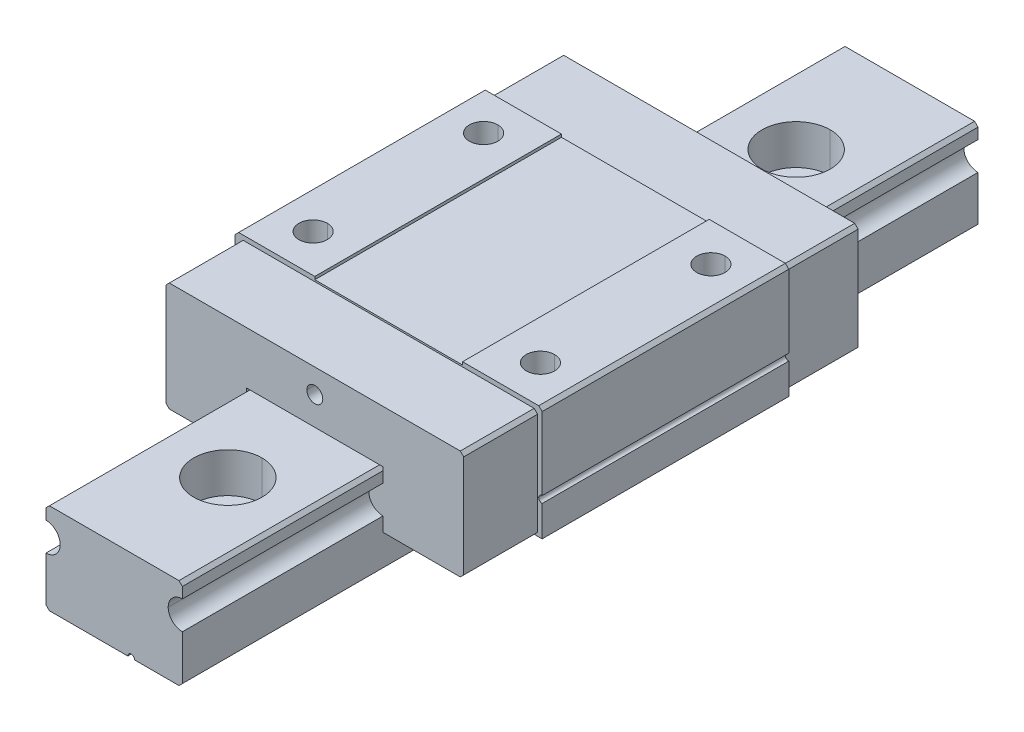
ISO-10303-21;
HEADER;
FILE_DESCRIPTION(('STEP AP214'),'2;1');
FILE_NAME('part.step','',(''),(''),'','','');
FILE_SCHEMA(('AUTOMOTIVE_DESIGN { 1 0 10303 214 1 1 1 1 }'));
ENDSEC;
DATA;
#1=APPLICATION_CONTEXT('core data for automotive mechanical design processes');
#2=APPLICATION_PROTOCOL_DEFINITION('international standard','automotive_design',2000,#1);
#3=PRODUCT_CONTEXT('',#1,'mechanical');
#4=PRODUCT('Part','Part','',(#3));
#5=PRODUCT_RELATED_PRODUCT_CATEGORY('part','',(#4));
#6=PRODUCT_DEFINITION_FORMATION('','',#4);
#7=PRODUCT_DEFINITION_CONTEXT('part definition',#1,'design');
#8=PRODUCT_DEFINITION('design','',#6,#7);
#9=PRODUCT_DEFINITION_SHAPE('','',#8);
#10=(LENGTH_UNIT() NAMED_UNIT(*) SI_UNIT(.MILLI.,.METRE.));
#11=(NAMED_UNIT(*) PLANE_ANGLE_UNIT() SI_UNIT($,.RADIAN.));
#12=(NAMED_UNIT(*) SI_UNIT($,.STERADIAN.) SOLID_ANGLE_UNIT());
#13=UNCERTAINTY_MEASURE_WITH_UNIT(LENGTH_MEASURE(1.E-05),#10,'distance_accuracy_value','');
#14=(GEOMETRIC_REPRESENTATION_CONTEXT(3) GLOBAL_UNCERTAINTY_ASSIGNED_CONTEXT((#13)) GLOBAL_UNIT_ASSIGNED_CONTEXT((#10,
#11,#12)) REPRESENTATION_CONTEXT('',''));
#15=CARTESIAN_POINT('',(0.,0.,0.));
#16=DIRECTION('',(0.,0.,1.));
#17=DIRECTION('',(1.,0.,0.));
#18=AXIS2_PLACEMENT_3D('',#15,#16,#17);
#19=CARTESIAN_POINT('',(-10.,13.,7.5));
#20=DIRECTION('',(0.,1.,0.));
#21=DIRECTION('',(0.,0.,1.));
#22=AXIS2_PLACEMENT_3D('',#19,#20,#21);
#23=CYLINDRICAL_SURFACE('',#22,1.25);
#24=CARTESIAN_POINT('',(-10.,9.5,7.5));
#25=DIRECTION('',(0.,1.,0.));
#26=DIRECTION('',(0.,0.,1.));
#27=AXIS2_PLACEMENT_3D('',#24,#25,#26);
#28=CIRCLE('',#27,1.25);
#29=CARTESIAN_POINT('',(-10.,9.5,6.25));
#30=VERTEX_POINT('',#29);
#31=CARTESIAN_POINT('',(-10.,9.5,8.75));
#32=VERTEX_POINT('',#31);
#33=EDGE_CURVE('P0_E10',#30,#32,#28,.T.);
#34=ORIENTED_EDGE('',*,*,#33,.F.);
#35=DIRECTION('',(0.,1.,0.));
#36=VECTOR('',#35,1.);
#37=CARTESIAN_POINT('',(-10.,13.,6.25));
#38=LINE('',#37,#36);
#39=CARTESIAN_POINT('',(-10.,13.,6.25));
#40=VERTEX_POINT('',#39);
#41=EDGE_CURVE('P0_E1148',#30,#40,#38,.T.);
#42=ORIENTED_EDGE('',*,*,#41,.T.);
#43=CARTESIAN_POINT('',(-10.,13.,7.5));
#44=DIRECTION('',(0.,1.,0.));
#45=DIRECTION('',(0.,0.,1.));
#46=AXIS2_PLACEMENT_3D('',#43,#44,#45);
#47=CIRCLE('',#46,1.25);
#48=CARTESIAN_POINT('',(-10.,13.,8.75));
#49=VERTEX_POINT('',#48);
#50=EDGE_CURVE('P0_E575',#40,#49,#47,.T.);
#51=ORIENTED_EDGE('',*,*,#50,.T.);
#52=DIRECTION('',(0.,1.,0.));
#53=VECTOR('',#52,1.);
#54=CARTESIAN_POINT('',(-10.,13.,8.75));
#55=LINE('',#54,#53);
#56=EDGE_CURVE('P0_E1088',#32,#49,#55,.T.);
#57=ORIENTED_EDGE('',*,*,#56,.F.);
#58=EDGE_LOOP('',(#34,#42,#51,#57));
#59=FACE_BOUND('',#58,.T.);
#60=ADVANCED_FACE('P0_F16',(#59),#23,.F.);
#61=CARTESIAN_POINT('',(-10.,9.5,7.5));
#62=DIRECTION('',(0.,1.,0.));
#63=DIRECTION('',(0.,0.,1.));
#64=AXIS2_PLACEMENT_3D('',#61,#62,#63);
#65=CONICAL_SURFACE('',#64,1.25,1.02974425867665);
#66=DIRECTION('',(0.,0.515038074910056,0.857167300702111));
#67=VECTOR('',#66,1.);
#68=CARTESIAN_POINT('',(-10.,9.5,8.75));
#69=LINE('',#68,#67);
#70=CARTESIAN_POINT('',(-10.,8.74892422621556,7.5));
#71=VERTEX_POINT('',#70);
#72=EDGE_CURVE('P0_E1106',#71,#32,#69,.T.);
#73=ORIENTED_EDGE('',*,*,#72,.F.);
#74=DIRECTION('',(0.,0.515038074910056,-0.857167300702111));
#75=VECTOR('',#74,1.);
#76=CARTESIAN_POINT('',(-10.,9.5,6.25));
#77=LINE('',#76,#75);
#78=EDGE_CURVE('P0_E1102',#71,#30,#77,.T.);
#79=ORIENTED_EDGE('',*,*,#78,.T.);
#80=ORIENTED_EDGE('',*,*,#33,.T.);
#81=EDGE_LOOP('',(#73,#79,#80));
#82=FACE_BOUND('',#81,.T.);
#83=ADVANCED_FACE('P0_F1184',(#82),#65,.F.);
#84=CARTESIAN_POINT('',(-10.,13.,-7.5));
#85=DIRECTION('',(0.,1.,0.));
#86=DIRECTION('',(0.,0.,1.));
#87=AXIS2_PLACEMENT_3D('',#84,#85,#86);
#88=CYLINDRICAL_SURFACE('',#87,1.25);
#89=CARTESIAN_POINT('',(-10.,9.5,-7.5));
#90=DIRECTION('',(0.,1.,0.));
#91=DIRECTION('',(0.,0.,1.));
#92=AXIS2_PLACEMENT_3D('',#89,#90,#91);
#93=CIRCLE('',#92,1.25);
#94=CARTESIAN_POINT('',(-10.,9.5,-8.75));
#95=VERTEX_POINT('',#94);
#96=CARTESIAN_POINT('',(-10.,9.5,-6.25));
#97=VERTEX_POINT('',#96);
#98=EDGE_CURVE('P0_E25',#95,#97,#93,.T.);
#99=ORIENTED_EDGE('',*,*,#98,.F.);
#100=DIRECTION('',(0.,1.,0.));
#101=VECTOR('',#100,1.);
#102=CARTESIAN_POINT('',(-10.,13.,-8.75));
#103=LINE('',#102,#101);
#104=CARTESIAN_POINT('',(-10.,13.,-8.75));
#105=VERTEX_POINT('',#104);
#106=EDGE_CURVE('P0_E1096',#95,#105,#103,.T.);
#107=ORIENTED_EDGE('',*,*,#106,.T.);
#108=CARTESIAN_POINT('',(-10.,13.,-7.5));
#109=DIRECTION('',(0.,1.,0.));
#110=DIRECTION('',(0.,0.,1.));
#111=AXIS2_PLACEMENT_3D('',#108,#109,#110);
#112=CIRCLE('',#111,1.25);
#113=CARTESIAN_POINT('',(-10.,13.,-6.25));
#114=VERTEX_POINT('',#113);
#115=EDGE_CURVE('P0_E571',#105,#114,#112,.T.);
#116=ORIENTED_EDGE('',*,*,#115,.T.);
#117=DIRECTION('',(0.,1.,0.));
#118=VECTOR('',#117,1.);
#119=CARTESIAN_POINT('',(-10.,13.,-6.25));
#120=LINE('',#119,#118);
#121=EDGE_CURVE('P0_E1037',#97,#114,#120,.T.);
#122=ORIENTED_EDGE('',*,*,#121,.F.);
#123=EDGE_LOOP('',(#99,#107,#116,#122));
#124=FACE_BOUND('',#123,.T.);
#125=ADVANCED_FACE('P0_F1188',(#124),#88,.F.);
#126=CARTESIAN_POINT('',(-10.,9.5,-7.5));
#127=DIRECTION('',(0.,1.,0.));
#128=DIRECTION('',(0.,0.,1.));
#129=AXIS2_PLACEMENT_3D('',#126,#127,#128);
#130=CONICAL_SURFACE('',#129,1.25,1.02974425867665);
#131=DIRECTION('',(0.,0.515038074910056,0.857167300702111));
#132=VECTOR('',#131,1.);
#133=CARTESIAN_POINT('',(-10.,9.5,-6.25));
#134=LINE('',#133,#132);
#135=CARTESIAN_POINT('',(-10.,8.74892422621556,-7.5));
#136=VERTEX_POINT('',#135);
#137=EDGE_CURVE('P0_E987',#136,#97,#134,.T.);
#138=ORIENTED_EDGE('',*,*,#137,.F.);
#139=DIRECTION('',(0.,0.515038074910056,-0.857167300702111));
#140=VECTOR('',#139,1.);
#141=CARTESIAN_POINT('',(-10.,9.5,-8.75));
#142=LINE('',#141,#140);
#143=EDGE_CURVE('P0_E984',#136,#95,#142,.T.);
#144=ORIENTED_EDGE('',*,*,#143,.T.);
#145=ORIENTED_EDGE('',*,*,#98,.T.);
#146=EDGE_LOOP('',(#138,#144,#145));
#147=FACE_BOUND('',#146,.T.);
#148=ADVANCED_FACE('P0_F1193',(#147),#130,.F.);
#149=CARTESIAN_POINT('',(10.,13.,-7.5));
#150=DIRECTION('',(0.,1.,0.));
#151=DIRECTION('',(0.,0.,1.));
#152=AXIS2_PLACEMENT_3D('',#149,#150,#151);
#153=CYLINDRICAL_SURFACE('',#152,1.25);
#154=CARTESIAN_POINT('',(10.,9.5,-7.5));
#155=DIRECTION('',(0.,1.,0.));
#156=DIRECTION('',(0.,0.,1.));
#157=AXIS2_PLACEMENT_3D('',#154,#155,#156);
#158=CIRCLE('',#157,1.25);
#159=CARTESIAN_POINT('',(10.,9.5,-8.75));
#160=VERTEX_POINT('',#159);
#161=CARTESIAN_POINT('',(10.,9.5,-6.25));
#162=VERTEX_POINT('',#161);
#163=EDGE_CURVE('P0_E875',#160,#162,#158,.T.);
#164=ORIENTED_EDGE('',*,*,#163,.F.);
#165=DIRECTION('',(0.,1.,0.));
#166=VECTOR('',#165,1.);
#167=CARTESIAN_POINT('',(10.,13.,-8.75));
#168=LINE('',#167,#166);
#169=CARTESIAN_POINT('',(10.,13.,-8.75));
#170=VERTEX_POINT('',#169);
#171=EDGE_CURVE('P0_E993',#160,#170,#168,.T.);
#172=ORIENTED_EDGE('',*,*,#171,.T.);
#173=CARTESIAN_POINT('',(10.,13.,-7.5));
#174=DIRECTION('',(0.,1.,0.));
#175=DIRECTION('',(0.,0.,1.));
#176=AXIS2_PLACEMENT_3D('',#173,#174,#175);
#177=CIRCLE('',#176,1.25);
#178=CARTESIAN_POINT('',(10.,13.,-6.25));
#179=VERTEX_POINT('',#178);
#180=EDGE_CURVE('P0_E602',#170,#179,#177,.T.);
#181=ORIENTED_EDGE('',*,*,#180,.T.);
#182=DIRECTION('',(0.,1.,0.));
#183=VECTOR('',#182,1.);
#184=CARTESIAN_POINT('',(10.,13.,-6.25));
#185=LINE('',#184,#183);
#186=EDGE_CURVE('P0_E992',#162,#179,#185,.T.);
#187=ORIENTED_EDGE('',*,*,#186,.F.);
#188=EDGE_LOOP('',(#164,#172,#181,#187));
#189=FACE_BOUND('',#188,.T.);
#190=ADVANCED_FACE('P0_F1308',(#189),#153,.F.);
#191=CARTESIAN_POINT('',(10.,9.5,-7.5));
#192=DIRECTION('',(0.,1.,0.));
#193=DIRECTION('',(0.,0.,1.));
#194=AXIS2_PLACEMENT_3D('',#191,#192,#193);
#195=CONICAL_SURFACE('',#194,1.25,1.02974425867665);
#196=DIRECTION('',(0.,0.515038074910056,0.857167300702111));
#197=VECTOR('',#196,1.);
#198=CARTESIAN_POINT('',(10.,9.5,-6.25));
#199=LINE('',#198,#197);
#200=CARTESIAN_POINT('',(10.,8.74892422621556,-7.5));
#201=VERTEX_POINT('',#200);
#202=EDGE_CURVE('P0_E997',#201,#162,#199,.T.);
#203=ORIENTED_EDGE('',*,*,#202,.F.);
#204=DIRECTION('',(0.,0.515038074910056,-0.857167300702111));
#205=VECTOR('',#204,1.);
#206=CARTESIAN_POINT('',(10.,9.5,-8.75));
#207=LINE('',#206,#205);
#208=EDGE_CURVE('P0_E994',#201,#160,#207,.T.);
#209=ORIENTED_EDGE('',*,*,#208,.T.);
#210=ORIENTED_EDGE('',*,*,#163,.T.);
#211=EDGE_LOOP('',(#203,#209,#210));
#212=FACE_BOUND('',#211,.T.);
#213=ADVANCED_FACE('P0_F1304',(#212),#195,.F.);
#214=CARTESIAN_POINT('',(10.,13.,7.5));
#215=DIRECTION('',(0.,1.,0.));
#216=DIRECTION('',(0.,0.,1.));
#217=AXIS2_PLACEMENT_3D('',#214,#215,#216);
#218=CYLINDRICAL_SURFACE('',#217,1.25);
#219=CARTESIAN_POINT('',(10.,9.5,7.5));
#220=DIRECTION('',(0.,1.,0.));
#221=DIRECTION('',(0.,0.,1.));
#222=AXIS2_PLACEMENT_3D('',#219,#220,#221);
#223=CIRCLE('',#222,1.25);
#224=CARTESIAN_POINT('',(10.,9.5,6.25));
#225=VERTEX_POINT('',#224);
#226=CARTESIAN_POINT('',(10.,9.5,8.75));
#227=VERTEX_POINT('',#226);
#228=EDGE_CURVE('P0_E873',#225,#227,#223,.T.);
#229=ORIENTED_EDGE('',*,*,#228,.F.);
#230=DIRECTION('',(0.,1.,0.));
#231=VECTOR('',#230,1.);
#232=CARTESIAN_POINT('',(10.,13.,6.25));
#233=LINE('',#232,#231);
#234=CARTESIAN_POINT('',(10.,13.,6.25));
#235=VERTEX_POINT('',#234);
#236=EDGE_CURVE('P0_E901',#225,#235,#233,.T.);
#237=ORIENTED_EDGE('',*,*,#236,.T.);
#238=CARTESIAN_POINT('',(10.,13.,7.5));
#239=DIRECTION('',(0.,1.,0.));
#240=DIRECTION('',(0.,0.,1.));
#241=AXIS2_PLACEMENT_3D('',#238,#239,#240);
#242=CIRCLE('',#241,1.25);
#243=CARTESIAN_POINT('',(10.,13.,8.75));
#244=VERTEX_POINT('',#243);
#245=EDGE_CURVE('P0_E593',#235,#244,#242,.T.);
#246=ORIENTED_EDGE('',*,*,#245,.T.);
#247=DIRECTION('',(0.,1.,0.));
#248=VECTOR('',#247,1.);
#249=CARTESIAN_POINT('',(10.,13.,8.75));
#250=LINE('',#249,#248);
#251=EDGE_CURVE('P0_E900',#227,#244,#250,.T.);
#252=ORIENTED_EDGE('',*,*,#251,.F.);
#253=EDGE_LOOP('',(#229,#237,#246,#252));
#254=FACE_BOUND('',#253,.T.);
#255=ADVANCED_FACE('P0_F1300',(#254),#218,.F.);
#256=CARTESIAN_POINT('',(10.,9.5,7.5));
#257=DIRECTION('',(0.,1.,0.));
#258=DIRECTION('',(0.,0.,1.));
#259=AXIS2_PLACEMENT_3D('',#256,#257,#258);
#260=CONICAL_SURFACE('',#259,1.25,1.02974425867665);
#261=DIRECTION('',(0.,0.515038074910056,0.857167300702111));
#262=VECTOR('',#261,1.);
#263=CARTESIAN_POINT('',(10.,9.5,8.75));
#264=LINE('',#263,#262);
#265=CARTESIAN_POINT('',(10.,8.74892422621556,7.5));
#266=VERTEX_POINT('',#265);
#267=EDGE_CURVE('P0_E916',#266,#227,#264,.T.);
#268=ORIENTED_EDGE('',*,*,#267,.F.);
#269=DIRECTION('',(0.,0.515038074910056,-0.857167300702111));
#270=VECTOR('',#269,1.);
#271=CARTESIAN_POINT('',(10.,9.5,6.25));
#272=LINE('',#271,#270);
#273=EDGE_CURVE('P0_E912',#266,#225,#272,.T.);
#274=ORIENTED_EDGE('',*,*,#273,.T.);
#275=ORIENTED_EDGE('',*,*,#228,.T.);
#276=EDGE_LOOP('',(#268,#274,#275));
#277=FACE_BOUND('',#276,.T.);
#278=ADVANCED_FACE('P0_F1274',(#277),#260,.F.);
#279=CARTESIAN_POINT('',(6.,5.5,35.));
#280=DIRECTION('',(0.,0.,-1.));
#281=DIRECTION('',(-1.,0.,0.));
#282=AXIS2_PLACEMENT_3D('',#279,#280,#281);
#283=CYLINDRICAL_SURFACE('',#282,1.25);
#284=CARTESIAN_POINT('',(6.,5.5,17.35));
#285=DIRECTION('',(0.,0.,1.));
#286=DIRECTION('',(-1.,0.,0.));
#287=AXIS2_PLACEMENT_3D('',#284,#285,#286);
#288=CIRCLE('',#287,1.25);
#289=CARTESIAN_POINT('',(4.75,5.5,17.35));
#290=VERTEX_POINT('',#289);
#291=CARTESIAN_POINT('',(6.,4.25,17.35));
#292=VERTEX_POINT('',#291);
#293=EDGE_CURVE('P0_E845',#290,#292,#288,.T.);
#294=ORIENTED_EDGE('',*,*,#293,.F.);
#295=DIRECTION('',(0.,0.,-1.));
#296=VECTOR('',#295,1.);
#297=CARTESIAN_POINT('',(4.75,5.5,35.));
#298=LINE('',#297,#296);
#299=CARTESIAN_POINT('',(4.75,5.5,-17.35));
#300=VERTEX_POINT('',#299);
#301=EDGE_CURVE('P0_E830',#290,#300,#298,.T.);
#302=ORIENTED_EDGE('',*,*,#301,.T.);
#303=CARTESIAN_POINT('',(6.,5.5,-17.35));
#304=DIRECTION('',(0.,0.,1.));
#305=DIRECTION('',(-1.,0.,0.));
#306=AXIS2_PLACEMENT_3D('',#303,#304,#305);
#307=CIRCLE('',#306,1.25);
#308=CARTESIAN_POINT('',(6.,4.25,-17.35));
#309=VERTEX_POINT('',#308);
#310=EDGE_CURVE('P0_E458',#300,#309,#307,.T.);
#311=ORIENTED_EDGE('',*,*,#310,.T.);
#312=DIRECTION('',(0.,0.,1.));
#313=VECTOR('',#312,1.);
#314=CARTESIAN_POINT('',(6.,4.25,35.));
#315=LINE('',#314,#313);
#316=EDGE_CURVE('P0_E492',#309,#292,#315,.T.);
#317=ORIENTED_EDGE('',*,*,#316,.T.);
#318=EDGE_LOOP('',(#294,#302,#311,#317));
#319=FACE_BOUND('',#318,.T.);
#320=ADVANCED_FACE('P0_F1270',(#319),#283,.T.);
#321=CARTESIAN_POINT('',(0.,10.5,-17.35));
#322=DIRECTION('',(0.,0.,1.));
#323=DIRECTION('',(1.,0.,0.));
#324=AXIS2_PLACEMENT_3D('',#321,#322,#323);
#325=CYLINDRICAL_SURFACE('',#324,0.7);
#326=CARTESIAN_POINT('',(0.,10.5,-17.35));
#327=DIRECTION('',(0.,0.,-1.));
#328=DIRECTION('',(1.,0.,0.));
#329=AXIS2_PLACEMENT_3D('',#326,#327,#328);
#330=CIRCLE('',#329,0.7);
#331=CARTESIAN_POINT('',(0.7,10.5,-17.35));
#332=VERTEX_POINT('',#331);
#333=CARTESIAN_POINT('',(-0.7,10.5,-17.35));
#334=VERTEX_POINT('',#333);
#335=EDGE_CURVE('P0_E125',#332,#334,#330,.T.);
#336=ORIENTED_EDGE('',*,*,#335,.T.);
#337=DIRECTION('',(0.,0.,1.));
#338=VECTOR('',#337,1.);
#339=CARTESIAN_POINT('',(-0.7,10.5,-17.35));
#340=LINE('',#339,#338);
#341=CARTESIAN_POINT('',(-0.7,10.5,-12.35));
#342=VERTEX_POINT('',#341);
#343=EDGE_CURVE('P0_E745',#334,#342,#340,.T.);
#344=ORIENTED_EDGE('',*,*,#343,.T.);
#345=CARTESIAN_POINT('',(0.,10.5,-12.35));
#346=DIRECTION('',(0.,0.,-1.));
#347=DIRECTION('',(1.,0.,0.));
#348=AXIS2_PLACEMENT_3D('',#345,#346,#347);
#349=CIRCLE('',#348,0.7);
#350=CARTESIAN_POINT('',(0.,9.79999999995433,-12.35));
#351=VERTEX_POINT('',#350);
#352=EDGE_CURVE('P0_E141',#351,#342,#349,.T.);
#353=ORIENTED_EDGE('',*,*,#352,.F.);
#354=CARTESIAN_POINT('',(0.,10.5,-12.35));
#355=DIRECTION('',(0.,0.,-1.));
#356=DIRECTION('',(1.,0.,0.));
#357=AXIS2_PLACEMENT_3D('',#354,#355,#356);
#358=CIRCLE('',#357,0.7);
#359=CARTESIAN_POINT('',(0.7,10.5,-12.35));
#360=VERTEX_POINT('',#359);
#361=EDGE_CURVE('P0_E772',#360,#351,#358,.T.);
#362=ORIENTED_EDGE('',*,*,#361,.F.);
#363=DIRECTION('',(0.,0.,1.));
#364=VECTOR('',#363,1.);
#365=CARTESIAN_POINT('',(0.7,10.5,-17.35));
#366=LINE('',#365,#364);
#367=EDGE_CURVE('P0_E744',#332,#360,#366,.T.);
#368=ORIENTED_EDGE('',*,*,#367,.F.);
#369=EDGE_LOOP('',(#336,#344,#353,#362,#368));
#370=FACE_BOUND('',#369,.T.);
#371=ADVANCED_FACE('P0_F1273',(#370),#325,.F.);
#372=CARTESIAN_POINT('',(0.,10.5,17.35));
#373=DIRECTION('',(0.,0.,-1.));
#374=DIRECTION('',(-1.,0.,0.));
#375=AXIS2_PLACEMENT_3D('',#372,#373,#374);
#376=CYLINDRICAL_SURFACE('',#375,0.7);
#377=CARTESIAN_POINT('',(0.,10.5,17.35));
#378=DIRECTION('',(0.,0.,-1.));
#379=DIRECTION('',(-1.,0.,0.));
#380=AXIS2_PLACEMENT_3D('',#377,#378,#379);
#381=CIRCLE('',#380,0.7);
#382=CARTESIAN_POINT('',(0.7,10.5,17.35));
#383=VERTEX_POINT('',#382);
#384=CARTESIAN_POINT('',(-0.7,10.5,17.35));
#385=VERTEX_POINT('',#384);
#386=EDGE_CURVE('P0_E708',#383,#385,#381,.T.);
#387=ORIENTED_EDGE('',*,*,#386,.F.);
#388=DIRECTION('',(0.,0.,-1.));
#389=VECTOR('',#388,1.);
#390=CARTESIAN_POINT('',(0.7,10.5,17.35));
#391=LINE('',#390,#389);
#392=CARTESIAN_POINT('',(0.70000000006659,10.5,12.35));
#393=VERTEX_POINT('',#392);
#394=EDGE_CURVE('P0_E776',#383,#393,#391,.T.);
#395=ORIENTED_EDGE('',*,*,#394,.T.);
#396=CARTESIAN_POINT('',(0.,10.5,12.35));
#397=DIRECTION('',(0.,0.,1.));
#398=DIRECTION('',(-1.,0.,0.));
#399=AXIS2_PLACEMENT_3D('',#396,#397,#398);
#400=CIRCLE('',#399,0.7);
#401=CARTESIAN_POINT('',(-0.700000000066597,10.5,12.35));
#402=VERTEX_POINT('',#401);
#403=EDGE_CURVE('P0_E868',#402,#393,#400,.T.);
#404=ORIENTED_EDGE('',*,*,#403,.F.);
#405=DIRECTION('',(0.,0.,-1.));
#406=VECTOR('',#405,1.);
#407=CARTESIAN_POINT('',(-0.7,10.5,17.35));
#408=LINE('',#407,#406);
#409=EDGE_CURVE('P0_E784',#385,#402,#408,.T.);
#410=ORIENTED_EDGE('',*,*,#409,.F.);
#411=EDGE_LOOP('',(#387,#395,#404,#410));
#412=FACE_BOUND('',#411,.T.);
#413=ADVANCED_FACE('P0_F1282',(#412),#376,.F.);
#414=CARTESIAN_POINT('',(0.,10.5,-12.3499999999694));
#415=DIRECTION('',(0.,0.,-1.));
#416=DIRECTION('',(0.,1.,0.));
#417=AXIS2_PLACEMENT_3D('',#414,#415,#416);
#418=CONICAL_SURFACE('',#417,0.699999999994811,1.02974425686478);
#419=DIRECTION('',(0.,0.857167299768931,-0.515038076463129));
#420=VECTOR('',#419,1.);
#421=CARTESIAN_POINT('',(0.,11.1999999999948,-12.3499999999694));
#422=LINE('',#421,#420);
#423=CARTESIAN_POINT('',(0.,10.5,-11.9293975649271));
#424=VERTEX_POINT('',#423);
#425=CARTESIAN_POINT('',(0.,11.2000000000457,-12.35));
#426=VERTEX_POINT('',#425);
#427=EDGE_CURVE('P0_E767',#424,#426,#422,.T.);
#428=ORIENTED_EDGE('',*,*,#427,.F.);
#429=DIRECTION('',(0.,-0.85716729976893,-0.515038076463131));
#430=VECTOR('',#429,1.);
#431=CARTESIAN_POINT('',(0.,9.80000000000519,-12.3499999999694));
#432=LINE('',#431,#430);
#433=EDGE_CURVE('P0_E764',#424,#351,#432,.T.);
#434=ORIENTED_EDGE('',*,*,#433,.T.);
#435=ORIENTED_EDGE('',*,*,#352,.T.);
#436=CARTESIAN_POINT('',(0.,10.5,-12.35));
#437=DIRECTION('',(0.,0.,-1.));
#438=DIRECTION('',(1.,0.,0.));
#439=AXIS2_PLACEMENT_3D('',#436,#437,#438);
#440=CIRCLE('',#439,0.7);
#441=EDGE_CURVE('P0_E827',#342,#426,#440,.T.);
#442=ORIENTED_EDGE('',*,*,#441,.T.);
#443=EDGE_LOOP('',(#428,#434,#435,#442));
#444=FACE_BOUND('',#443,.T.);
#445=ADVANCED_FACE('P0_F1285',(#444),#418,.F.);
#446=CARTESIAN_POINT('',(0.,10.5,12.3499999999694));
#447=DIRECTION('',(0.,0.,1.));
#448=DIRECTION('',(1.,0.,0.));
#449=AXIS2_PLACEMENT_3D('',#446,#447,#448);
#450=CONICAL_SURFACE('',#449,0.700000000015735,1.02974425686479);
#451=DIRECTION('',(0.857167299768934,0.,0.515038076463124));
#452=VECTOR('',#451,1.);
#453=CARTESIAN_POINT('',(0.700000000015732,10.5,12.3499999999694));
#454=LINE('',#453,#452);
#455=CARTESIAN_POINT('',(0.,10.5,11.9293975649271));
#456=VERTEX_POINT('',#455);
#457=EDGE_CURVE('P0_E517',#456,#393,#454,.T.);
#458=ORIENTED_EDGE('',*,*,#457,.F.);
#459=DIRECTION('',(-0.857167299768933,0.,0.515038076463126));
#460=VECTOR('',#459,1.);
#461=CARTESIAN_POINT('',(-0.700000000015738,10.5,12.3499999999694));
#462=LINE('',#461,#460);
#463=EDGE_CURVE('P0_E522',#456,#402,#462,.T.);
#464=ORIENTED_EDGE('',*,*,#463,.T.);
#465=ORIENTED_EDGE('',*,*,#403,.T.);
#466=EDGE_LOOP('',(#458,#464,#465));
#467=FACE_BOUND('',#466,.T.);
#468=ADVANCED_FACE('P0_F1292',(#467),#450,.F.);
#469=CARTESIAN_POINT('',(13.5,6.,17.35));
#470=DIRECTION('',(0.,0.,-1.));
#471=DIRECTION('',(-1.,0.,0.));
#472=AXIS2_PLACEMENT_3D('',#469,#470,#471);
#473=CYLINDRICAL_SURFACE('',#472,0.3);
#474=CARTESIAN_POINT('',(13.5,6.,10.85));
#475=DIRECTION('',(0.,0.,-1.));
#476=DIRECTION('',(-1.,0.,0.));
#477=AXIS2_PLACEMENT_3D('',#474,#475,#476);
#478=CIRCLE('',#477,0.3);
#479=CARTESIAN_POINT('',(13.2,6.,10.85));
#480=VERTEX_POINT('',#479);
#481=CARTESIAN_POINT('',(13.5,6.3,10.85));
#482=VERTEX_POINT('',#481);
#483=EDGE_CURVE('P0_E680',#480,#482,#478,.T.);
#484=ORIENTED_EDGE('',*,*,#483,.F.);
#485=DIRECTION('',(0.,0.,-1.));
#486=VECTOR('',#485,1.);
#487=CARTESIAN_POINT('',(13.2,6.,17.35));
#488=LINE('',#487,#486);
#489=CARTESIAN_POINT('',(13.2,6.,-10.85));
#490=VERTEX_POINT('',#489);
#491=EDGE_CURVE('P0_E510',#480,#490,#488,.T.);
#492=ORIENTED_EDGE('',*,*,#491,.T.);
#493=CARTESIAN_POINT('',(13.5,6.,-10.85));
#494=DIRECTION('',(0.,0.,1.));
#495=DIRECTION('',(-1.,0.,0.));
#496=AXIS2_PLACEMENT_3D('',#493,#494,#495);
#497=CIRCLE('',#496,0.3);
#498=CARTESIAN_POINT('',(13.5,6.3,-10.85));
#499=VERTEX_POINT('',#498);
#500=EDGE_CURVE('P0_E599',#499,#490,#497,.T.);
#501=ORIENTED_EDGE('',*,*,#500,.F.);
#502=DIRECTION('',(0.,0.,-1.));
#503=VECTOR('',#502,1.);
#504=CARTESIAN_POINT('',(13.5,6.3,17.35));
#505=LINE('',#504,#503);
#506=EDGE_CURVE('P0_E606',#482,#499,#505,.T.);
#507=ORIENTED_EDGE('',*,*,#506,.F.);
#508=EDGE_LOOP('',(#484,#492,#501,#507));
#509=FACE_BOUND('',#508,.T.);
#510=ADVANCED_FACE('P0_F1025',(#509),#473,.F.);
#511=CARTESIAN_POINT('',(6.,8.,35.));
#512=DIRECTION('',(0.,-1.,0.));
#513=DIRECTION('',(0.,0.,-1.));
#514=AXIS2_PLACEMENT_3D('',#511,#512,#513);
#515=PLANE('',#514);
#516=DIRECTION('',(1.,0.,0.));
#517=VECTOR('',#516,1.);
#518=CARTESIAN_POINT('',(6.,8.,-17.35));
#519=LINE('',#518,#517);
#520=CARTESIAN_POINT('',(-6.,8.,-17.35));
#521=VERTEX_POINT('',#520);
#522=CARTESIAN_POINT('',(6.,8.,-17.35));
#523=VERTEX_POINT('',#522);
#524=EDGE_CURVE('P0_E863',#521,#523,#519,.T.);
#525=ORIENTED_EDGE('',*,*,#524,.T.);
#526=DIRECTION('',(0.,0.,1.));
#527=VECTOR('',#526,1.);
#528=CARTESIAN_POINT('',(6.,8.,35.));
#529=LINE('',#528,#527);
#530=CARTESIAN_POINT('',(6.,8.,17.35));
#531=VERTEX_POINT('',#530);
#532=EDGE_CURVE('P0_E39',#523,#531,#529,.T.);
#533=ORIENTED_EDGE('',*,*,#532,.T.);
#534=DIRECTION('',(-1.,0.,0.));
#535=VECTOR('',#534,1.);
#536=CARTESIAN_POINT('',(6.,8.,17.35));
#537=LINE('',#536,#535);
#538=CARTESIAN_POINT('',(-6.,8.,17.35));
#539=VERTEX_POINT('',#538);
#540=EDGE_CURVE('P0_E849',#531,#539,#537,.T.);
#541=ORIENTED_EDGE('',*,*,#540,.T.);
#542=DIRECTION('',(0.,0.,-1.));
#543=VECTOR('',#542,1.);
#544=CARTESIAN_POINT('',(-6.,8.,35.));
#545=LINE('',#544,#543);
#546=EDGE_CURVE('P0_E557',#539,#521,#545,.T.);
#547=ORIENTED_EDGE('',*,*,#546,.T.);
#548=EDGE_LOOP('',(#525,#533,#541,#547));
#549=FACE_BOUND('',#548,.T.);
#550=ADVANCED_FACE('P0_F1281',(#549),#515,.T.);
#551=CARTESIAN_POINT('',(6.,6.75,35.));
#552=DIRECTION('',(-1.,0.,0.));
#553=DIRECTION('',(0.,0.,1.));
#554=AXIS2_PLACEMENT_3D('',#551,#552,#553);
#555=PLANE('',#554);
#556=DIRECTION('',(0.,-1.,0.));
#557=VECTOR('',#556,1.);
#558=CARTESIAN_POINT('',(6.,6.75,-17.35));
#559=LINE('',#558,#557);
#560=CARTESIAN_POINT('',(6.,6.75,-17.35));
#561=VERTEX_POINT('',#560);
#562=EDGE_CURVE('P0_E556',#523,#561,#559,.T.);
#563=ORIENTED_EDGE('',*,*,#562,.T.);
#564=DIRECTION('',(0.,0.,1.));
#565=VECTOR('',#564,1.);
#566=CARTESIAN_POINT('',(6.,6.75,35.));
#567=LINE('',#566,#565);
#568=CARTESIAN_POINT('',(6.,6.75,17.35));
#569=VERTEX_POINT('',#568);
#570=EDGE_CURVE('P0_E837',#561,#569,#567,.T.);
#571=ORIENTED_EDGE('',*,*,#570,.T.);
#572=DIRECTION('',(0.,1.,0.));
#573=VECTOR('',#572,1.);
#574=CARTESIAN_POINT('',(6.,6.75,17.35));
#575=LINE('',#574,#573);
#576=EDGE_CURVE('P0_E853',#569,#531,#575,.T.);
#577=ORIENTED_EDGE('',*,*,#576,.T.);
#578=ORIENTED_EDGE('',*,*,#532,.F.);
#579=EDGE_LOOP('',(#563,#571,#577,#578));
#580=FACE_BOUND('',#579,.T.);
#581=ADVANCED_FACE('P0_F1278',(#580),#555,.T.);
#582=CARTESIAN_POINT('',(13.5,6.,-17.35));
#583=DIRECTION('',(0.,0.,1.));
#584=DIRECTION('',(1.,0.,0.));
#585=AXIS2_PLACEMENT_3D('',#582,#583,#584);
#586=PLANE('',#585);
#587=ORIENTED_EDGE('',*,*,#335,.F.);
#588=CARTESIAN_POINT('',(0.,10.5,-17.35));
#589=DIRECTION('',(0.,0.,-1.));
#590=DIRECTION('',(1.,0.,0.));
#591=AXIS2_PLACEMENT_3D('',#588,#589,#590);
#592=CIRCLE('',#591,0.7);
#593=EDGE_CURVE('P0_E740',#334,#332,#592,.T.);
#594=ORIENTED_EDGE('',*,*,#593,.F.);
#595=EDGE_LOOP('',(#587,#594));
#596=FACE_BOUND('',#595,.T.);
#597=DIRECTION('',(-1.,0.,0.));
#598=VECTOR('',#597,1.);
#599=CARTESIAN_POINT('',(13.5,12.6,-17.35));
#600=LINE('',#599,#598);
#601=CARTESIAN_POINT('',(12.8,12.6,-17.35));
#602=VERTEX_POINT('',#601);
#603=CARTESIAN_POINT('',(-12.8,12.6,-17.35));
#604=VERTEX_POINT('',#603);
#605=EDGE_CURVE('P0_E819',#602,#604,#600,.T.);
#606=ORIENTED_EDGE('',*,*,#605,.F.);
#607=DIRECTION('',(0.707106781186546,-0.70710678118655,0.));
#608=VECTOR('',#607,1.);
#609=CARTESIAN_POINT('',(13.1,12.3,-17.35));
#610=LINE('',#609,#608);
#611=CARTESIAN_POINT('',(13.1,12.3,-17.35));
#612=VERTEX_POINT('',#611);
#613=EDGE_CURVE('P0_E594',#602,#612,#610,.T.);
#614=ORIENTED_EDGE('',*,*,#613,.T.);
#615=DIRECTION('',(0.,1.,0.));
#616=VECTOR('',#615,1.);
#617=CARTESIAN_POINT('',(13.1,6.,-17.35));
#618=LINE('',#617,#616);
#619=CARTESIAN_POINT('',(13.1,3.3,-17.35));
#620=VERTEX_POINT('',#619);
#621=EDGE_CURVE('P0_E477',#620,#612,#618,.T.);
#622=ORIENTED_EDGE('',*,*,#621,.F.);
#623=DIRECTION('',(-0.707106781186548,-0.707106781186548,0.));
#624=VECTOR('',#623,1.);
#625=CARTESIAN_POINT('',(12.8,3.,-17.35));
#626=LINE('',#625,#624);
#627=CARTESIAN_POINT('',(12.8,3.,-17.35));
#628=VERTEX_POINT('',#627);
#629=EDGE_CURVE('P0_E472',#620,#628,#626,.T.);
#630=ORIENTED_EDGE('',*,*,#629,.T.);
#631=DIRECTION('',(1.,0.,0.));
#632=VECTOR('',#631,1.);
#633=CARTESIAN_POINT('',(13.5,3.,-17.35));
#634=LINE('',#633,#632);
#635=CARTESIAN_POINT('',(6.,3.,-17.35));
#636=VERTEX_POINT('',#635);
#637=EDGE_CURVE('P0_E466',#636,#628,#634,.T.);
#638=ORIENTED_EDGE('',*,*,#637,.F.);
#639=DIRECTION('',(0.,-1.,0.));
#640=VECTOR('',#639,1.);
#641=CARTESIAN_POINT('',(6.,0.,-17.35));
#642=LINE('',#641,#640);
#643=EDGE_CURVE('P0_E470',#309,#636,#642,.T.);
#644=ORIENTED_EDGE('',*,*,#643,.F.);
#645=ORIENTED_EDGE('',*,*,#310,.F.);
#646=CARTESIAN_POINT('',(6.,5.5,-17.35));
#647=DIRECTION('',(0.,0.,1.));
#648=DIRECTION('',(-1.,0.,0.));
#649=AXIS2_PLACEMENT_3D('',#646,#647,#648);
#650=CIRCLE('',#649,1.25);
#651=EDGE_CURVE('P0_E841',#561,#300,#650,.T.);
#652=ORIENTED_EDGE('',*,*,#651,.F.);
#653=ORIENTED_EDGE('',*,*,#562,.F.);
#654=ORIENTED_EDGE('',*,*,#524,.F.);
#655=DIRECTION('',(0.,1.,0.));
#656=VECTOR('',#655,1.);
#657=CARTESIAN_POINT('',(-6.,6.,-17.35));
#658=LINE('',#657,#656);
#659=CARTESIAN_POINT('',(-6.,6.75,-17.35));
#660=VERTEX_POINT('',#659);
#661=EDGE_CURVE('P0_E704',#660,#521,#658,.T.);
#662=ORIENTED_EDGE('',*,*,#661,.F.);
#663=CARTESIAN_POINT('',(-6.,5.5,-17.35));
#664=DIRECTION('',(0.,0.,1.));
#665=DIRECTION('',(-1.,0.,0.));
#666=AXIS2_PLACEMENT_3D('',#663,#664,#665);
#667=CIRCLE('',#666,1.25);
#668=CARTESIAN_POINT('',(-6.,4.25,-17.35));
#669=VERTEX_POINT('',#668);
#670=EDGE_CURVE('P0_E806',#669,#660,#667,.T.);
#671=ORIENTED_EDGE('',*,*,#670,.F.);
#672=DIRECTION('',(0.,1.,0.));
#673=VECTOR('',#672,1.);
#674=CARTESIAN_POINT('',(-6.,4.25,-17.35));
#675=LINE('',#674,#673);
#676=CARTESIAN_POINT('',(-6.,3.,-17.35));
#677=VERTEX_POINT('',#676);
#678=EDGE_CURVE('P0_E626',#677,#669,#675,.T.);
#679=ORIENTED_EDGE('',*,*,#678,.F.);
#680=DIRECTION('',(1.,0.,0.));
#681=VECTOR('',#680,1.);
#682=CARTESIAN_POINT('',(13.5,3.,-17.35));
#683=LINE('',#682,#681);
#684=CARTESIAN_POINT('',(-12.8,3.,-17.35));
#685=VERTEX_POINT('',#684);
#686=EDGE_CURVE('P0_E800',#685,#677,#683,.T.);
#687=ORIENTED_EDGE('',*,*,#686,.F.);
#688=DIRECTION('',(-0.707106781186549,0.707106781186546,0.));
#689=VECTOR('',#688,1.);
#690=CARTESIAN_POINT('',(-13.1,3.3,-17.35));
#691=LINE('',#690,#689);
#692=CARTESIAN_POINT('',(-13.1,3.3,-17.35));
#693=VERTEX_POINT('',#692);
#694=EDGE_CURVE('P0_E655',#685,#693,#691,.T.);
#695=ORIENTED_EDGE('',*,*,#694,.T.);
#696=DIRECTION('',(0.,-1.,0.));
#697=VECTOR('',#696,1.);
#698=CARTESIAN_POINT('',(-13.1,6.,-17.35));
#699=LINE('',#698,#697);
#700=CARTESIAN_POINT('',(-13.1,12.3,-17.35));
#701=VERTEX_POINT('',#700);
#702=EDGE_CURVE('P0_E797',#701,#693,#699,.T.);
#703=ORIENTED_EDGE('',*,*,#702,.F.);
#704=DIRECTION('',(0.707106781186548,0.707106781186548,0.));
#705=VECTOR('',#704,1.);
#706=CARTESIAN_POINT('',(-12.8,12.6,-17.35));
#707=LINE('',#706,#705);
#708=EDGE_CURVE('P0_E712',#701,#604,#707,.T.);
#709=ORIENTED_EDGE('',*,*,#708,.T.);
#710=EDGE_LOOP('',(#606,#614,#622,#630,#638,#644,#645,#652,#653,#654,#662,#671,#679,#687,#695,
#703,#709));
#711=FACE_BOUND('',#710,.T.);
#712=ADVANCED_FACE('P0_F468',(#596,#711),#586,.F.);
#713=CARTESIAN_POINT('',(-6.,8.,35.));
#714=DIRECTION('',(1.,0.,0.));
#715=DIRECTION('',(0.,1.,0.));
#716=AXIS2_PLACEMENT_3D('',#713,#714,#715);
#717=PLANE('',#716);
#718=ORIENTED_EDGE('',*,*,#661,.T.);
#719=ORIENTED_EDGE('',*,*,#546,.F.);
#720=DIRECTION('',(0.,-1.,0.));
#721=VECTOR('',#720,1.);
#722=CARTESIAN_POINT('',(-6.,8.,17.35));
#723=LINE('',#722,#721);
#724=CARTESIAN_POINT('',(-6.,6.75,17.35));
#725=VERTEX_POINT('',#724);
#726=EDGE_CURVE('P0_E846',#539,#725,#723,.T.);
#727=ORIENTED_EDGE('',*,*,#726,.T.);
#728=DIRECTION('',(0.,0.,-1.));
#729=VECTOR('',#728,1.);
#730=CARTESIAN_POINT('',(-6.,6.75,35.));
#731=LINE('',#730,#729);
#732=EDGE_CURVE('P0_E810',#725,#660,#731,.T.);
#733=ORIENTED_EDGE('',*,*,#732,.T.);
#734=EDGE_LOOP('',(#718,#719,#727,#733));
#735=FACE_BOUND('',#734,.T.);
#736=ADVANCED_FACE('P0_F1277',(#735),#717,.T.);
#737=CARTESIAN_POINT('',(13.5,6.,17.35));
#738=DIRECTION('',(0.,0.,1.));
#739=DIRECTION('',(1.,0.,0.));
#740=AXIS2_PLACEMENT_3D('',#737,#738,#739);
#741=PLANE('',#740);
#742=CARTESIAN_POINT('',(0.,10.5,17.35));
#743=DIRECTION('',(0.,0.,-1.));
#744=DIRECTION('',(-1.,0.,0.));
#745=AXIS2_PLACEMENT_3D('',#742,#743,#744);
#746=CIRCLE('',#745,0.7);
#747=EDGE_CURVE('P0_E780',#385,#383,#746,.T.);
#748=ORIENTED_EDGE('',*,*,#747,.T.);
#749=ORIENTED_EDGE('',*,*,#386,.T.);
#750=EDGE_LOOP('',(#748,#749));
#751=FACE_BOUND('',#750,.T.);
#752=CARTESIAN_POINT('',(6.,5.5,17.35));
#753=DIRECTION('',(0.,0.,1.));
#754=DIRECTION('',(-1.,0.,0.));
#755=AXIS2_PLACEMENT_3D('',#752,#753,#754);
#756=CIRCLE('',#755,1.25);
#757=EDGE_CURVE('P0_E833',#569,#290,#756,.T.);
#758=ORIENTED_EDGE('',*,*,#757,.T.);
#759=ORIENTED_EDGE('',*,*,#293,.T.);
#760=DIRECTION('',(0.,1.,0.));
#761=VECTOR('',#760,1.);
#762=CARTESIAN_POINT('',(6.,0.,17.35));
#763=LINE('',#762,#761);
#764=CARTESIAN_POINT('',(6.,3.,17.35));
#765=VERTEX_POINT('',#764);
#766=EDGE_CURVE('P0_E489',#765,#292,#763,.T.);
#767=ORIENTED_EDGE('',*,*,#766,.F.);
#768=DIRECTION('',(1.,0.,0.));
#769=VECTOR('',#768,1.);
#770=CARTESIAN_POINT('',(13.5,3.,17.35));
#771=LINE('',#770,#769);
#772=CARTESIAN_POINT('',(12.8,3.,17.35));
#773=VERTEX_POINT('',#772);
#774=EDGE_CURVE('P0_E478',#765,#773,#771,.T.);
#775=ORIENTED_EDGE('',*,*,#774,.T.);
#776=DIRECTION('',(-0.707106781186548,-0.707106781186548,0.));
#777=VECTOR('',#776,1.);
#778=CARTESIAN_POINT('',(13.1,3.3,17.35));
#779=LINE('',#778,#777);
#780=CARTESIAN_POINT('',(13.1,3.3,17.35));
#781=VERTEX_POINT('',#780);
#782=EDGE_CURVE('P0_E544',#781,#773,#779,.T.);
#783=ORIENTED_EDGE('',*,*,#782,.F.);
#784=DIRECTION('',(0.,1.,0.));
#785=VECTOR('',#784,1.);
#786=CARTESIAN_POINT('',(13.1,6.,17.35));
#787=LINE('',#786,#785);
#788=CARTESIAN_POINT('',(13.1,12.3,17.35));
#789=VERTEX_POINT('',#788);
#790=EDGE_CURVE('P0_E788',#781,#789,#787,.T.);
#791=ORIENTED_EDGE('',*,*,#790,.T.);
#792=DIRECTION('',(0.707106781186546,-0.70710678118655,0.));
#793=VECTOR('',#792,1.);
#794=CARTESIAN_POINT('',(12.8,12.6,17.35));
#795=LINE('',#794,#793);
#796=CARTESIAN_POINT('',(12.8,12.6,17.35));
#797=VERTEX_POINT('',#796);
#798=EDGE_CURVE('P0_E621',#797,#789,#795,.T.);
#799=ORIENTED_EDGE('',*,*,#798,.F.);
#800=DIRECTION('',(-1.,0.,0.));
#801=VECTOR('',#800,1.);
#802=CARTESIAN_POINT('',(13.5,12.6,17.35));
#803=LINE('',#802,#801);
#804=CARTESIAN_POINT('',(-12.8,12.6,17.35));
#805=VERTEX_POINT('',#804);
#806=EDGE_CURVE('P0_E791',#797,#805,#803,.T.);
#807=ORIENTED_EDGE('',*,*,#806,.T.);
#808=DIRECTION('',(-0.707106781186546,-0.70710678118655,0.));
#809=VECTOR('',#808,1.);
#810=CARTESIAN_POINT('',(-13.1,12.3,17.35));
#811=LINE('',#810,#809);
#812=CARTESIAN_POINT('',(-13.1,12.3,17.35));
#813=VERTEX_POINT('',#812);
#814=EDGE_CURVE('P0_E635',#805,#813,#811,.T.);
#815=ORIENTED_EDGE('',*,*,#814,.T.);
#816=DIRECTION('',(0.,-1.,0.));
#817=VECTOR('',#816,1.);
#818=CARTESIAN_POINT('',(-13.1,6.,17.35));
#819=LINE('',#818,#817);
#820=CARTESIAN_POINT('',(-13.1,3.3,17.35));
#821=VERTEX_POINT('',#820);
#822=EDGE_CURVE('P0_E794',#813,#821,#819,.T.);
#823=ORIENTED_EDGE('',*,*,#822,.T.);
#824=DIRECTION('',(0.70710678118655,-0.707106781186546,0.));
#825=VECTOR('',#824,1.);
#826=CARTESIAN_POINT('',(-12.8,3.,17.35));
#827=LINE('',#826,#825);
#828=CARTESIAN_POINT('',(-12.8,3.,17.35));
#829=VERTEX_POINT('',#828);
#830=EDGE_CURVE('P0_E683',#821,#829,#827,.T.);
#831=ORIENTED_EDGE('',*,*,#830,.T.);
#832=DIRECTION('',(1.,0.,0.));
#833=VECTOR('',#832,1.);
#834=CARTESIAN_POINT('',(13.5,3.,17.35));
#835=LINE('',#834,#833);
#836=CARTESIAN_POINT('',(-6.,3.,17.35));
#837=VERTEX_POINT('',#836);
#838=EDGE_CURVE('P0_E803',#829,#837,#835,.T.);
#839=ORIENTED_EDGE('',*,*,#838,.T.);
#840=DIRECTION('',(0.,-1.,0.));
#841=VECTOR('',#840,1.);
#842=CARTESIAN_POINT('',(-6.,4.25,17.35));
#843=LINE('',#842,#841);
#844=CARTESIAN_POINT('',(-6.,4.25,17.35));
#845=VERTEX_POINT('',#844);
#846=EDGE_CURVE('P0_E500',#845,#837,#843,.T.);
#847=ORIENTED_EDGE('',*,*,#846,.F.);
#848=CARTESIAN_POINT('',(-6.,5.5,17.35));
#849=DIRECTION('',(0.,0.,1.));
#850=DIRECTION('',(-1.,0.,0.));
#851=AXIS2_PLACEMENT_3D('',#848,#849,#850);
#852=CIRCLE('',#851,1.25);
#853=EDGE_CURVE('P0_E814',#845,#725,#852,.T.);
#854=ORIENTED_EDGE('',*,*,#853,.T.);
#855=ORIENTED_EDGE('',*,*,#726,.F.);
#856=ORIENTED_EDGE('',*,*,#540,.F.);
#857=ORIENTED_EDGE('',*,*,#576,.F.);
#858=EDGE_LOOP('',(#758,#759,#767,#775,#783,#791,#799,#807,#815,#823,#831,#839,#847,#854,#855,
#856,#857));
#859=FACE_BOUND('',#858,.T.);
#860=ADVANCED_FACE('P0_F1219',(#751,#859),#741,.T.);
#861=CARTESIAN_POINT('',(6.,5.5,35.));
#862=DIRECTION('',(0.,0.,-1.));
#863=DIRECTION('',(-1.,0.,0.));
#864=AXIS2_PLACEMENT_3D('',#861,#862,#863);
#865=CYLINDRICAL_SURFACE('',#864,1.25);
#866=ORIENTED_EDGE('',*,*,#301,.F.);
#867=ORIENTED_EDGE('',*,*,#757,.F.);
#868=ORIENTED_EDGE('',*,*,#570,.F.);
#869=ORIENTED_EDGE('',*,*,#651,.T.);
#870=EDGE_LOOP('',(#866,#867,#868,#869));
#871=FACE_BOUND('',#870,.T.);
#872=ADVANCED_FACE('P0_F1215',(#871),#865,.T.);
#873=CARTESIAN_POINT('',(0.,10.5,-17.35));
#874=DIRECTION('',(0.,0.,1.));
#875=DIRECTION('',(1.,0.,0.));
#876=AXIS2_PLACEMENT_3D('',#873,#874,#875);
#877=CYLINDRICAL_SURFACE('',#876,0.7);
#878=ORIENTED_EDGE('',*,*,#343,.F.);
#879=ORIENTED_EDGE('',*,*,#593,.T.);
#880=ORIENTED_EDGE('',*,*,#367,.T.);
#881=CARTESIAN_POINT('',(0.,10.5,-12.35));
#882=DIRECTION('',(0.,0.,-1.));
#883=DIRECTION('',(1.,0.,0.));
#884=AXIS2_PLACEMENT_3D('',#881,#882,#883);
#885=CIRCLE('',#884,0.7);
#886=EDGE_CURVE('P0_E768',#426,#360,#885,.T.);
#887=ORIENTED_EDGE('',*,*,#886,.F.);
#888=ORIENTED_EDGE('',*,*,#441,.F.);
#889=EDGE_LOOP('',(#878,#879,#880,#887,#888));
#890=FACE_BOUND('',#889,.T.);
#891=ADVANCED_FACE('P0_F1218',(#890),#877,.F.);
#892=CARTESIAN_POINT('',(13.5,12.6,-17.35));
#893=DIRECTION('',(0.,1.,0.));
#894=DIRECTION('',(1.,0.,0.));
#895=AXIS2_PLACEMENT_3D('',#892,#893,#894);
#896=PLANE('',#895);
#897=ORIENTED_EDGE('',*,*,#605,.T.);
#898=DIRECTION('',(0.,0.,1.));
#899=VECTOR('',#898,1.);
#900=CARTESIAN_POINT('',(-12.8,12.6,-17.35));
#901=LINE('',#900,#899);
#902=CARTESIAN_POINT('',(-12.8,12.6,-10.85));
#903=VERTEX_POINT('',#902);
#904=EDGE_CURVE('P0_E759',#604,#903,#901,.T.);
#905=ORIENTED_EDGE('',*,*,#904,.T.);
#906=DIRECTION('',(1.,0.,0.));
#907=VECTOR('',#906,1.);
#908=CARTESIAN_POINT('',(13.5,12.6,-10.85));
#909=LINE('',#908,#907);
#910=CARTESIAN_POINT('',(12.8,12.6,-10.85));
#911=VERTEX_POINT('',#910);
#912=EDGE_CURVE('P0_E650',#903,#911,#909,.T.);
#913=ORIENTED_EDGE('',*,*,#912,.T.);
#914=DIRECTION('',(0.,0.,-1.));
#915=VECTOR('',#914,1.);
#916=CARTESIAN_POINT('',(12.8,12.6,-17.35));
#917=LINE('',#916,#915);
#918=EDGE_CURVE('P0_E598',#911,#602,#917,.T.);
#919=ORIENTED_EDGE('',*,*,#918,.T.);
#920=EDGE_LOOP('',(#897,#905,#913,#919));
#921=FACE_BOUND('',#920,.T.);
#922=ADVANCED_FACE('P0_F1263',(#921),#896,.T.);
#923=CARTESIAN_POINT('',(13.1,3.,-17.35));
#924=DIRECTION('',(1.,0.,0.));
#925=DIRECTION('',(0.,1.,0.));
#926=AXIS2_PLACEMENT_3D('',#923,#924,#925);
#927=PLANE('',#926);
#928=DIRECTION('',(0.,-1.,0.));
#929=VECTOR('',#928,1.);
#930=CARTESIAN_POINT('',(13.1,3.,-10.85));
#931=LINE('',#930,#929);
#932=CARTESIAN_POINT('',(13.1,12.3,-10.85));
#933=VERTEX_POINT('',#932);
#934=CARTESIAN_POINT('',(13.1,3.3,-10.85));
#935=VERTEX_POINT('',#934);
#936=EDGE_CURVE('P0_E736',#933,#935,#931,.T.);
#937=ORIENTED_EDGE('',*,*,#936,.T.);
#938=DIRECTION('',(0.,0.,-1.));
#939=VECTOR('',#938,1.);
#940=CARTESIAN_POINT('',(13.1,3.3,-17.35));
#941=LINE('',#940,#939);
#942=EDGE_CURVE('P0_E675',#935,#620,#941,.T.);
#943=ORIENTED_EDGE('',*,*,#942,.T.);
#944=ORIENTED_EDGE('',*,*,#621,.T.);
#945=DIRECTION('',(0.,0.,1.));
#946=VECTOR('',#945,1.);
#947=CARTESIAN_POINT('',(13.1,12.3,-17.35));
#948=LINE('',#947,#946);
#949=EDGE_CURVE('P0_E717',#612,#933,#948,.T.);
#950=ORIENTED_EDGE('',*,*,#949,.T.);
#951=EDGE_LOOP('',(#937,#943,#944,#950));
#952=FACE_BOUND('',#951,.T.);
#953=ADVANCED_FACE('P0_F1262',(#952),#927,.T.);
#954=CARTESIAN_POINT('',(13.5,3.,17.35));
#955=DIRECTION('',(0.,-1.,0.));
#956=DIRECTION('',(0.,0.,-1.));
#957=AXIS2_PLACEMENT_3D('',#954,#955,#956);
#958=PLANE('',#957);
#959=DIRECTION('',(1.,0.,0.));
#960=VECTOR('',#959,1.);
#961=CARTESIAN_POINT('',(-13.5,3.,10.85));
#962=LINE('',#961,#960);
#963=CARTESIAN_POINT('',(12.8,3.,10.85));
#964=VERTEX_POINT('',#963);
#965=CARTESIAN_POINT('',(13.5,3.,10.85));
#966=VERTEX_POINT('',#965);
#967=EDGE_CURVE('P0_E668',#964,#966,#962,.T.);
#968=ORIENTED_EDGE('',*,*,#967,.F.);
#969=DIRECTION('',(0.,0.,1.));
#970=VECTOR('',#969,1.);
#971=CARTESIAN_POINT('',(12.8,3.,17.35));
#972=LINE('',#971,#970);
#973=EDGE_CURVE('P0_E548',#964,#773,#972,.T.);
#974=ORIENTED_EDGE('',*,*,#973,.T.);
#975=ORIENTED_EDGE('',*,*,#774,.F.);
#976=DIRECTION('',(0.,0.,-1.));
#977=VECTOR('',#976,1.);
#978=CARTESIAN_POINT('',(6.,3.,17.35));
#979=LINE('',#978,#977);
#980=EDGE_CURVE('P0_E481',#765,#636,#979,.T.);
#981=ORIENTED_EDGE('',*,*,#980,.T.);
#982=ORIENTED_EDGE('',*,*,#637,.T.);
#983=DIRECTION('',(0.,0.,1.));
#984=VECTOR('',#983,1.);
#985=CARTESIAN_POINT('',(12.8,3.,17.35));
#986=LINE('',#985,#984);
#987=CARTESIAN_POINT('',(12.8,3.,-10.85));
#988=VERTEX_POINT('',#987);
#989=EDGE_CURVE('P0_E582',#628,#988,#986,.T.);
#990=ORIENTED_EDGE('',*,*,#989,.T.);
#991=DIRECTION('',(1.,0.,0.));
#992=VECTOR('',#991,1.);
#993=CARTESIAN_POINT('',(13.5,3.,-10.85));
#994=LINE('',#993,#992);
#995=CARTESIAN_POINT('',(13.5,3.,-10.85));
#996=VERTEX_POINT('',#995);
#997=EDGE_CURVE('P0_E585',#988,#996,#994,.T.);
#998=ORIENTED_EDGE('',*,*,#997,.T.);
#999=DIRECTION('',(0.,0.,1.));
#1000=VECTOR('',#999,1.);
#1001=CARTESIAN_POINT('',(13.5,3.,17.35));
#1002=LINE('',#1001,#1000);
#1003=EDGE_CURVE('P0_E549',#996,#966,#1002,.T.);
#1004=ORIENTED_EDGE('',*,*,#1003,.T.);
#1005=EDGE_LOOP('',(#968,#974,#975,#981,#982,#990,#998,#1004));
#1006=FACE_BOUND('',#1005,.T.);
#1007=ADVANCED_FACE('P0_F483',(#1006),#958,.T.);
#1008=CARTESIAN_POINT('',(-6.,5.5,35.));
#1009=DIRECTION('',(0.,0.,-1.));
#1010=DIRECTION('',(-1.,0.,0.));
#1011=AXIS2_PLACEMENT_3D('',#1008,#1009,#1010);
#1012=CYLINDRICAL_SURFACE('',#1011,1.25);
#1013=ORIENTED_EDGE('',*,*,#670,.T.);
#1014=ORIENTED_EDGE('',*,*,#732,.F.);
#1015=ORIENTED_EDGE('',*,*,#853,.F.);
#1016=DIRECTION('',(0.,0.,-1.));
#1017=VECTOR('',#1016,1.);
#1018=CARTESIAN_POINT('',(-6.,4.25,35.));
#1019=LINE('',#1018,#1017);
#1020=EDGE_CURVE('P0_E630',#845,#669,#1019,.T.);
#1021=ORIENTED_EDGE('',*,*,#1020,.T.);
#1022=EDGE_LOOP('',(#1013,#1014,#1015,#1021));
#1023=FACE_BOUND('',#1022,.T.);
#1024=ADVANCED_FACE('P0_F1255',(#1023),#1012,.T.);
#1025=CARTESIAN_POINT('',(13.5,3.,17.35));
#1026=DIRECTION('',(0.,-1.,0.));
#1027=DIRECTION('',(0.,0.,-1.));
#1028=AXIS2_PLACEMENT_3D('',#1025,#1026,#1027);
#1029=PLANE('',#1028);
#1030=DIRECTION('',(1.,0.,0.));
#1031=VECTOR('',#1030,1.);
#1032=CARTESIAN_POINT('',(13.5,3.,-10.85));
#1033=LINE('',#1032,#1031);
#1034=CARTESIAN_POINT('',(-13.2,3.,-10.85));
#1035=VERTEX_POINT('',#1034);
#1036=CARTESIAN_POINT('',(-12.8,3.,-10.85));
#1037=VERTEX_POINT('',#1036);
#1038=EDGE_CURVE('P0_E730',#1035,#1037,#1033,.T.);
#1039=ORIENTED_EDGE('',*,*,#1038,.T.);
#1040=DIRECTION('',(0.,0.,-1.));
#1041=VECTOR('',#1040,1.);
#1042=CARTESIAN_POINT('',(-12.8,3.,17.35));
#1043=LINE('',#1042,#1041);
#1044=EDGE_CURVE('P0_E659',#1037,#685,#1043,.T.);
#1045=ORIENTED_EDGE('',*,*,#1044,.T.);
#1046=ORIENTED_EDGE('',*,*,#686,.T.);
#1047=DIRECTION('',(0.,0.,1.));
#1048=VECTOR('',#1047,1.);
#1049=CARTESIAN_POINT('',(-6.,3.,17.35));
#1050=LINE('',#1049,#1048);
#1051=EDGE_CURVE('P0_E494',#677,#837,#1050,.T.);
#1052=ORIENTED_EDGE('',*,*,#1051,.T.);
#1053=ORIENTED_EDGE('',*,*,#838,.F.);
#1054=DIRECTION('',(0.,0.,-1.));
#1055=VECTOR('',#1054,1.);
#1056=CARTESIAN_POINT('',(-12.8,3.,17.35));
#1057=LINE('',#1056,#1055);
#1058=CARTESIAN_POINT('',(-12.8,3.,10.85));
#1059=VERTEX_POINT('',#1058);
#1060=EDGE_CURVE('P0_E691',#829,#1059,#1057,.T.);
#1061=ORIENTED_EDGE('',*,*,#1060,.T.);
#1062=DIRECTION('',(1.,0.,0.));
#1063=VECTOR('',#1062,1.);
#1064=CARTESIAN_POINT('',(-13.5,3.,10.85));
#1065=LINE('',#1064,#1063);
#1066=CARTESIAN_POINT('',(-13.2,3.,10.85));
#1067=VERTEX_POINT('',#1066);
#1068=EDGE_CURVE('P0_E664',#1067,#1059,#1065,.T.);
#1069=ORIENTED_EDGE('',*,*,#1068,.F.);
#1070=DIRECTION('',(0.,0.,-1.));
#1071=VECTOR('',#1070,1.);
#1072=CARTESIAN_POINT('',(-13.2,3.,17.35));
#1073=LINE('',#1072,#1071);
#1074=EDGE_CURVE('P0_E660',#1067,#1035,#1073,.T.);
#1075=ORIENTED_EDGE('',*,*,#1074,.T.);
#1076=EDGE_LOOP('',(#1039,#1045,#1046,#1052,#1053,#1061,#1069,#1075));
#1077=FACE_BOUND('',#1076,.T.);
#1078=ADVANCED_FACE('P0_F1251',(#1077),#1029,.T.);
#1079=CARTESIAN_POINT('',(-13.1,12.6,-17.35));
#1080=DIRECTION('',(-1.,0.,0.));
#1081=DIRECTION('',(0.,0.,1.));
#1082=AXIS2_PLACEMENT_3D('',#1079,#1080,#1081);
#1083=PLANE('',#1082);
#1084=ORIENTED_EDGE('',*,*,#702,.T.);
#1085=DIRECTION('',(0.,0.,1.));
#1086=VECTOR('',#1085,1.);
#1087=CARTESIAN_POINT('',(-13.1,3.3,-17.35));
#1088=LINE('',#1087,#1086);
#1089=CARTESIAN_POINT('',(-13.1,3.3,-10.85));
#1090=VERTEX_POINT('',#1089);
#1091=EDGE_CURVE('P0_E631',#693,#1090,#1088,.T.);
#1092=ORIENTED_EDGE('',*,*,#1091,.T.);
#1093=DIRECTION('',(0.,1.,0.));
#1094=VECTOR('',#1093,1.);
#1095=CARTESIAN_POINT('',(-13.1,12.6,-10.85));
#1096=LINE('',#1095,#1094);
#1097=CARTESIAN_POINT('',(-13.1,12.3,-10.85));
#1098=VERTEX_POINT('',#1097);
#1099=EDGE_CURVE('P0_E649',#1090,#1098,#1096,.T.);
#1100=ORIENTED_EDGE('',*,*,#1099,.T.);
#1101=DIRECTION('',(0.,0.,-1.));
#1102=VECTOR('',#1101,1.);
#1103=CARTESIAN_POINT('',(-13.1,12.3,-17.35));
#1104=LINE('',#1103,#1102);
#1105=EDGE_CURVE('P0_E716',#1098,#701,#1104,.T.);
#1106=ORIENTED_EDGE('',*,*,#1105,.T.);
#1107=EDGE_LOOP('',(#1084,#1092,#1100,#1106));
#1108=FACE_BOUND('',#1107,.T.);
#1109=ADVANCED_FACE('P0_F1247',(#1108),#1083,.T.);
#1110=CARTESIAN_POINT('',(-13.1,3.,17.35));
#1111=DIRECTION('',(-1.,0.,0.));
#1112=DIRECTION('',(0.,0.,1.));
#1113=AXIS2_PLACEMENT_3D('',#1110,#1111,#1112);
#1114=PLANE('',#1113);
#1115=DIRECTION('',(0.,-1.,0.));
#1116=VECTOR('',#1115,1.);
#1117=CARTESIAN_POINT('',(-13.1,3.,10.85));
#1118=LINE('',#1117,#1116);
#1119=CARTESIAN_POINT('',(-13.1,12.3,10.85));
#1120=VERTEX_POINT('',#1119);
#1121=CARTESIAN_POINT('',(-13.1,3.3,10.85));
#1122=VERTEX_POINT('',#1121);
#1123=EDGE_CURVE('P0_E527',#1120,#1122,#1118,.T.);
#1124=ORIENTED_EDGE('',*,*,#1123,.T.);
#1125=DIRECTION('',(0.,0.,1.));
#1126=VECTOR('',#1125,1.);
#1127=CARTESIAN_POINT('',(-13.1,3.3,17.35));
#1128=LINE('',#1127,#1126);
#1129=EDGE_CURVE('P0_E687',#1122,#821,#1128,.T.);
#1130=ORIENTED_EDGE('',*,*,#1129,.T.);
#1131=ORIENTED_EDGE('',*,*,#822,.F.);
#1132=DIRECTION('',(0.,0.,-1.));
#1133=VECTOR('',#1132,1.);
#1134=CARTESIAN_POINT('',(-13.1,12.3,17.35));
#1135=LINE('',#1134,#1133);
#1136=EDGE_CURVE('P0_E644',#813,#1120,#1135,.T.);
#1137=ORIENTED_EDGE('',*,*,#1136,.T.);
#1138=EDGE_LOOP('',(#1124,#1130,#1131,#1137));
#1139=FACE_BOUND('',#1138,.T.);
#1140=ADVANCED_FACE('P0_F1244',(#1139),#1114,.T.);
#1141=CARTESIAN_POINT('',(-13.5,12.6,17.35));
#1142=DIRECTION('',(0.,1.,0.));
#1143=DIRECTION('',(1.,0.,0.));
#1144=AXIS2_PLACEMENT_3D('',#1141,#1142,#1143);
#1145=PLANE('',#1144);
#1146=DIRECTION('',(-1.,0.,0.));
#1147=VECTOR('',#1146,1.);
#1148=CARTESIAN_POINT('',(-13.5,12.6,10.85));
#1149=LINE('',#1148,#1147);
#1150=CARTESIAN_POINT('',(12.8,12.6,10.85));
#1151=VERTEX_POINT('',#1150);
#1152=CARTESIAN_POINT('',(-12.8,12.6,10.85));
#1153=VERTEX_POINT('',#1152);
#1154=EDGE_CURVE('P0_E516',#1151,#1153,#1149,.T.);
#1155=ORIENTED_EDGE('',*,*,#1154,.T.);
#1156=DIRECTION('',(0.,0.,1.));
#1157=VECTOR('',#1156,1.);
#1158=CARTESIAN_POINT('',(-12.8,12.6,17.35));
#1159=LINE('',#1158,#1157);
#1160=EDGE_CURVE('P0_E636',#1153,#805,#1159,.T.);
#1161=ORIENTED_EDGE('',*,*,#1160,.T.);
#1162=ORIENTED_EDGE('',*,*,#806,.F.);
#1163=DIRECTION('',(0.,0.,-1.));
#1164=VECTOR('',#1163,1.);
#1165=CARTESIAN_POINT('',(12.8,12.6,17.35));
#1166=LINE('',#1165,#1164);
#1167=EDGE_CURVE('P0_E625',#797,#1151,#1166,.T.);
#1168=ORIENTED_EDGE('',*,*,#1167,.T.);
#1169=EDGE_LOOP('',(#1155,#1161,#1162,#1168));
#1170=FACE_BOUND('',#1169,.T.);
#1171=ADVANCED_FACE('P0_F1242',(#1170),#1145,.T.);
#1172=CARTESIAN_POINT('',(13.1,3.,17.35));
#1173=DIRECTION('',(-1.,0.,0.));
#1174=DIRECTION('',(0.,0.,1.));
#1175=AXIS2_PLACEMENT_3D('',#1172,#1173,#1174);
#1176=PLANE('',#1175);
#1177=ORIENTED_EDGE('',*,*,#790,.F.);
#1178=DIRECTION('',(0.,0.,1.));
#1179=VECTOR('',#1178,1.);
#1180=CARTESIAN_POINT('',(13.1,3.3,17.35));
#1181=LINE('',#1180,#1179);
#1182=CARTESIAN_POINT('',(13.1,3.3,10.85));
#1183=VERTEX_POINT('',#1182);
#1184=EDGE_CURVE('P0_E565',#1183,#781,#1181,.T.);
#1185=ORIENTED_EDGE('',*,*,#1184,.F.);
#1186=DIRECTION('',(0.,-1.,0.));
#1187=VECTOR('',#1186,1.);
#1188=CARTESIAN_POINT('',(13.1,3.,10.85));
#1189=LINE('',#1188,#1187);
#1190=CARTESIAN_POINT('',(13.1,12.3,10.85));
#1191=VERTEX_POINT('',#1190);
#1192=EDGE_CURVE('P0_E511',#1191,#1183,#1189,.T.);
#1193=ORIENTED_EDGE('',*,*,#1192,.F.);
#1194=DIRECTION('',(0.,0.,-1.));
#1195=VECTOR('',#1194,1.);
#1196=CARTESIAN_POINT('',(13.1,12.3,17.35));
#1197=LINE('',#1196,#1195);
#1198=EDGE_CURVE('P0_E616',#789,#1191,#1197,.T.);
#1199=ORIENTED_EDGE('',*,*,#1198,.F.);
#1200=EDGE_LOOP('',(#1177,#1185,#1193,#1199));
#1201=FACE_BOUND('',#1200,.T.);
#1202=ADVANCED_FACE('P0_F1239',(#1201),#1176,.F.);
#1203=CARTESIAN_POINT('',(0.,10.5,17.35));
#1204=DIRECTION('',(0.,0.,-1.));
#1205=DIRECTION('',(-1.,0.,0.));
#1206=AXIS2_PLACEMENT_3D('',#1203,#1204,#1205);
#1207=CYLINDRICAL_SURFACE('',#1206,0.7);
#1208=ORIENTED_EDGE('',*,*,#394,.F.);
#1209=ORIENTED_EDGE('',*,*,#747,.F.);
#1210=ORIENTED_EDGE('',*,*,#409,.T.);
#1211=CARTESIAN_POINT('',(0.,10.5,12.35));
#1212=DIRECTION('',(0.,0.,1.));
#1213=DIRECTION('',(-1.,0.,0.));
#1214=AXIS2_PLACEMENT_3D('',#1211,#1212,#1213);
#1215=CIRCLE('',#1214,0.7);
#1216=EDGE_CURVE('P0_E521',#393,#402,#1215,.T.);
#1217=ORIENTED_EDGE('',*,*,#1216,.F.);
#1218=EDGE_LOOP('',(#1208,#1209,#1210,#1217));
#1219=FACE_BOUND('',#1218,.T.);
#1220=ADVANCED_FACE('P0_F1237',(#1219),#1207,.F.);
#1221=CARTESIAN_POINT('',(0.,10.5,-12.3499999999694));
#1222=DIRECTION('',(0.,0.,-1.));
#1223=DIRECTION('',(0.,1.,0.));
#1224=AXIS2_PLACEMENT_3D('',#1221,#1222,#1223);
#1225=CONICAL_SURFACE('',#1224,0.699999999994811,1.02974425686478);
#1226=ORIENTED_EDGE('',*,*,#433,.F.);
#1227=ORIENTED_EDGE('',*,*,#427,.T.);
#1228=ORIENTED_EDGE('',*,*,#886,.T.);
#1229=ORIENTED_EDGE('',*,*,#361,.T.);
#1230=EDGE_LOOP('',(#1226,#1227,#1228,#1229));
#1231=FACE_BOUND('',#1230,.T.);
#1232=ADVANCED_FACE('P0_F1233',(#1231),#1225,.F.);
#1233=CARTESIAN_POINT('',(-12.8,12.6,-17.35));
#1234=DIRECTION('',(0.707106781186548,-0.707106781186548,0.));
#1235=DIRECTION('',(0.,0.,-1.));
#1236=AXIS2_PLACEMENT_3D('',#1233,#1234,#1235);
#1237=PLANE('',#1236);
#1238=ORIENTED_EDGE('',*,*,#708,.F.);
#1239=ORIENTED_EDGE('',*,*,#1105,.F.);
#1240=DIRECTION('',(-0.707106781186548,-0.707106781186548,0.));
#1241=VECTOR('',#1240,1.);
#1242=CARTESIAN_POINT('',(-12.8,12.6,-10.85));
#1243=LINE('',#1242,#1241);
#1244=EDGE_CURVE('P0_E645',#903,#1098,#1243,.T.);
#1245=ORIENTED_EDGE('',*,*,#1244,.F.);
#1246=ORIENTED_EDGE('',*,*,#904,.F.);
#1247=EDGE_LOOP('',(#1238,#1239,#1245,#1246));
#1248=FACE_BOUND('',#1247,.T.);
#1249=ADVANCED_FACE('P0_F1229',(#1248),#1237,.F.);
#1250=CARTESIAN_POINT('',(13.1,12.3,-17.35));
#1251=DIRECTION('',(-0.70710678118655,-0.707106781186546,0.));
#1252=DIRECTION('',(-0.707106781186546,0.70710678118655,0.));
#1253=AXIS2_PLACEMENT_3D('',#1250,#1251,#1252);
#1254=PLANE('',#1253);
#1255=ORIENTED_EDGE('',*,*,#613,.F.);
#1256=ORIENTED_EDGE('',*,*,#918,.F.);
#1257=DIRECTION('',(-0.707106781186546,0.70710678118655,0.));
#1258=VECTOR('',#1257,1.);
#1259=CARTESIAN_POINT('',(13.1,12.3,-10.85));
#1260=LINE('',#1259,#1258);
#1261=EDGE_CURVE('P0_E739',#933,#911,#1260,.T.);
#1262=ORIENTED_EDGE('',*,*,#1261,.F.);
#1263=ORIENTED_EDGE('',*,*,#949,.F.);
#1264=EDGE_LOOP('',(#1255,#1256,#1262,#1263));
#1265=FACE_BOUND('',#1264,.T.);
#1266=ADVANCED_FACE('P0_F1226',(#1265),#1254,.F.);
#1267=CARTESIAN_POINT('',(13.5,13.,-10.85));
#1268=DIRECTION('',(0.,0.,-1.));
#1269=DIRECTION('',(0.,-1.,0.));
#1270=AXIS2_PLACEMENT_3D('',#1267,#1268,#1269);
#1271=PLANE('',#1270);
#1272=ORIENTED_EDGE('',*,*,#997,.F.);
#1273=DIRECTION('',(0.707106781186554,0.707106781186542,0.));
#1274=VECTOR('',#1273,1.);
#1275=CARTESIAN_POINT('',(12.8,3.,-10.85));
#1276=LINE('',#1275,#1274);
#1277=EDGE_CURVE('P0_E586',#988,#935,#1276,.T.);
#1278=ORIENTED_EDGE('',*,*,#1277,.T.);
#1279=ORIENTED_EDGE('',*,*,#936,.F.);
#1280=ORIENTED_EDGE('',*,*,#1261,.T.);
#1281=ORIENTED_EDGE('',*,*,#912,.F.);
#1282=ORIENTED_EDGE('',*,*,#1244,.T.);
#1283=ORIENTED_EDGE('',*,*,#1099,.F.);
#1284=DIRECTION('',(0.707106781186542,-0.707106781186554,0.));
#1285=VECTOR('',#1284,1.);
#1286=CARTESIAN_POINT('',(-13.1,3.3,-10.85));
#1287=LINE('',#1286,#1285);
#1288=EDGE_CURVE('P0_E703',#1090,#1037,#1287,.T.);
#1289=ORIENTED_EDGE('',*,*,#1288,.T.);
#1290=ORIENTED_EDGE('',*,*,#1038,.F.);
#1291=DIRECTION('',(-0.707106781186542,0.707106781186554,0.));
#1292=VECTOR('',#1291,1.);
#1293=CARTESIAN_POINT('',(-13.2,3.,-10.85));
#1294=LINE('',#1293,#1292);
#1295=CARTESIAN_POINT('',(-13.5,3.3,-10.85));
#1296=VERTEX_POINT('',#1295);
#1297=EDGE_CURVE('P0_E694',#1035,#1296,#1294,.T.);
#1298=ORIENTED_EDGE('',*,*,#1297,.T.);
#1299=DIRECTION('',(0.,1.,0.));
#1300=VECTOR('',#1299,1.);
#1301=CARTESIAN_POINT('',(-13.5,13.,-10.85));
#1302=LINE('',#1301,#1300);
#1303=CARTESIAN_POINT('',(-13.5,12.7,-10.85));
#1304=VERTEX_POINT('',#1303);
#1305=EDGE_CURVE('P0_E540',#1296,#1304,#1302,.T.);
#1306=ORIENTED_EDGE('',*,*,#1305,.T.);
#1307=DIRECTION('',(0.70710678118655,0.707106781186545,0.));
#1308=VECTOR('',#1307,1.);
#1309=CARTESIAN_POINT('',(-13.5,12.7,-10.85));
#1310=LINE('',#1309,#1308);
#1311=CARTESIAN_POINT('',(-13.2,13.,-10.85));
#1312=VERTEX_POINT('',#1311);
#1313=EDGE_CURVE('P0_E930',#1304,#1312,#1310,.T.);
#1314=ORIENTED_EDGE('',*,*,#1313,.T.);
#1315=DIRECTION('',(1.,0.,0.));
#1316=VECTOR('',#1315,1.);
#1317=CARTESIAN_POINT('',(13.5,13.,-10.85));
#1318=LINE('',#1317,#1316);
#1319=CARTESIAN_POINT('',(-6.5,13.,-10.85));
#1320=VERTEX_POINT('',#1319);
#1321=EDGE_CURVE('P0_E561',#1312,#1320,#1318,.T.);
#1322=ORIENTED_EDGE('',*,*,#1321,.T.);
#1323=DIRECTION('',(0.,-1.,0.));
#1324=VECTOR('',#1323,1.);
#1325=CARTESIAN_POINT('',(-6.5,13.,-10.85));
#1326=LINE('',#1325,#1324);
#1327=CARTESIAN_POINT('',(-6.5,12.75,-10.85));
#1328=VERTEX_POINT('',#1327);
#1329=EDGE_CURVE('P0_E941',#1320,#1328,#1326,.T.);
#1330=ORIENTED_EDGE('',*,*,#1329,.T.);
#1331=DIRECTION('',(1.,0.,0.));
#1332=VECTOR('',#1331,1.);
#1333=CARTESIAN_POINT('',(13.5,12.75,-10.85));
#1334=LINE('',#1333,#1332);
#1335=CARTESIAN_POINT('',(6.5,12.75,-10.85));
#1336=VERTEX_POINT('',#1335);
#1337=EDGE_CURVE('P0_E578',#1328,#1336,#1334,.T.);
#1338=ORIENTED_EDGE('',*,*,#1337,.T.);
#1339=DIRECTION('',(0.,-1.,0.));
#1340=VECTOR('',#1339,1.);
#1341=CARTESIAN_POINT('',(6.5,13.,-10.85));
#1342=LINE('',#1341,#1340);
#1343=CARTESIAN_POINT('',(6.5,13.,-10.85));
#1344=VERTEX_POINT('',#1343);
#1345=EDGE_CURVE('P0_E958',#1344,#1336,#1342,.T.);
#1346=ORIENTED_EDGE('',*,*,#1345,.F.);
#1347=DIRECTION('',(1.,0.,0.));
#1348=VECTOR('',#1347,1.);
#1349=CARTESIAN_POINT('',(13.5,13.,-10.85));
#1350=LINE('',#1349,#1348);
#1351=CARTESIAN_POINT('',(13.2,13.,-10.85));
#1352=VERTEX_POINT('',#1351);
#1353=EDGE_CURVE('P0_E590',#1344,#1352,#1350,.T.);
#1354=ORIENTED_EDGE('',*,*,#1353,.T.);
#1355=DIRECTION('',(0.707106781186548,-0.707106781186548,0.));
#1356=VECTOR('',#1355,1.);
#1357=CARTESIAN_POINT('',(13.2,13.,-10.85));
#1358=LINE('',#1357,#1356);
#1359=CARTESIAN_POINT('',(13.5,12.7,-10.85));
#1360=VERTEX_POINT('',#1359);
#1361=EDGE_CURVE('P0_E504',#1352,#1360,#1358,.T.);
#1362=ORIENTED_EDGE('',*,*,#1361,.T.);
#1363=DIRECTION('',(0.,-1.,0.));
#1364=VECTOR('',#1363,1.);
#1365=CARTESIAN_POINT('',(13.5,13.,-10.85));
#1366=LINE('',#1365,#1364);
#1367=EDGE_CURVE('P0_E607',#1360,#499,#1366,.T.);
#1368=ORIENTED_EDGE('',*,*,#1367,.T.);
#1369=ORIENTED_EDGE('',*,*,#500,.T.);
#1370=CARTESIAN_POINT('',(13.5,6.,-10.85));
#1371=DIRECTION('',(0.,0.,1.));
#1372=DIRECTION('',(-1.,0.,0.));
#1373=AXIS2_PLACEMENT_3D('',#1370,#1371,#1372);
#1374=CIRCLE('',#1373,0.3);
#1375=CARTESIAN_POINT('',(13.5,5.7,-10.85));
#1376=VERTEX_POINT('',#1375);
#1377=EDGE_CURVE('P0_E539',#490,#1376,#1374,.T.);
#1378=ORIENTED_EDGE('',*,*,#1377,.T.);
#1379=DIRECTION('',(0.,-1.,0.));
#1380=VECTOR('',#1379,1.);
#1381=CARTESIAN_POINT('',(13.5,13.,-10.85));
#1382=LINE('',#1381,#1380);
#1383=EDGE_CURVE('P0_E722',#1376,#996,#1382,.T.);
#1384=ORIENTED_EDGE('',*,*,#1383,.T.);
#1385=EDGE_LOOP('',(#1272,#1278,#1279,#1280,#1281,#1282,#1283,#1289,#1290,#1298,#1306,#1314,
#1322,#1330,#1338,#1346,#1354,#1362,#1368,#1369,#1378,#1384));
#1386=FACE_BOUND('',#1385,.T.);
#1387=ADVANCED_FACE('P0_F1014',(#1386),#1271,.T.);
#1388=CARTESIAN_POINT('',(12.8,3.,17.35));
#1389=DIRECTION('',(-0.707106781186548,0.707106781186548,0.));
#1390=DIRECTION('',(0.,0.,1.));
#1391=AXIS2_PLACEMENT_3D('',#1388,#1389,#1390);
#1392=PLANE('',#1391);
#1393=ORIENTED_EDGE('',*,*,#629,.F.);
#1394=ORIENTED_EDGE('',*,*,#942,.F.);
#1395=ORIENTED_EDGE('',*,*,#1277,.F.);
#1396=ORIENTED_EDGE('',*,*,#989,.F.);
#1397=EDGE_LOOP('',(#1393,#1394,#1395,#1396));
#1398=FACE_BOUND('',#1397,.T.);
#1399=ADVANCED_FACE('P0_F1213',(#1398),#1392,.F.);
#1400=CARTESIAN_POINT('',(13.1,3.3,17.35));
#1401=DIRECTION('',(0.707106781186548,-0.707106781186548,0.));
#1402=DIRECTION('',(0.,0.,-1.));
#1403=AXIS2_PLACEMENT_3D('',#1400,#1401,#1402);
#1404=PLANE('',#1403);
#1405=ORIENTED_EDGE('',*,*,#782,.T.);
#1406=ORIENTED_EDGE('',*,*,#973,.F.);
#1407=DIRECTION('',(0.707106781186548,0.707106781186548,0.));
#1408=VECTOR('',#1407,1.);
#1409=CARTESIAN_POINT('',(13.1,3.3,10.85));
#1410=LINE('',#1409,#1408);
#1411=EDGE_CURVE('P0_E515',#964,#1183,#1410,.T.);
#1412=ORIENTED_EDGE('',*,*,#1411,.T.);
#1413=ORIENTED_EDGE('',*,*,#1184,.T.);
#1414=EDGE_LOOP('',(#1405,#1406,#1412,#1413));
#1415=FACE_BOUND('',#1414,.T.);
#1416=ADVANCED_FACE('P0_F1209',(#1415),#1404,.T.);
#1417=CARTESIAN_POINT('',(13.5,5.7,17.35));
#1418=DIRECTION('',(1.,0.,0.));
#1419=DIRECTION('',(0.,1.,0.));
#1420=AXIS2_PLACEMENT_3D('',#1417,#1418,#1419);
#1421=PLANE('',#1420);
#1422=ORIENTED_EDGE('',*,*,#1383,.F.);
#1423=DIRECTION('',(0.,0.,1.));
#1424=VECTOR('',#1423,1.);
#1425=CARTESIAN_POINT('',(13.5,5.7,17.35));
#1426=LINE('',#1425,#1424);
#1427=CARTESIAN_POINT('',(13.5,5.7,10.85));
#1428=VERTEX_POINT('',#1427);
#1429=EDGE_CURVE('P0_E535',#1376,#1428,#1426,.T.);
#1430=ORIENTED_EDGE('',*,*,#1429,.T.);
#1431=DIRECTION('',(0.,-1.,0.));
#1432=VECTOR('',#1431,1.);
#1433=CARTESIAN_POINT('',(13.5,5.7,10.85));
#1434=LINE('',#1433,#1432);
#1435=EDGE_CURVE('P0_E676',#1428,#966,#1434,.T.);
#1436=ORIENTED_EDGE('',*,*,#1435,.T.);
#1437=ORIENTED_EDGE('',*,*,#1003,.F.);
#1438=EDGE_LOOP('',(#1422,#1430,#1436,#1437));
#1439=FACE_BOUND('',#1438,.T.);
#1440=ADVANCED_FACE('P0_F1206',(#1439),#1421,.T.);
#1441=CARTESIAN_POINT('',(6.,0.,35.));
#1442=DIRECTION('',(-1.,0.,0.));
#1443=DIRECTION('',(0.,0.,1.));
#1444=AXIS2_PLACEMENT_3D('',#1441,#1442,#1443);
#1445=PLANE('',#1444);
#1446=ORIENTED_EDGE('',*,*,#643,.T.);
#1447=ORIENTED_EDGE('',*,*,#980,.F.);
#1448=ORIENTED_EDGE('',*,*,#766,.T.);
#1449=ORIENTED_EDGE('',*,*,#316,.F.);
#1450=EDGE_LOOP('',(#1446,#1447,#1448,#1449));
#1451=FACE_BOUND('',#1450,.T.);
#1452=ADVANCED_FACE('P0_F491',(#1451),#1445,.T.);
#1453=CARTESIAN_POINT('',(-6.,4.25,35.));
#1454=DIRECTION('',(1.,0.,0.));
#1455=DIRECTION('',(0.,1.,0.));
#1456=AXIS2_PLACEMENT_3D('',#1453,#1454,#1455);
#1457=PLANE('',#1456);
#1458=ORIENTED_EDGE('',*,*,#678,.T.);
#1459=ORIENTED_EDGE('',*,*,#1020,.F.);
#1460=ORIENTED_EDGE('',*,*,#846,.T.);
#1461=ORIENTED_EDGE('',*,*,#1051,.F.);
#1462=EDGE_LOOP('',(#1458,#1459,#1460,#1461));
#1463=FACE_BOUND('',#1462,.T.);
#1464=ADVANCED_FACE('P0_F1199',(#1463),#1457,.T.);
#1465=CARTESIAN_POINT('',(-13.1,3.3,-17.35));
#1466=DIRECTION('',(0.707106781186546,0.707106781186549,0.));
#1467=DIRECTION('',(0.,0.,-1.));
#1468=AXIS2_PLACEMENT_3D('',#1465,#1466,#1467);
#1469=PLANE('',#1468);
#1470=ORIENTED_EDGE('',*,*,#694,.F.);
#1471=ORIENTED_EDGE('',*,*,#1044,.F.);
#1472=ORIENTED_EDGE('',*,*,#1288,.F.);
#1473=ORIENTED_EDGE('',*,*,#1091,.F.);
#1474=EDGE_LOOP('',(#1470,#1471,#1472,#1473));
#1475=FACE_BOUND('',#1474,.T.);
#1476=ADVANCED_FACE('P0_F1202',(#1475),#1469,.F.);
#1477=CARTESIAN_POINT('',(-13.2,3.,17.35));
#1478=DIRECTION('',(0.707106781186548,0.707106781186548,0.));
#1479=DIRECTION('',(0.,0.,-1.));
#1480=AXIS2_PLACEMENT_3D('',#1477,#1478,#1479);
#1481=PLANE('',#1480);
#1482=DIRECTION('',(0.707106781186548,-0.707106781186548,0.));
#1483=VECTOR('',#1482,1.);
#1484=CARTESIAN_POINT('',(-13.2,3.,10.85));
#1485=LINE('',#1484,#1483);
#1486=CARTESIAN_POINT('',(-13.5,3.3,10.85));
#1487=VERTEX_POINT('',#1486);
#1488=EDGE_CURVE('P0_E654',#1487,#1067,#1485,.T.);
#1489=ORIENTED_EDGE('',*,*,#1488,.F.);
#1490=DIRECTION('',(0.,0.,1.));
#1491=VECTOR('',#1490,1.);
#1492=CARTESIAN_POINT('',(-13.5,3.3,17.35));
#1493=LINE('',#1492,#1491);
#1494=EDGE_CURVE('P0_E542',#1296,#1487,#1493,.T.);
#1495=ORIENTED_EDGE('',*,*,#1494,.F.);
#1496=ORIENTED_EDGE('',*,*,#1297,.F.);
#1497=ORIENTED_EDGE('',*,*,#1074,.F.);
#1498=EDGE_LOOP('',(#1489,#1495,#1496,#1497));
#1499=FACE_BOUND('',#1498,.T.);
#1500=ADVANCED_FACE('P0_F1197',(#1499),#1481,.F.);
#1501=CARTESIAN_POINT('',(-12.8,3.,17.35));
#1502=DIRECTION('',(0.707106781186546,0.70710678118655,0.));
#1503=DIRECTION('',(0.,0.,-1.));
#1504=AXIS2_PLACEMENT_3D('',#1501,#1502,#1503);
#1505=PLANE('',#1504);
#1506=ORIENTED_EDGE('',*,*,#830,.F.);
#1507=ORIENTED_EDGE('',*,*,#1129,.F.);
#1508=DIRECTION('',(-0.70710678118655,0.707106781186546,0.));
#1509=VECTOR('',#1508,1.);
#1510=CARTESIAN_POINT('',(-12.8,3.,10.85));
#1511=LINE('',#1510,#1509);
#1512=EDGE_CURVE('P0_E531',#1059,#1122,#1511,.T.);
#1513=ORIENTED_EDGE('',*,*,#1512,.F.);
#1514=ORIENTED_EDGE('',*,*,#1060,.F.);
#1515=EDGE_LOOP('',(#1506,#1507,#1513,#1514));
#1516=FACE_BOUND('',#1515,.T.);
#1517=ADVANCED_FACE('P0_F1391',(#1516),#1505,.F.);
#1518=CARTESIAN_POINT('',(-13.5,13.,10.85));
#1519=DIRECTION('',(0.,0.,1.));
#1520=DIRECTION('',(1.,0.,0.));
#1521=AXIS2_PLACEMENT_3D('',#1518,#1519,#1520);
#1522=PLANE('',#1521);
#1523=DIRECTION('',(0.,1.,0.));
#1524=VECTOR('',#1523,1.);
#1525=CARTESIAN_POINT('',(13.5,13.,10.85));
#1526=LINE('',#1525,#1524);
#1527=CARTESIAN_POINT('',(13.5,12.7,10.85));
#1528=VERTEX_POINT('',#1527);
#1529=EDGE_CURVE('P0_E603',#482,#1528,#1526,.T.);
#1530=ORIENTED_EDGE('',*,*,#1529,.T.);
#1531=DIRECTION('',(-0.707106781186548,0.707106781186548,0.));
#1532=VECTOR('',#1531,1.);
#1533=CARTESIAN_POINT('',(13.2,13.,10.85));
#1534=LINE('',#1533,#1532);
#1535=CARTESIAN_POINT('',(13.2,13.,10.85));
#1536=VERTEX_POINT('',#1535);
#1537=EDGE_CURVE('P0_E963',#1528,#1536,#1534,.T.);
#1538=ORIENTED_EDGE('',*,*,#1537,.T.);
#1539=DIRECTION('',(-1.,0.,0.));
#1540=VECTOR('',#1539,1.);
#1541=CARTESIAN_POINT('',(-13.5,13.,10.85));
#1542=LINE('',#1541,#1540);
#1543=CARTESIAN_POINT('',(6.5,13.,10.85));
#1544=VERTEX_POINT('',#1543);
#1545=EDGE_CURVE('P0_E587',#1536,#1544,#1542,.T.);
#1546=ORIENTED_EDGE('',*,*,#1545,.T.);
#1547=DIRECTION('',(0.,1.,0.));
#1548=VECTOR('',#1547,1.);
#1549=CARTESIAN_POINT('',(6.5,13.,10.85));
#1550=LINE('',#1549,#1548);
#1551=CARTESIAN_POINT('',(6.5,12.75,10.85));
#1552=VERTEX_POINT('',#1551);
#1553=EDGE_CURVE('P0_E959',#1552,#1544,#1550,.T.);
#1554=ORIENTED_EDGE('',*,*,#1553,.F.);
#1555=DIRECTION('',(-1.,0.,0.));
#1556=VECTOR('',#1555,1.);
#1557=CARTESIAN_POINT('',(-13.5,12.75,10.85));
#1558=LINE('',#1557,#1556);
#1559=CARTESIAN_POINT('',(-6.5,12.75,10.85));
#1560=VERTEX_POINT('',#1559);
#1561=EDGE_CURVE('P0_E581',#1552,#1560,#1558,.T.);
#1562=ORIENTED_EDGE('',*,*,#1561,.T.);
#1563=DIRECTION('',(0.,1.,0.));
#1564=VECTOR('',#1563,1.);
#1565=CARTESIAN_POINT('',(-6.5,13.,10.85));
#1566=LINE('',#1565,#1564);
#1567=CARTESIAN_POINT('',(-6.5,13.,10.85));
#1568=VERTEX_POINT('',#1567);
#1569=EDGE_CURVE('P0_E949',#1560,#1568,#1566,.T.);
#1570=ORIENTED_EDGE('',*,*,#1569,.T.);
#1571=DIRECTION('',(-1.,0.,0.));
#1572=VECTOR('',#1571,1.);
#1573=CARTESIAN_POINT('',(-13.5,13.,10.85));
#1574=LINE('',#1573,#1572);
#1575=CARTESIAN_POINT('',(-13.2,13.,10.85));
#1576=VERTEX_POINT('',#1575);
#1577=EDGE_CURVE('P0_E564',#1568,#1576,#1574,.T.);
#1578=ORIENTED_EDGE('',*,*,#1577,.T.);
#1579=DIRECTION('',(-0.70710678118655,-0.707106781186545,0.));
#1580=VECTOR('',#1579,1.);
#1581=CARTESIAN_POINT('',(-13.5,12.7,10.85));
#1582=LINE('',#1581,#1580);
#1583=CARTESIAN_POINT('',(-13.5,12.7,10.85));
#1584=VERTEX_POINT('',#1583);
#1585=EDGE_CURVE('P0_E920',#1576,#1584,#1582,.T.);
#1586=ORIENTED_EDGE('',*,*,#1585,.T.);
#1587=DIRECTION('',(0.,-1.,0.));
#1588=VECTOR('',#1587,1.);
#1589=CARTESIAN_POINT('',(-13.5,13.,10.85));
#1590=LINE('',#1589,#1588);
#1591=EDGE_CURVE('P0_E553',#1584,#1487,#1590,.T.);
#1592=ORIENTED_EDGE('',*,*,#1591,.T.);
#1593=ORIENTED_EDGE('',*,*,#1488,.T.);
#1594=ORIENTED_EDGE('',*,*,#1068,.T.);
#1595=ORIENTED_EDGE('',*,*,#1512,.T.);
#1596=ORIENTED_EDGE('',*,*,#1123,.F.);
#1597=DIRECTION('',(0.707106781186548,0.707106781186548,0.));
#1598=VECTOR('',#1597,1.);
#1599=CARTESIAN_POINT('',(-13.1,12.3,10.85));
#1600=LINE('',#1599,#1598);
#1601=EDGE_CURVE('P0_E640',#1120,#1153,#1600,.T.);
#1602=ORIENTED_EDGE('',*,*,#1601,.T.);
#1603=ORIENTED_EDGE('',*,*,#1154,.F.);
#1604=DIRECTION('',(0.707106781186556,-0.707106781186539,0.));
#1605=VECTOR('',#1604,1.);
#1606=CARTESIAN_POINT('',(12.8,12.6,10.85));
#1607=LINE('',#1606,#1605);
#1608=EDGE_CURVE('P0_E620',#1151,#1191,#1607,.T.);
#1609=ORIENTED_EDGE('',*,*,#1608,.T.);
#1610=ORIENTED_EDGE('',*,*,#1192,.T.);
#1611=ORIENTED_EDGE('',*,*,#1411,.F.);
#1612=ORIENTED_EDGE('',*,*,#967,.T.);
#1613=ORIENTED_EDGE('',*,*,#1435,.F.);
#1614=CARTESIAN_POINT('',(13.5,6.,10.85));
#1615=DIRECTION('',(0.,0.,-1.));
#1616=DIRECTION('',(-1.,0.,0.));
#1617=AXIS2_PLACEMENT_3D('',#1614,#1615,#1616);
#1618=CIRCLE('',#1617,0.3);
#1619=EDGE_CURVE('P0_E526',#1428,#480,#1618,.T.);
#1620=ORIENTED_EDGE('',*,*,#1619,.T.);
#1621=ORIENTED_EDGE('',*,*,#483,.T.);
#1622=EDGE_LOOP('',(#1530,#1538,#1546,#1554,#1562,#1570,#1578,#1586,#1592,#1593,#1594,#1595,
#1596,#1602,#1603,#1609,#1610,#1611,#1612,#1613,#1620,#1621));
#1623=FACE_BOUND('',#1622,.T.);
#1624=ADVANCED_FACE('P0_F1055',(#1623),#1522,.T.);
#1625=CARTESIAN_POINT('',(-13.1,12.3,17.35));
#1626=DIRECTION('',(0.70710678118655,-0.707106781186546,0.));
#1627=DIRECTION('',(0.,0.,-1.));
#1628=AXIS2_PLACEMENT_3D('',#1625,#1626,#1627);
#1629=PLANE('',#1628);
#1630=ORIENTED_EDGE('',*,*,#814,.F.);
#1631=ORIENTED_EDGE('',*,*,#1160,.F.);
#1632=ORIENTED_EDGE('',*,*,#1601,.F.);
#1633=ORIENTED_EDGE('',*,*,#1136,.F.);
#1634=EDGE_LOOP('',(#1630,#1631,#1632,#1633));
#1635=FACE_BOUND('',#1634,.T.);
#1636=ADVANCED_FACE('P0_F1387',(#1635),#1629,.F.);
#1637=CARTESIAN_POINT('',(12.8,12.6,17.35));
#1638=DIRECTION('',(0.70710678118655,0.707106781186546,0.));
#1639=DIRECTION('',(0.,0.,-1.));
#1640=AXIS2_PLACEMENT_3D('',#1637,#1638,#1639);
#1641=PLANE('',#1640);
#1642=ORIENTED_EDGE('',*,*,#798,.T.);
#1643=ORIENTED_EDGE('',*,*,#1198,.T.);
#1644=ORIENTED_EDGE('',*,*,#1608,.F.);
#1645=ORIENTED_EDGE('',*,*,#1167,.F.);
#1646=EDGE_LOOP('',(#1642,#1643,#1644,#1645));
#1647=FACE_BOUND('',#1646,.T.);
#1648=ADVANCED_FACE('P0_F1379',(#1647),#1641,.T.);
#1649=CARTESIAN_POINT('',(0.,10.5,12.3499999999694));
#1650=DIRECTION('',(0.,0.,1.));
#1651=DIRECTION('',(1.,0.,0.));
#1652=AXIS2_PLACEMENT_3D('',#1649,#1650,#1651);
#1653=CONICAL_SURFACE('',#1652,0.700000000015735,1.02974425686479);
#1654=ORIENTED_EDGE('',*,*,#463,.F.);
#1655=ORIENTED_EDGE('',*,*,#457,.T.);
#1656=ORIENTED_EDGE('',*,*,#1216,.T.);
#1657=EDGE_LOOP('',(#1654,#1655,#1656));
#1658=FACE_BOUND('',#1657,.T.);
#1659=ADVANCED_FACE('P0_F1453',(#1658),#1653,.F.);
#1660=CARTESIAN_POINT('',(13.5,13.,17.35));
#1661=DIRECTION('',(1.,0.,0.));
#1662=DIRECTION('',(0.,1.,0.));
#1663=AXIS2_PLACEMENT_3D('',#1660,#1661,#1662);
#1664=PLANE('',#1663);
#1665=ORIENTED_EDGE('',*,*,#1367,.F.);
#1666=DIRECTION('',(0.,0.,1.));
#1667=VECTOR('',#1666,1.);
#1668=CARTESIAN_POINT('',(13.5,12.7,17.35));
#1669=LINE('',#1668,#1667);
#1670=EDGE_CURVE('P0_E964',#1360,#1528,#1669,.T.);
#1671=ORIENTED_EDGE('',*,*,#1670,.T.);
#1672=ORIENTED_EDGE('',*,*,#1529,.F.);
#1673=ORIENTED_EDGE('',*,*,#506,.T.);
#1674=EDGE_LOOP('',(#1665,#1671,#1672,#1673));
#1675=FACE_BOUND('',#1674,.T.);
#1676=ADVANCED_FACE('P0_F1020',(#1675),#1664,.T.);
#1677=CARTESIAN_POINT('',(-13.5,13.,17.35));
#1678=DIRECTION('',(0.,1.,0.));
#1679=DIRECTION('',(1.,0.,0.));
#1680=AXIS2_PLACEMENT_3D('',#1677,#1678,#1679);
#1681=PLANE('',#1680);
#1682=CARTESIAN_POINT('',(10.,13.,-7.5));
#1683=DIRECTION('',(0.,1.,0.));
#1684=DIRECTION('',(0.,0.,1.));
#1685=AXIS2_PLACEMENT_3D('',#1682,#1683,#1684);
#1686=CIRCLE('',#1685,1.25);
#1687=EDGE_CURVE('P0_E998',#179,#170,#1686,.T.);
#1688=ORIENTED_EDGE('',*,*,#1687,.F.);
#1689=ORIENTED_EDGE('',*,*,#180,.F.);
#1690=EDGE_LOOP('',(#1688,#1689));
#1691=FACE_BOUND('',#1690,.T.);
#1692=CARTESIAN_POINT('',(10.,13.,7.5));
#1693=DIRECTION('',(0.,1.,0.));
#1694=DIRECTION('',(0.,0.,1.));
#1695=AXIS2_PLACEMENT_3D('',#1692,#1693,#1694);
#1696=CIRCLE('',#1695,1.25);
#1697=EDGE_CURVE('P0_E905',#244,#235,#1696,.T.);
#1698=ORIENTED_EDGE('',*,*,#1697,.F.);
#1699=ORIENTED_EDGE('',*,*,#245,.F.);
#1700=EDGE_LOOP('',(#1698,#1699));
#1701=FACE_BOUND('',#1700,.T.);
#1702=ORIENTED_EDGE('',*,*,#1545,.F.);
#1703=DIRECTION('',(0.,0.,-1.));
#1704=VECTOR('',#1703,1.);
#1705=CARTESIAN_POINT('',(13.2,13.,17.35));
#1706=LINE('',#1705,#1704);
#1707=EDGE_CURVE('P0_E506',#1536,#1352,#1706,.T.);
#1708=ORIENTED_EDGE('',*,*,#1707,.T.);
#1709=ORIENTED_EDGE('',*,*,#1353,.F.);
#1710=DIRECTION('',(0.,0.,1.));
#1711=VECTOR('',#1710,1.);
#1712=CARTESIAN_POINT('',(6.5,13.,17.35));
#1713=LINE('',#1712,#1711);
#1714=EDGE_CURVE('P0_E954',#1344,#1544,#1713,.T.);
#1715=ORIENTED_EDGE('',*,*,#1714,.T.);
#1716=EDGE_LOOP('',(#1702,#1708,#1709,#1715));
#1717=FACE_BOUND('',#1716,.T.);
#1718=ADVANCED_FACE('P0_F1167',(#1691,#1701,#1717),#1681,.T.);
#1719=CARTESIAN_POINT('',(-13.5,12.75,10.85));
#1720=DIRECTION('',(0.,1.,0.));
#1721=DIRECTION('',(1.,0.,0.));
#1722=AXIS2_PLACEMENT_3D('',#1719,#1720,#1721);
#1723=PLANE('',#1722);
#1724=ORIENTED_EDGE('',*,*,#1337,.F.);
#1725=DIRECTION('',(0.,0.,1.));
#1726=VECTOR('',#1725,1.);
#1727=CARTESIAN_POINT('',(-6.5,12.75,10.85));
#1728=LINE('',#1727,#1726);
#1729=EDGE_CURVE('P0_E937',#1328,#1560,#1728,.T.);
#1730=ORIENTED_EDGE('',*,*,#1729,.T.);
#1731=ORIENTED_EDGE('',*,*,#1561,.F.);
#1732=DIRECTION('',(0.,0.,-1.));
#1733=VECTOR('',#1732,1.);
#1734=CARTESIAN_POINT('',(6.5,12.75,10.85));
#1735=LINE('',#1734,#1733);
#1736=EDGE_CURVE('P0_E953',#1552,#1336,#1735,.T.);
#1737=ORIENTED_EDGE('',*,*,#1736,.T.);
#1738=EDGE_LOOP('',(#1724,#1730,#1731,#1737));
#1739=FACE_BOUND('',#1738,.T.);
#1740=ADVANCED_FACE('P0_F1064',(#1739),#1723,.T.);
#1741=CARTESIAN_POINT('',(-13.5,13.,17.35));
#1742=DIRECTION('',(0.,1.,0.));
#1743=DIRECTION('',(1.,0.,0.));
#1744=AXIS2_PLACEMENT_3D('',#1741,#1742,#1743);
#1745=PLANE('',#1744);
#1746=CARTESIAN_POINT('',(-10.,13.,7.5));
#1747=DIRECTION('',(0.,1.,0.));
#1748=DIRECTION('',(0.,0.,1.));
#1749=AXIS2_PLACEMENT_3D('',#1746,#1747,#1748);
#1750=CIRCLE('',#1749,1.25);
#1751=EDGE_CURVE('P0_E1092',#49,#40,#1750,.T.);
#1752=ORIENTED_EDGE('',*,*,#1751,.F.);
#1753=ORIENTED_EDGE('',*,*,#50,.F.);
#1754=EDGE_LOOP('',(#1752,#1753));
#1755=FACE_BOUND('',#1754,.T.);
#1756=CARTESIAN_POINT('',(-10.,13.,-7.5));
#1757=DIRECTION('',(0.,1.,0.));
#1758=DIRECTION('',(0.,0.,1.));
#1759=AXIS2_PLACEMENT_3D('',#1756,#1757,#1758);
#1760=CIRCLE('',#1759,1.25);
#1761=EDGE_CURVE('P0_E982',#114,#105,#1760,.T.);
#1762=ORIENTED_EDGE('',*,*,#1761,.F.);
#1763=ORIENTED_EDGE('',*,*,#115,.F.);
#1764=EDGE_LOOP('',(#1762,#1763));
#1765=FACE_BOUND('',#1764,.T.);
#1766=ORIENTED_EDGE('',*,*,#1321,.F.);
#1767=DIRECTION('',(0.,0.,1.));
#1768=VECTOR('',#1767,1.);
#1769=CARTESIAN_POINT('',(-13.2,13.,17.35));
#1770=LINE('',#1769,#1768);
#1771=EDGE_CURVE('P0_E929',#1312,#1576,#1770,.T.);
#1772=ORIENTED_EDGE('',*,*,#1771,.T.);
#1773=ORIENTED_EDGE('',*,*,#1577,.F.);
#1774=DIRECTION('',(0.,0.,-1.));
#1775=VECTOR('',#1774,1.);
#1776=CARTESIAN_POINT('',(-6.5,13.,17.35));
#1777=LINE('',#1776,#1775);
#1778=EDGE_CURVE('P0_E945',#1568,#1320,#1777,.T.);
#1779=ORIENTED_EDGE('',*,*,#1778,.T.);
#1780=EDGE_LOOP('',(#1766,#1772,#1773,#1779));
#1781=FACE_BOUND('',#1780,.T.);
#1782=ADVANCED_FACE('P0_F1069',(#1755,#1765,#1781),#1745,.T.);
#1783=CARTESIAN_POINT('',(-13.5,3.,17.35));
#1784=DIRECTION('',(-1.,0.,0.));
#1785=DIRECTION('',(0.,0.,1.));
#1786=AXIS2_PLACEMENT_3D('',#1783,#1784,#1785);
#1787=PLANE('',#1786);
#1788=ORIENTED_EDGE('',*,*,#1305,.F.);
#1789=ORIENTED_EDGE('',*,*,#1494,.T.);
#1790=ORIENTED_EDGE('',*,*,#1591,.F.);
#1791=DIRECTION('',(0.,0.,-1.));
#1792=VECTOR('',#1791,1.);
#1793=CARTESIAN_POINT('',(-13.5,12.7,17.35));
#1794=LINE('',#1793,#1792);
#1795=EDGE_CURVE('P0_E934',#1584,#1304,#1794,.T.);
#1796=ORIENTED_EDGE('',*,*,#1795,.T.);
#1797=EDGE_LOOP('',(#1788,#1789,#1790,#1796));
#1798=FACE_BOUND('',#1797,.T.);
#1799=ADVANCED_FACE('P0_F1481',(#1798),#1787,.T.);
#1800=CARTESIAN_POINT('',(13.5,6.,17.35));
#1801=DIRECTION('',(0.,0.,-1.));
#1802=DIRECTION('',(-1.,0.,0.));
#1803=AXIS2_PLACEMENT_3D('',#1800,#1801,#1802);
#1804=CYLINDRICAL_SURFACE('',#1803,0.3);
#1805=ORIENTED_EDGE('',*,*,#491,.F.);
#1806=ORIENTED_EDGE('',*,*,#1619,.F.);
#1807=ORIENTED_EDGE('',*,*,#1429,.F.);
#1808=ORIENTED_EDGE('',*,*,#1377,.F.);
#1809=EDGE_LOOP('',(#1805,#1806,#1807,#1808));
#1810=FACE_BOUND('',#1809,.T.);
#1811=ADVANCED_FACE('P0_F1029',(#1810),#1804,.F.);
#1812=CARTESIAN_POINT('',(13.2,13.,17.35));
#1813=DIRECTION('',(-0.707106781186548,-0.707106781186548,0.));
#1814=DIRECTION('',(-0.707106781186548,0.707106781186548,0.));
#1815=AXIS2_PLACEMENT_3D('',#1812,#1813,#1814);
#1816=PLANE('',#1815);
#1817=ORIENTED_EDGE('',*,*,#1537,.F.);
#1818=ORIENTED_EDGE('',*,*,#1670,.F.);
#1819=ORIENTED_EDGE('',*,*,#1361,.F.);
#1820=ORIENTED_EDGE('',*,*,#1707,.F.);
#1821=EDGE_LOOP('',(#1817,#1818,#1819,#1820));
#1822=FACE_BOUND('',#1821,.T.);
#1823=ADVANCED_FACE('P0_F1165',(#1822),#1816,.F.);
#1824=CARTESIAN_POINT('',(6.5,13.,10.85));
#1825=DIRECTION('',(-1.,0.,0.));
#1826=DIRECTION('',(0.,0.,1.));
#1827=AXIS2_PLACEMENT_3D('',#1824,#1825,#1826);
#1828=PLANE('',#1827);
#1829=ORIENTED_EDGE('',*,*,#1736,.F.);
#1830=ORIENTED_EDGE('',*,*,#1553,.T.);
#1831=ORIENTED_EDGE('',*,*,#1714,.F.);
#1832=ORIENTED_EDGE('',*,*,#1345,.T.);
#1833=EDGE_LOOP('',(#1829,#1830,#1831,#1832));
#1834=FACE_BOUND('',#1833,.T.);
#1835=ADVANCED_FACE('P0_F1170',(#1834),#1828,.T.);
#1836=CARTESIAN_POINT('',(-6.5,13.,10.85));
#1837=DIRECTION('',(-1.,0.,0.));
#1838=DIRECTION('',(0.,0.,1.));
#1839=AXIS2_PLACEMENT_3D('',#1836,#1837,#1838);
#1840=PLANE('',#1839);
#1841=ORIENTED_EDGE('',*,*,#1729,.F.);
#1842=ORIENTED_EDGE('',*,*,#1329,.F.);
#1843=ORIENTED_EDGE('',*,*,#1778,.F.);
#1844=ORIENTED_EDGE('',*,*,#1569,.F.);
#1845=EDGE_LOOP('',(#1841,#1842,#1843,#1844));
#1846=FACE_BOUND('',#1845,.T.);
#1847=ADVANCED_FACE('P0_F1062',(#1846),#1840,.F.);
#1848=CARTESIAN_POINT('',(-13.5,12.7,17.35));
#1849=DIRECTION('',(0.707106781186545,-0.70710678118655,0.));
#1850=DIRECTION('',(0.,0.,-1.));
#1851=AXIS2_PLACEMENT_3D('',#1848,#1849,#1850);
#1852=PLANE('',#1851);
#1853=ORIENTED_EDGE('',*,*,#1585,.F.);
#1854=ORIENTED_EDGE('',*,*,#1771,.F.);
#1855=ORIENTED_EDGE('',*,*,#1313,.F.);
#1856=ORIENTED_EDGE('',*,*,#1795,.F.);
#1857=EDGE_LOOP('',(#1853,#1854,#1855,#1856));
#1858=FACE_BOUND('',#1857,.T.);
#1859=ADVANCED_FACE('P0_F1073',(#1858),#1852,.F.);
#1860=CARTESIAN_POINT('',(10.,9.5,7.5));
#1861=DIRECTION('',(0.,1.,0.));
#1862=DIRECTION('',(0.,0.,1.));
#1863=AXIS2_PLACEMENT_3D('',#1860,#1861,#1862);
#1864=CONICAL_SURFACE('',#1863,1.25,1.02974425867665);
#1865=ORIENTED_EDGE('',*,*,#273,.F.);
#1866=ORIENTED_EDGE('',*,*,#267,.T.);
#1867=CARTESIAN_POINT('',(10.,9.5,7.5));
#1868=DIRECTION('',(0.,1.,0.));
#1869=DIRECTION('',(0.,0.,1.));
#1870=AXIS2_PLACEMENT_3D('',#1867,#1868,#1869);
#1871=CIRCLE('',#1870,1.25);
#1872=EDGE_CURVE('P0_E896',#227,#225,#1871,.T.);
#1873=ORIENTED_EDGE('',*,*,#1872,.T.);
#1874=EDGE_LOOP('',(#1865,#1866,#1873));
#1875=FACE_BOUND('',#1874,.T.);
#1876=ADVANCED_FACE('P0_F1491',(#1875),#1864,.F.);
#1877=CARTESIAN_POINT('',(10.,13.,7.5));
#1878=DIRECTION('',(0.,1.,0.));
#1879=DIRECTION('',(0.,0.,1.));
#1880=AXIS2_PLACEMENT_3D('',#1877,#1878,#1879);
#1881=CYLINDRICAL_SURFACE('',#1880,1.25);
#1882=ORIENTED_EDGE('',*,*,#236,.F.);
#1883=ORIENTED_EDGE('',*,*,#1872,.F.);
#1884=ORIENTED_EDGE('',*,*,#251,.T.);
#1885=ORIENTED_EDGE('',*,*,#1697,.T.);
#1886=EDGE_LOOP('',(#1882,#1883,#1884,#1885));
#1887=FACE_BOUND('',#1886,.T.);
#1888=ADVANCED_FACE('P0_F1553',(#1887),#1881,.F.);
#1889=CARTESIAN_POINT('',(10.,9.5,-7.5));
#1890=DIRECTION('',(0.,1.,0.));
#1891=DIRECTION('',(0.,0.,1.));
#1892=AXIS2_PLACEMENT_3D('',#1889,#1890,#1891);
#1893=CONICAL_SURFACE('',#1892,1.25,1.02974425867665);
#1894=ORIENTED_EDGE('',*,*,#208,.F.);
#1895=ORIENTED_EDGE('',*,*,#202,.T.);
#1896=CARTESIAN_POINT('',(10.,9.5,-7.5));
#1897=DIRECTION('',(0.,1.,0.));
#1898=DIRECTION('',(0.,0.,1.));
#1899=AXIS2_PLACEMENT_3D('',#1896,#1897,#1898);
#1900=CIRCLE('',#1899,1.25);
#1901=EDGE_CURVE('P0_E988',#162,#160,#1900,.T.);
#1902=ORIENTED_EDGE('',*,*,#1901,.T.);
#1903=EDGE_LOOP('',(#1894,#1895,#1902));
#1904=FACE_BOUND('',#1903,.T.);
#1905=ADVANCED_FACE('P0_F1563',(#1904),#1893,.F.);
#1906=CARTESIAN_POINT('',(10.,13.,-7.5));
#1907=DIRECTION('',(0.,1.,0.));
#1908=DIRECTION('',(0.,0.,1.));
#1909=AXIS2_PLACEMENT_3D('',#1906,#1907,#1908);
#1910=CYLINDRICAL_SURFACE('',#1909,1.25);
#1911=ORIENTED_EDGE('',*,*,#171,.F.);
#1912=ORIENTED_EDGE('',*,*,#1901,.F.);
#1913=ORIENTED_EDGE('',*,*,#186,.T.);
#1914=ORIENTED_EDGE('',*,*,#1687,.T.);
#1915=EDGE_LOOP('',(#1911,#1912,#1913,#1914));
#1916=FACE_BOUND('',#1915,.T.);
#1917=ADVANCED_FACE('P0_F1574',(#1916),#1910,.F.);
#1918=CARTESIAN_POINT('',(-10.,9.5,-7.5));
#1919=DIRECTION('',(0.,1.,0.));
#1920=DIRECTION('',(0.,0.,1.));
#1921=AXIS2_PLACEMENT_3D('',#1918,#1919,#1920);
#1922=CONICAL_SURFACE('',#1921,1.25,1.02974425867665);
#1923=ORIENTED_EDGE('',*,*,#143,.F.);
#1924=ORIENTED_EDGE('',*,*,#137,.T.);
#1925=CARTESIAN_POINT('',(-10.,9.5,-7.5));
#1926=DIRECTION('',(0.,1.,0.));
#1927=DIRECTION('',(0.,0.,1.));
#1928=AXIS2_PLACEMENT_3D('',#1925,#1926,#1927);
#1929=CIRCLE('',#1928,1.25);
#1930=EDGE_CURVE('P0_E1041',#97,#95,#1929,.T.);
#1931=ORIENTED_EDGE('',*,*,#1930,.T.);
#1932=EDGE_LOOP('',(#1923,#1924,#1931));
#1933=FACE_BOUND('',#1932,.T.);
#1934=ADVANCED_FACE('P0_F1319',(#1933),#1922,.F.);
#1935=CARTESIAN_POINT('',(-10.,13.,-7.5));
#1936=DIRECTION('',(0.,1.,0.));
#1937=DIRECTION('',(0.,0.,1.));
#1938=AXIS2_PLACEMENT_3D('',#1935,#1936,#1937);
#1939=CYLINDRICAL_SURFACE('',#1938,1.25);
#1940=ORIENTED_EDGE('',*,*,#106,.F.);
#1941=ORIENTED_EDGE('',*,*,#1930,.F.);
#1942=ORIENTED_EDGE('',*,*,#121,.T.);
#1943=ORIENTED_EDGE('',*,*,#1761,.T.);
#1944=EDGE_LOOP('',(#1940,#1941,#1942,#1943));
#1945=FACE_BOUND('',#1944,.T.);
#1946=ADVANCED_FACE('P0_F1324',(#1945),#1939,.F.);
#1947=CARTESIAN_POINT('',(-10.,9.5,7.5));
#1948=DIRECTION('',(0.,1.,0.));
#1949=DIRECTION('',(0.,0.,1.));
#1950=AXIS2_PLACEMENT_3D('',#1947,#1948,#1949);
#1951=CONICAL_SURFACE('',#1950,1.25,1.02974425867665);
#1952=ORIENTED_EDGE('',*,*,#78,.F.);
#1953=ORIENTED_EDGE('',*,*,#72,.T.);
#1954=CARTESIAN_POINT('',(-10.,9.5,7.5));
#1955=DIRECTION('',(0.,1.,0.));
#1956=DIRECTION('',(0.,0.,1.));
#1957=AXIS2_PLACEMENT_3D('',#1954,#1955,#1956);
#1958=CIRCLE('',#1957,1.25);
#1959=EDGE_CURVE('P0_E1082',#32,#30,#1958,.T.);
#1960=ORIENTED_EDGE('',*,*,#1959,.T.);
#1961=EDGE_LOOP('',(#1952,#1953,#1960));
#1962=FACE_BOUND('',#1961,.T.);
#1963=ADVANCED_FACE('P0_F1133',(#1962),#1951,.F.);
#1964=CARTESIAN_POINT('',(-10.,13.,7.5));
#1965=DIRECTION('',(0.,1.,0.));
#1966=DIRECTION('',(0.,0.,1.));
#1967=AXIS2_PLACEMENT_3D('',#1964,#1965,#1966);
#1968=CYLINDRICAL_SURFACE('',#1967,1.25);
#1969=ORIENTED_EDGE('',*,*,#41,.F.);
#1970=ORIENTED_EDGE('',*,*,#1959,.F.);
#1971=ORIENTED_EDGE('',*,*,#56,.T.);
#1972=ORIENTED_EDGE('',*,*,#1751,.T.);
#1973=EDGE_LOOP('',(#1969,#1970,#1971,#1972));
#1974=FACE_BOUND('',#1973,.T.);
#1975=ADVANCED_FACE('P0_F1147',(#1974),#1968,.F.);
#1976=CLOSED_SHELL('',(#60,#83,#125,#148,#190,#213,#255,#278,#320,#371,#413,#445,#468,#510,#550,
#581,#712,#736,#860,#872,#891,#922,#953,#1007,#1024,#1078,#1109,#1140,#1171,#1202,#1220,#1232,
#1249,#1266,#1387,#1399,#1416,#1440,#1452,#1464,#1476,#1500,#1517,#1624,#1636,#1648,#1659,#1676,
#1718,#1740,#1782,#1799,#1811,#1823,#1835,#1847,#1859,#1876,#1888,#1905,#1917,#1934,#1946,#1963,#1975));
#1977=MANIFOLD_SOLID_BREP('P0_B1',#1976);
#1978=CARTESIAN_POINT('',(0.,8.,-25.));
#1979=DIRECTION('',(0.,-1.,0.));
#1980=DIRECTION('',(0.,0.,-1.));
#1981=AXIS2_PLACEMENT_3D('',#1978,#1979,#1980);
#1982=CYLINDRICAL_SURFACE('',#1981,3.);
#1983=CARTESIAN_POINT('',(0.,8.,-25.));
#1984=DIRECTION('',(0.,1.,0.));
#1985=DIRECTION('',(0.,0.,-1.));
#1986=AXIS2_PLACEMENT_3D('',#1983,#1984,#1985);
#1987=CIRCLE('',#1986,3.);
#1988=CARTESIAN_POINT('',(0.,8.,-28.));
#1989=VERTEX_POINT('',#1988);
#1990=CARTESIAN_POINT('',(0.,8.,-22.));
#1991=VERTEX_POINT('',#1990);
#1992=EDGE_CURVE('P1_E10',#1989,#1991,#1987,.T.);
#1993=ORIENTED_EDGE('',*,*,#1992,.T.);
#1994=DIRECTION('',(0.,-1.,0.));
#1995=VECTOR('',#1994,1.);
#1996=CARTESIAN_POINT('',(0.,8.,-22.));
#1997=LINE('',#1996,#1995);
#1998=CARTESIAN_POINT('',(0.,4.5,-22.));
#1999=VERTEX_POINT('',#1998);
#2000=EDGE_CURVE('P1_E249',#1991,#1999,#1997,.T.);
#2001=ORIENTED_EDGE('',*,*,#2000,.T.);
#2002=CARTESIAN_POINT('',(0.,4.5,-25.));
#2003=DIRECTION('',(0.,1.,0.));
#2004=DIRECTION('',(0.,0.,-1.));
#2005=AXIS2_PLACEMENT_3D('',#2002,#2003,#2004);
#2006=CIRCLE('',#2005,3.);
#2007=CARTESIAN_POINT('',(0.,4.5,-28.));
#2008=VERTEX_POINT('',#2007);
#2009=EDGE_CURVE('P1_E914',#2008,#1999,#2006,.T.);
#2010=ORIENTED_EDGE('',*,*,#2009,.F.);
#2011=DIRECTION('',(0.,-1.,0.));
#2012=VECTOR('',#2011,1.);
#2013=CARTESIAN_POINT('',(0.,8.,-28.));
#2014=LINE('',#2013,#2012);
#2015=EDGE_CURVE('P1_E270',#1989,#2008,#2014,.T.);
#2016=ORIENTED_EDGE('',*,*,#2015,.F.);
#2017=EDGE_LOOP('',(#1993,#2001,#2010,#2016));
#2018=FACE_BOUND('',#2017,.T.);
#2019=ADVANCED_FACE('P1_F16',(#2018),#1982,.F.);
#2020=CARTESIAN_POINT('',(0.,8.,0.));
#2021=DIRECTION('',(0.,-1.,0.));
#2022=DIRECTION('',(0.,0.,-1.));
#2023=AXIS2_PLACEMENT_3D('',#2020,#2021,#2022);
#2024=CYLINDRICAL_SURFACE('',#2023,3.);
#2025=CARTESIAN_POINT('',(0.,8.,0.));
#2026=DIRECTION('',(0.,1.,0.));
#2027=DIRECTION('',(0.,0.,-1.));
#2028=AXIS2_PLACEMENT_3D('',#2025,#2026,#2027);
#2029=CIRCLE('',#2028,3.);
#2030=CARTESIAN_POINT('',(0.,8.,-3.));
#2031=VERTEX_POINT('',#2030);
#2032=CARTESIAN_POINT('',(0.,8.,3.));
#2033=VERTEX_POINT('',#2032);
#2034=EDGE_CURVE('P1_E26',#2031,#2033,#2029,.T.);
#2035=ORIENTED_EDGE('',*,*,#2034,.T.);
#2036=DIRECTION('',(0.,-1.,0.));
#2037=VECTOR('',#2036,1.);
#2038=CARTESIAN_POINT('',(0.,8.,3.));
#2039=LINE('',#2038,#2037);
#2040=CARTESIAN_POINT('',(0.,4.5,3.));
#2041=VERTEX_POINT('',#2040);
#2042=EDGE_CURVE('P1_E252',#2033,#2041,#2039,.T.);
#2043=ORIENTED_EDGE('',*,*,#2042,.T.);
#2044=CARTESIAN_POINT('',(0.,4.5,0.));
#2045=DIRECTION('',(0.,1.,0.));
#2046=DIRECTION('',(0.,0.,-1.));
#2047=AXIS2_PLACEMENT_3D('',#2044,#2045,#2046);
#2048=CIRCLE('',#2047,3.);
#2049=CARTESIAN_POINT('',(0.,4.5,-3.));
#2050=VERTEX_POINT('',#2049);
#2051=EDGE_CURVE('P1_E244',#2050,#2041,#2048,.T.);
#2052=ORIENTED_EDGE('',*,*,#2051,.F.);
#2053=DIRECTION('',(0.,-1.,0.));
#2054=VECTOR('',#2053,1.);
#2055=CARTESIAN_POINT('',(0.,8.,-3.));
#2056=LINE('',#2055,#2054);
#2057=EDGE_CURVE('P1_E241',#2031,#2050,#2056,.T.);
#2058=ORIENTED_EDGE('',*,*,#2057,.F.);
#2059=EDGE_LOOP('',(#2035,#2043,#2052,#2058));
#2060=FACE_BOUND('',#2059,.T.);
#2061=ADVANCED_FACE('P1_F242',(#2060),#2024,.F.);
#2062=CARTESIAN_POINT('',(0.,8.,25.));
#2063=DIRECTION('',(0.,-1.,0.));
#2064=DIRECTION('',(0.,0.,-1.));
#2065=AXIS2_PLACEMENT_3D('',#2062,#2063,#2064);
#2066=CYLINDRICAL_SURFACE('',#2065,3.);
#2067=CARTESIAN_POINT('',(0.,8.,25.));
#2068=DIRECTION('',(0.,1.,0.));
#2069=DIRECTION('',(0.,0.,-1.));
#2070=AXIS2_PLACEMENT_3D('',#2067,#2068,#2069);
#2071=CIRCLE('',#2070,3.);
#2072=CARTESIAN_POINT('',(0.,8.,22.));
#2073=VERTEX_POINT('',#2072);
#2074=CARTESIAN_POINT('',(0.,8.,28.));
#2075=VERTEX_POINT('',#2074);
#2076=EDGE_CURVE('P1_E238',#2073,#2075,#2071,.T.);
#2077=ORIENTED_EDGE('',*,*,#2076,.T.);
#2078=DIRECTION('',(0.,-1.,0.));
#2079=VECTOR('',#2078,1.);
#2080=CARTESIAN_POINT('',(0.,8.,28.));
#2081=LINE('',#2080,#2079);
#2082=CARTESIAN_POINT('',(0.,4.5,28.));
#2083=VERTEX_POINT('',#2082);
#2084=EDGE_CURVE('P1_E943',#2075,#2083,#2081,.T.);
#2085=ORIENTED_EDGE('',*,*,#2084,.T.);
#2086=CARTESIAN_POINT('',(0.,4.5,25.));
#2087=DIRECTION('',(0.,1.,0.));
#2088=DIRECTION('',(0.,0.,-1.));
#2089=AXIS2_PLACEMENT_3D('',#2086,#2087,#2088);
#2090=CIRCLE('',#2089,3.);
#2091=CARTESIAN_POINT('',(0.,4.5,22.));
#2092=VERTEX_POINT('',#2091);
#2093=EDGE_CURVE('P1_E585',#2092,#2083,#2090,.T.);
#2094=ORIENTED_EDGE('',*,*,#2093,.F.);
#2095=DIRECTION('',(0.,-1.,0.));
#2096=VECTOR('',#2095,1.);
#2097=CARTESIAN_POINT('',(0.,8.,22.));
#2098=LINE('',#2097,#2096);
#2099=EDGE_CURVE('P1_E259',#2073,#2092,#2098,.T.);
#2100=ORIENTED_EDGE('',*,*,#2099,.F.);
#2101=EDGE_LOOP('',(#2077,#2085,#2094,#2100));
#2102=FACE_BOUND('',#2101,.T.);
#2103=ADVANCED_FACE('P1_F964',(#2102),#2066,.F.);
#2104=CARTESIAN_POINT('',(6.,5.5,35.));
#2105=DIRECTION('',(0.,0.,-1.));
#2106=DIRECTION('',(-1.,0.,0.));
#2107=AXIS2_PLACEMENT_3D('',#2104,#2105,#2106);
#2108=CYLINDRICAL_SURFACE('',#2107,1.25);
#2109=CARTESIAN_POINT('',(6.,5.5,35.));
#2110=DIRECTION('',(0.,0.,1.));
#2111=DIRECTION('',(-1.,0.,0.));
#2112=AXIS2_PLACEMENT_3D('',#2109,#2110,#2111);
#2113=CIRCLE('',#2112,1.25);
#2114=CARTESIAN_POINT('',(6.,6.75,35.));
#2115=VERTEX_POINT('',#2114);
#2116=CARTESIAN_POINT('',(4.75,5.5,35.));
#2117=VERTEX_POINT('',#2116);
#2118=EDGE_CURVE('P1_E754',#2115,#2117,#2113,.T.);
#2119=ORIENTED_EDGE('',*,*,#2118,.T.);
#2120=DIRECTION('',(0.,0.,-1.));
#2121=VECTOR('',#2120,1.);
#2122=CARTESIAN_POINT('',(4.75,5.5,35.));
#2123=LINE('',#2122,#2121);
#2124=CARTESIAN_POINT('',(4.75,5.5,-35.));
#2125=VERTEX_POINT('',#2124);
#2126=EDGE_CURVE('P1_E1003',#2117,#2125,#2123,.T.);
#2127=ORIENTED_EDGE('',*,*,#2126,.T.);
#2128=CARTESIAN_POINT('',(6.,5.5,-35.));
#2129=DIRECTION('',(0.,0.,1.));
#2130=DIRECTION('',(-1.,0.,0.));
#2131=AXIS2_PLACEMENT_3D('',#2128,#2129,#2130);
#2132=CIRCLE('',#2131,1.25);
#2133=CARTESIAN_POINT('',(6.,6.75,-35.));
#2134=VERTEX_POINT('',#2133);
#2135=EDGE_CURVE('P1_E937',#2134,#2125,#2132,.T.);
#2136=ORIENTED_EDGE('',*,*,#2135,.F.);
#2137=DIRECTION('',(0.,0.,1.));
#2138=VECTOR('',#2137,1.);
#2139=CARTESIAN_POINT('',(6.,6.75,35.));
#2140=LINE('',#2139,#2138);
#2141=EDGE_CURVE('P1_E581',#2134,#2115,#2140,.T.);
#2142=ORIENTED_EDGE('',*,*,#2141,.T.);
#2143=EDGE_LOOP('',(#2119,#2127,#2136,#2142));
#2144=FACE_BOUND('',#2143,.T.);
#2145=ADVANCED_FACE('P1_F1415',(#2144),#2108,.F.);
#2146=CARTESIAN_POINT('',(0.,-8.97705934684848,-25.));
#2147=DIRECTION('',(0.,-1.,0.));
#2148=DIRECTION('',(0.,0.,-1.));
#2149=AXIS2_PLACEMENT_3D('',#2146,#2147,#2148);
#2150=CYLINDRICAL_SURFACE('',#2149,1.75);
#2151=CARTESIAN_POINT('',(0.,4.5,-25.));
#2152=DIRECTION('',(0.,1.,0.));
#2153=DIRECTION('',(0.,0.,-1.));
#2154=AXIS2_PLACEMENT_3D('',#2151,#2152,#2153);
#2155=CIRCLE('',#2154,1.75);
#2156=CARTESIAN_POINT('',(0.,4.5,-26.75));
#2157=VERTEX_POINT('',#2156);
#2158=CARTESIAN_POINT('',(0.,4.5,-23.25));
#2159=VERTEX_POINT('',#2158);
#2160=EDGE_CURVE('P1_E922',#2157,#2159,#2155,.T.);
#2161=ORIENTED_EDGE('',*,*,#2160,.T.);
#2162=DIRECTION('',(0.,-1.,0.));
#2163=VECTOR('',#2162,1.);
#2164=CARTESIAN_POINT('',(0.,-8.97705934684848,-23.25));
#2165=LINE('',#2164,#2163);
#2166=CARTESIAN_POINT('',(0.,0.,-23.25));
#2167=VERTEX_POINT('',#2166);
#2168=EDGE_CURVE('P1_E703',#2159,#2167,#2165,.T.);
#2169=ORIENTED_EDGE('',*,*,#2168,.T.);
#2170=CARTESIAN_POINT('',(0.,0.,-25.));
#2171=DIRECTION('',(0.,-1.,0.));
#2172=DIRECTION('',(0.,0.,-1.));
#2173=AXIS2_PLACEMENT_3D('',#2170,#2171,#2172);
#2174=CIRCLE('',#2173,1.75);
#2175=CARTESIAN_POINT('',(0.,0.,-26.75));
#2176=VERTEX_POINT('',#2175);
#2177=EDGE_CURVE('P1_E593',#2167,#2176,#2174,.T.);
#2178=ORIENTED_EDGE('',*,*,#2177,.T.);
#2179=DIRECTION('',(0.,-1.,0.));
#2180=VECTOR('',#2179,1.);
#2181=CARTESIAN_POINT('',(0.,-8.97705934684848,-26.75));
#2182=LINE('',#2181,#2180);
#2183=EDGE_CURVE('P1_E384',#2157,#2176,#2182,.T.);
#2184=ORIENTED_EDGE('',*,*,#2183,.F.);
#2185=EDGE_LOOP('',(#2161,#2169,#2178,#2184));
#2186=FACE_BOUND('',#2185,.T.);
#2187=ADVANCED_FACE('P1_F1404',(#2186),#2150,.F.);
#2188=CARTESIAN_POINT('',(0.,-8.97705934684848,0.));
#2189=DIRECTION('',(0.,-1.,0.));
#2190=DIRECTION('',(0.,0.,-1.));
#2191=AXIS2_PLACEMENT_3D('',#2188,#2189,#2190);
#2192=CYLINDRICAL_SURFACE('',#2191,1.75);
#2193=CARTESIAN_POINT('',(0.,4.5,0.));
#2194=DIRECTION('',(0.,1.,0.));
#2195=DIRECTION('',(0.,0.,-1.));
#2196=AXIS2_PLACEMENT_3D('',#2193,#2194,#2195);
#2197=CIRCLE('',#2196,1.75);
#2198=CARTESIAN_POINT('',(0.,4.5,-1.75));
#2199=VERTEX_POINT('',#2198);
#2200=CARTESIAN_POINT('',(0.,4.5,1.75));
#2201=VERTEX_POINT('',#2200);
#2202=EDGE_CURVE('P1_E911',#2199,#2201,#2197,.T.);
#2203=ORIENTED_EDGE('',*,*,#2202,.T.);
#2204=DIRECTION('',(0.,-1.,0.));
#2205=VECTOR('',#2204,1.);
#2206=CARTESIAN_POINT('',(0.,-8.97705934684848,1.75));
#2207=LINE('',#2206,#2205);
#2208=CARTESIAN_POINT('',(0.,0.,1.75));
#2209=VERTEX_POINT('',#2208);
#2210=EDGE_CURVE('P1_E743',#2201,#2209,#2207,.T.);
#2211=ORIENTED_EDGE('',*,*,#2210,.T.);
#2212=CARTESIAN_POINT('',(0.,0.,0.));
#2213=DIRECTION('',(0.,-1.,0.));
#2214=DIRECTION('',(0.,0.,-1.));
#2215=AXIS2_PLACEMENT_3D('',#2212,#2213,#2214);
#2216=CIRCLE('',#2215,1.75);
#2217=CARTESIAN_POINT('',(0.,0.,-1.75));
#2218=VERTEX_POINT('',#2217);
#2219=EDGE_CURVE('P1_E624',#2209,#2218,#2216,.T.);
#2220=ORIENTED_EDGE('',*,*,#2219,.T.);
#2221=DIRECTION('',(0.,-1.,0.));
#2222=VECTOR('',#2221,1.);
#2223=CARTESIAN_POINT('',(0.,-8.97705934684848,-1.75));
#2224=LINE('',#2223,#2222);
#2225=EDGE_CURVE('P1_E491',#2199,#2218,#2224,.T.);
#2226=ORIENTED_EDGE('',*,*,#2225,.F.);
#2227=EDGE_LOOP('',(#2203,#2211,#2220,#2226));
#2228=FACE_BOUND('',#2227,.T.);
#2229=ADVANCED_FACE('P1_F1384',(#2228),#2192,.F.);
#2230=CARTESIAN_POINT('',(0.,-8.97705934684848,25.));
#2231=DIRECTION('',(0.,-1.,0.));
#2232=DIRECTION('',(0.,0.,-1.));
#2233=AXIS2_PLACEMENT_3D('',#2230,#2231,#2232);
#2234=CYLINDRICAL_SURFACE('',#2233,1.75);
#2235=CARTESIAN_POINT('',(0.,4.5,25.));
#2236=DIRECTION('',(0.,1.,0.));
#2237=DIRECTION('',(0.,0.,-1.));
#2238=AXIS2_PLACEMENT_3D('',#2235,#2236,#2237);
#2239=CIRCLE('',#2238,1.75);
#2240=CARTESIAN_POINT('',(0.,4.5,23.25));
#2241=VERTEX_POINT('',#2240);
#2242=CARTESIAN_POINT('',(0.,4.5,26.75));
#2243=VERTEX_POINT('',#2242);
#2244=EDGE_CURVE('P1_E908',#2241,#2243,#2239,.T.);
#2245=ORIENTED_EDGE('',*,*,#2244,.T.);
#2246=DIRECTION('',(0.,-1.,0.));
#2247=VECTOR('',#2246,1.);
#2248=CARTESIAN_POINT('',(0.,-8.97705934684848,26.75));
#2249=LINE('',#2248,#2247);
#2250=CARTESIAN_POINT('',(0.,0.,26.75));
#2251=VERTEX_POINT('',#2250);
#2252=EDGE_CURVE('P1_E526',#2243,#2251,#2249,.T.);
#2253=ORIENTED_EDGE('',*,*,#2252,.T.);
#2254=CARTESIAN_POINT('',(0.,0.,25.));
#2255=DIRECTION('',(0.,-1.,0.));
#2256=DIRECTION('',(0.,0.,-1.));
#2257=AXIS2_PLACEMENT_3D('',#2254,#2255,#2256);
#2258=CIRCLE('',#2257,1.75);
#2259=CARTESIAN_POINT('',(0.,0.,23.25));
#2260=VERTEX_POINT('',#2259);
#2261=EDGE_CURVE('P1_E617',#2251,#2260,#2258,.T.);
#2262=ORIENTED_EDGE('',*,*,#2261,.T.);
#2263=DIRECTION('',(0.,-1.,0.));
#2264=VECTOR('',#2263,1.);
#2265=CARTESIAN_POINT('',(0.,-8.97705934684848,23.25));
#2266=LINE('',#2265,#2264);
#2267=EDGE_CURVE('P1_E506',#2241,#2260,#2266,.T.);
#2268=ORIENTED_EDGE('',*,*,#2267,.F.);
#2269=EDGE_LOOP('',(#2245,#2253,#2262,#2268));
#2270=FACE_BOUND('',#2269,.T.);
#2271=ADVANCED_FACE('P1_F968',(#2270),#2234,.F.);
#2272=CARTESIAN_POINT('',(6.,8.,35.));
#2273=DIRECTION('',(0.,-1.,0.));
#2274=DIRECTION('',(0.,0.,-1.));
#2275=AXIS2_PLACEMENT_3D('',#2272,#2273,#2274);
#2276=PLANE('',#2275);
#2277=ORIENTED_EDGE('',*,*,#1992,.F.);
#2278=CARTESIAN_POINT('',(0.,8.,-25.));
#2279=DIRECTION('',(0.,1.,0.));
#2280=DIRECTION('',(0.,0.,-1.));
#2281=AXIS2_PLACEMENT_3D('',#2278,#2279,#2280);
#2282=CIRCLE('',#2281,3.);
#2283=EDGE_CURVE('P1_E266',#1991,#1989,#2282,.T.);
#2284=ORIENTED_EDGE('',*,*,#2283,.F.);
#2285=EDGE_LOOP('',(#2277,#2284));
#2286=FACE_BOUND('',#2285,.T.);
#2287=ORIENTED_EDGE('',*,*,#2034,.F.);
#2288=CARTESIAN_POINT('',(0.,8.,0.));
#2289=DIRECTION('',(0.,1.,0.));
#2290=DIRECTION('',(0.,0.,-1.));
#2291=AXIS2_PLACEMENT_3D('',#2288,#2289,#2290);
#2292=CIRCLE('',#2291,3.);
#2293=EDGE_CURVE('P1_E234',#2033,#2031,#2292,.T.);
#2294=ORIENTED_EDGE('',*,*,#2293,.F.);
#2295=EDGE_LOOP('',(#2287,#2294));
#2296=FACE_BOUND('',#2295,.T.);
#2297=ORIENTED_EDGE('',*,*,#2076,.F.);
#2298=CARTESIAN_POINT('',(0.,8.,25.));
#2299=DIRECTION('',(0.,1.,0.));
#2300=DIRECTION('',(0.,0.,-1.));
#2301=AXIS2_PLACEMENT_3D('',#2298,#2299,#2300);
#2302=CIRCLE('',#2301,3.);
#2303=EDGE_CURVE('P1_E945',#2075,#2073,#2302,.T.);
#2304=ORIENTED_EDGE('',*,*,#2303,.F.);
#2305=EDGE_LOOP('',(#2297,#2304));
#2306=FACE_BOUND('',#2305,.T.);
#2307=DIRECTION('',(1.,0.,0.));
#2308=VECTOR('',#2307,1.);
#2309=CARTESIAN_POINT('',(6.,8.,-35.));
#2310=LINE('',#2309,#2308);
#2311=CARTESIAN_POINT('',(-5.7,8.,-35.));
#2312=VERTEX_POINT('',#2311);
#2313=CARTESIAN_POINT('',(5.7,8.,-35.));
#2314=VERTEX_POINT('',#2313);
#2315=EDGE_CURVE('P1_E916',#2312,#2314,#2310,.T.);
#2316=ORIENTED_EDGE('',*,*,#2315,.F.);
#2317=DIRECTION('',(0.,0.,-1.));
#2318=VECTOR('',#2317,1.);
#2319=CARTESIAN_POINT('',(-5.7,8.,35.));
#2320=LINE('',#2319,#2318);
#2321=CARTESIAN_POINT('',(-5.7,8.,35.));
#2322=VERTEX_POINT('',#2321);
#2323=EDGE_CURVE('P1_E930',#2322,#2312,#2320,.T.);
#2324=ORIENTED_EDGE('',*,*,#2323,.F.);
#2325=DIRECTION('',(-1.,0.,0.));
#2326=VECTOR('',#2325,1.);
#2327=CARTESIAN_POINT('',(6.,8.,35.));
#2328=LINE('',#2327,#2326);
#2329=CARTESIAN_POINT('',(5.7,8.,35.));
#2330=VERTEX_POINT('',#2329);
#2331=EDGE_CURVE('P1_E753',#2330,#2322,#2328,.T.);
#2332=ORIENTED_EDGE('',*,*,#2331,.F.);
#2333=DIRECTION('',(0.,0.,1.));
#2334=VECTOR('',#2333,1.);
#2335=CARTESIAN_POINT('',(5.7,8.,35.));
#2336=LINE('',#2335,#2334);
#2337=EDGE_CURVE('P1_E940',#2314,#2330,#2336,.T.);
#2338=ORIENTED_EDGE('',*,*,#2337,.F.);
#2339=EDGE_LOOP('',(#2316,#2324,#2332,#2338));
#2340=FACE_BOUND('',#2339,.T.);
#2341=ADVANCED_FACE('P1_F231',(#2286,#2296,#2306,#2340),#2276,.F.);
#2342=CARTESIAN_POINT('',(0.,8.,-25.));
#2343=DIRECTION('',(0.,-1.,0.));
#2344=DIRECTION('',(0.,0.,-1.));
#2345=AXIS2_PLACEMENT_3D('',#2342,#2343,#2344);
#2346=CYLINDRICAL_SURFACE('',#2345,3.);
#2347=ORIENTED_EDGE('',*,*,#2000,.F.);
#2348=ORIENTED_EDGE('',*,*,#2283,.T.);
#2349=ORIENTED_EDGE('',*,*,#2015,.T.);
#2350=CARTESIAN_POINT('',(0.,4.5,-25.));
#2351=DIRECTION('',(0.,1.,0.));
#2352=DIRECTION('',(0.,0.,-1.));
#2353=AXIS2_PLACEMENT_3D('',#2350,#2351,#2352);
#2354=CIRCLE('',#2353,3.);
#2355=EDGE_CURVE('P1_E925',#1999,#2008,#2354,.T.);
#2356=ORIENTED_EDGE('',*,*,#2355,.F.);
#2357=EDGE_LOOP('',(#2347,#2348,#2349,#2356));
#2358=FACE_BOUND('',#2357,.T.);
#2359=ADVANCED_FACE('P1_F967',(#2358),#2346,.F.);
#2360=CARTESIAN_POINT('',(0.,8.,0.));
#2361=DIRECTION('',(0.,-1.,0.));
#2362=DIRECTION('',(0.,0.,-1.));
#2363=AXIS2_PLACEMENT_3D('',#2360,#2361,#2362);
#2364=CYLINDRICAL_SURFACE('',#2363,3.);
#2365=ORIENTED_EDGE('',*,*,#2042,.F.);
#2366=ORIENTED_EDGE('',*,*,#2293,.T.);
#2367=ORIENTED_EDGE('',*,*,#2057,.T.);
#2368=CARTESIAN_POINT('',(0.,4.5,0.));
#2369=DIRECTION('',(0.,1.,0.));
#2370=DIRECTION('',(0.,0.,-1.));
#2371=AXIS2_PLACEMENT_3D('',#2368,#2369,#2370);
#2372=CIRCLE('',#2371,3.);
#2373=EDGE_CURVE('P1_E915',#2041,#2050,#2372,.T.);
#2374=ORIENTED_EDGE('',*,*,#2373,.F.);
#2375=EDGE_LOOP('',(#2365,#2366,#2367,#2374));
#2376=FACE_BOUND('',#2375,.T.);
#2377=ADVANCED_FACE('P1_F251',(#2376),#2364,.F.);
#2378=CARTESIAN_POINT('',(0.,8.,25.));
#2379=DIRECTION('',(0.,-1.,0.));
#2380=DIRECTION('',(0.,0.,-1.));
#2381=AXIS2_PLACEMENT_3D('',#2378,#2379,#2380);
#2382=CYLINDRICAL_SURFACE('',#2381,3.);
#2383=ORIENTED_EDGE('',*,*,#2084,.F.);
#2384=ORIENTED_EDGE('',*,*,#2303,.T.);
#2385=ORIENTED_EDGE('',*,*,#2099,.T.);
#2386=CARTESIAN_POINT('',(0.,4.5,25.));
#2387=DIRECTION('',(0.,1.,0.));
#2388=DIRECTION('',(0.,0.,-1.));
#2389=AXIS2_PLACEMENT_3D('',#2386,#2387,#2388);
#2390=CIRCLE('',#2389,3.);
#2391=EDGE_CURVE('P1_E734',#2083,#2092,#2390,.T.);
#2392=ORIENTED_EDGE('',*,*,#2391,.F.);
#2393=EDGE_LOOP('',(#2383,#2384,#2385,#2392));
#2394=FACE_BOUND('',#2393,.T.);
#2395=ADVANCED_FACE('P1_F959',(#2394),#2382,.F.);
#2396=CARTESIAN_POINT('',(5.7,8.,35.));
#2397=DIRECTION('',(-0.707106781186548,-0.707106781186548,0.));
#2398=DIRECTION('',(-0.707106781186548,0.707106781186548,0.));
#2399=AXIS2_PLACEMENT_3D('',#2396,#2397,#2398);
#2400=PLANE('',#2399);
#2401=DIRECTION('',(-0.707106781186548,0.707106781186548,0.));
#2402=VECTOR('',#2401,1.);
#2403=CARTESIAN_POINT('',(5.7,8.,35.));
#2404=LINE('',#2403,#2402);
#2405=CARTESIAN_POINT('',(6.,7.7,35.));
#2406=VERTEX_POINT('',#2405);
#2407=EDGE_CURVE('P1_E748',#2406,#2330,#2404,.T.);
#2408=ORIENTED_EDGE('',*,*,#2407,.F.);
#2409=DIRECTION('',(0.,0.,1.));
#2410=VECTOR('',#2409,1.);
#2411=CARTESIAN_POINT('',(6.,7.7,35.));
#2412=LINE('',#2411,#2410);
#2413=CARTESIAN_POINT('',(6.,7.7,-35.));
#2414=VERTEX_POINT('',#2413);
#2415=EDGE_CURVE('P1_E901',#2414,#2406,#2412,.T.);
#2416=ORIENTED_EDGE('',*,*,#2415,.F.);
#2417=DIRECTION('',(0.707106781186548,-0.707106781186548,0.));
#2418=VECTOR('',#2417,1.);
#2419=CARTESIAN_POINT('',(5.7,8.,-35.));
#2420=LINE('',#2419,#2418);
#2421=EDGE_CURVE('P1_E920',#2314,#2414,#2420,.T.);
#2422=ORIENTED_EDGE('',*,*,#2421,.F.);
#2423=ORIENTED_EDGE('',*,*,#2337,.T.);
#2424=EDGE_LOOP('',(#2408,#2416,#2422,#2423));
#2425=FACE_BOUND('',#2424,.T.);
#2426=ADVANCED_FACE('P1_F984',(#2425),#2400,.F.);
#2427=CARTESIAN_POINT('',(1.5,0.,-35.));
#2428=DIRECTION('',(0.,0.,-1.));
#2429=DIRECTION('',(0.,-1.,0.));
#2430=AXIS2_PLACEMENT_3D('',#2427,#2428,#2429);
#2431=PLANE('',#2430);
#2432=DIRECTION('',(0.,-1.,0.));
#2433=VECTOR('',#2432,1.);
#2434=CARTESIAN_POINT('',(6.,0.,-35.));
#2435=LINE('',#2434,#2433);
#2436=CARTESIAN_POINT('',(6.,4.25,-35.));
#2437=VERTEX_POINT('',#2436);
#2438=CARTESIAN_POINT('',(6.,0.3,-35.));
#2439=VERTEX_POINT('',#2438);
#2440=EDGE_CURVE('P1_E884',#2437,#2439,#2435,.T.);
#2441=ORIENTED_EDGE('',*,*,#2440,.T.);
#2442=DIRECTION('',(-0.707106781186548,-0.707106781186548,0.));
#2443=VECTOR('',#2442,1.);
#2444=CARTESIAN_POINT('',(6.,0.3,-35.));
#2445=LINE('',#2444,#2443);
#2446=CARTESIAN_POINT('',(5.7,0.,-35.));
#2447=VERTEX_POINT('',#2446);
#2448=EDGE_CURVE('P1_E542',#2439,#2447,#2445,.T.);
#2449=ORIENTED_EDGE('',*,*,#2448,.T.);
#2450=DIRECTION('',(-1.,0.,0.));
#2451=VECTOR('',#2450,1.);
#2452=CARTESIAN_POINT('',(1.5,0.,-35.));
#2453=LINE('',#2452,#2451);
#2454=CARTESIAN_POINT('',(1.8,0.,-35.));
#2455=VERTEX_POINT('',#2454);
#2456=EDGE_CURVE('P1_E640',#2447,#2455,#2453,.T.);
#2457=ORIENTED_EDGE('',*,*,#2456,.T.);
#2458=CARTESIAN_POINT('',(1.5,0.,-35.));
#2459=DIRECTION('',(0.,0.,1.));
#2460=DIRECTION('',(-1.,0.,0.));
#2461=AXIS2_PLACEMENT_3D('',#2458,#2459,#2460);
#2462=CIRCLE('',#2461,0.3);
#2463=CARTESIAN_POINT('',(1.2,0.,-35.));
#2464=VERTEX_POINT('',#2463);
#2465=EDGE_CURVE('P1_E389',#2455,#2464,#2462,.T.);
#2466=ORIENTED_EDGE('',*,*,#2465,.T.);
#2467=DIRECTION('',(-1.,0.,0.));
#2468=VECTOR('',#2467,1.);
#2469=CARTESIAN_POINT('',(1.5,0.,-35.));
#2470=LINE('',#2469,#2468);
#2471=CARTESIAN_POINT('',(-5.7,0.,-35.));
#2472=VERTEX_POINT('',#2471);
#2473=EDGE_CURVE('P1_E597',#2464,#2472,#2470,.T.);
#2474=ORIENTED_EDGE('',*,*,#2473,.T.);
#2475=DIRECTION('',(-0.707106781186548,0.707106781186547,0.));
#2476=VECTOR('',#2475,1.);
#2477=CARTESIAN_POINT('',(-5.7,0.,-35.));
#2478=LINE('',#2477,#2476);
#2479=CARTESIAN_POINT('',(-6.,0.3,-35.));
#2480=VERTEX_POINT('',#2479);
#2481=EDGE_CURVE('P1_E467',#2472,#2480,#2478,.T.);
#2482=ORIENTED_EDGE('',*,*,#2481,.T.);
#2483=DIRECTION('',(0.,1.,0.));
#2484=VECTOR('',#2483,1.);
#2485=CARTESIAN_POINT('',(-6.,0.,-35.));
#2486=LINE('',#2485,#2484);
#2487=CARTESIAN_POINT('',(-6.,4.25,-35.));
#2488=VERTEX_POINT('',#2487);
#2489=EDGE_CURVE('P1_E596',#2480,#2488,#2486,.T.);
#2490=ORIENTED_EDGE('',*,*,#2489,.T.);
#2491=CARTESIAN_POINT('',(-6.,5.5,-35.));
#2492=DIRECTION('',(0.,0.,1.));
#2493=DIRECTION('',(-1.,0.,0.));
#2494=AXIS2_PLACEMENT_3D('',#2491,#2492,#2493);
#2495=CIRCLE('',#2494,1.25);
#2496=CARTESIAN_POINT('',(-6.,6.75,-35.));
#2497=VERTEX_POINT('',#2496);
#2498=EDGE_CURVE('P1_E998',#2488,#2497,#2495,.T.);
#2499=ORIENTED_EDGE('',*,*,#2498,.T.);
#2500=DIRECTION('',(0.,1.,0.));
#2501=VECTOR('',#2500,1.);
#2502=CARTESIAN_POINT('',(-6.,8.,-35.));
#2503=LINE('',#2502,#2501);
#2504=CARTESIAN_POINT('',(-6.,7.7,-35.));
#2505=VERTEX_POINT('',#2504);
#2506=EDGE_CURVE('P1_E656',#2497,#2505,#2503,.T.);
#2507=ORIENTED_EDGE('',*,*,#2506,.T.);
#2508=DIRECTION('',(0.70710678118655,0.707106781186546,0.));
#2509=VECTOR('',#2508,1.);
#2510=CARTESIAN_POINT('',(-6.,7.7,-35.));
#2511=LINE('',#2510,#2509);
#2512=EDGE_CURVE('P1_E921',#2505,#2312,#2511,.T.);
#2513=ORIENTED_EDGE('',*,*,#2512,.T.);
#2514=ORIENTED_EDGE('',*,*,#2315,.T.);
#2515=ORIENTED_EDGE('',*,*,#2421,.T.);
#2516=DIRECTION('',(0.,-1.,0.));
#2517=VECTOR('',#2516,1.);
#2518=CARTESIAN_POINT('',(6.,0.,-35.));
#2519=LINE('',#2518,#2517);
#2520=EDGE_CURVE('P1_E895',#2414,#2134,#2519,.T.);
#2521=ORIENTED_EDGE('',*,*,#2520,.T.);
#2522=ORIENTED_EDGE('',*,*,#2135,.T.);
#2523=CARTESIAN_POINT('',(6.,5.5,-35.));
#2524=DIRECTION('',(0.,0.,1.));
#2525=DIRECTION('',(-1.,0.,0.));
#2526=AXIS2_PLACEMENT_3D('',#2523,#2524,#2525);
#2527=CIRCLE('',#2526,1.25);
#2528=EDGE_CURVE('P1_E885',#2125,#2437,#2527,.T.);
#2529=ORIENTED_EDGE('',*,*,#2528,.T.);
#2530=EDGE_LOOP('',(#2441,#2449,#2457,#2466,#2474,#2482,#2490,#2499,#2507,#2513,#2514,#2515,
#2521,#2522,#2529));
#2531=FACE_BOUND('',#2530,.T.);
#2532=ADVANCED_FACE('P1_F891',(#2531),#2431,.T.);
#2533=CARTESIAN_POINT('',(-6.,7.7,35.));
#2534=DIRECTION('',(0.707106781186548,-0.707106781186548,0.));
#2535=DIRECTION('',(0.,0.,-1.));
#2536=AXIS2_PLACEMENT_3D('',#2533,#2534,#2535);
#2537=PLANE('',#2536);
#2538=DIRECTION('',(-0.707106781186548,-0.707106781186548,0.));
#2539=VECTOR('',#2538,1.);
#2540=CARTESIAN_POINT('',(-6.,7.7,35.));
#2541=LINE('',#2540,#2539);
#2542=CARTESIAN_POINT('',(-6.,7.7,35.));
#2543=VERTEX_POINT('',#2542);
#2544=EDGE_CURVE('P1_E928',#2322,#2543,#2541,.T.);
#2545=ORIENTED_EDGE('',*,*,#2544,.F.);
#2546=ORIENTED_EDGE('',*,*,#2323,.T.);
#2547=ORIENTED_EDGE('',*,*,#2512,.F.);
#2548=DIRECTION('',(0.,0.,-1.));
#2549=VECTOR('',#2548,1.);
#2550=CARTESIAN_POINT('',(-6.,7.7,35.));
#2551=LINE('',#2550,#2549);
#2552=EDGE_CURVE('P1_E665',#2543,#2505,#2551,.T.);
#2553=ORIENTED_EDGE('',*,*,#2552,.F.);
#2554=EDGE_LOOP('',(#2545,#2546,#2547,#2553));
#2555=FACE_BOUND('',#2554,.T.);
#2556=ADVANCED_FACE('P1_F976',(#2555),#2537,.F.);
#2557=CARTESIAN_POINT('',(1.5,0.,35.));
#2558=DIRECTION('',(0.,0.,-1.));
#2559=DIRECTION('',(0.,-1.,0.));
#2560=AXIS2_PLACEMENT_3D('',#2557,#2558,#2559);
#2561=PLANE('',#2560);
#2562=DIRECTION('',(0.,1.,0.));
#2563=VECTOR('',#2562,1.);
#2564=CARTESIAN_POINT('',(-6.,0.,35.));
#2565=LINE('',#2564,#2563);
#2566=CARTESIAN_POINT('',(-6.,0.3,35.));
#2567=VERTEX_POINT('',#2566);
#2568=CARTESIAN_POINT('',(-6.,4.25,35.));
#2569=VERTEX_POINT('',#2568);
#2570=EDGE_CURVE('P1_E847',#2567,#2569,#2565,.T.);
#2571=ORIENTED_EDGE('',*,*,#2570,.F.);
#2572=DIRECTION('',(0.707106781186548,-0.707106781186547,0.));
#2573=VECTOR('',#2572,1.);
#2574=CARTESIAN_POINT('',(-5.7,0.,35.));
#2575=LINE('',#2574,#2573);
#2576=CARTESIAN_POINT('',(-5.7,0.,35.));
#2577=VERTEX_POINT('',#2576);
#2578=EDGE_CURVE('P1_E398',#2567,#2577,#2575,.T.);
#2579=ORIENTED_EDGE('',*,*,#2578,.T.);
#2580=DIRECTION('',(-1.,0.,0.));
#2581=VECTOR('',#2580,1.);
#2582=CARTESIAN_POINT('',(1.5,0.,35.));
#2583=LINE('',#2582,#2581);
#2584=CARTESIAN_POINT('',(1.2,0.,35.));
#2585=VERTEX_POINT('',#2584);
#2586=EDGE_CURVE('P1_E609',#2585,#2577,#2583,.T.);
#2587=ORIENTED_EDGE('',*,*,#2586,.F.);
#2588=CARTESIAN_POINT('',(1.5,0.,35.));
#2589=DIRECTION('',(0.,0.,-1.));
#2590=DIRECTION('',(-1.,0.,0.));
#2591=AXIS2_PLACEMENT_3D('',#2588,#2589,#2590);
#2592=CIRCLE('',#2591,0.3);
#2593=CARTESIAN_POINT('',(1.8,0.,35.));
#2594=VERTEX_POINT('',#2593);
#2595=EDGE_CURVE('P1_E439',#2585,#2594,#2592,.T.);
#2596=ORIENTED_EDGE('',*,*,#2595,.T.);
#2597=DIRECTION('',(-1.,0.,0.));
#2598=VECTOR('',#2597,1.);
#2599=CARTESIAN_POINT('',(1.5,0.,35.));
#2600=LINE('',#2599,#2598);
#2601=CARTESIAN_POINT('',(5.7,0.,35.));
#2602=VERTEX_POINT('',#2601);
#2603=EDGE_CURVE('P1_E631',#2602,#2594,#2600,.T.);
#2604=ORIENTED_EDGE('',*,*,#2603,.F.);
#2605=DIRECTION('',(0.707106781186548,0.707106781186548,0.));
#2606=VECTOR('',#2605,1.);
#2607=CARTESIAN_POINT('',(6.,0.3,35.));
#2608=LINE('',#2607,#2606);
#2609=CARTESIAN_POINT('',(6.,0.3,35.));
#2610=VERTEX_POINT('',#2609);
#2611=EDGE_CURVE('P1_E558',#2602,#2610,#2608,.T.);
#2612=ORIENTED_EDGE('',*,*,#2611,.T.);
#2613=DIRECTION('',(0.,-1.,0.));
#2614=VECTOR('',#2613,1.);
#2615=CARTESIAN_POINT('',(6.,0.,35.));
#2616=LINE('',#2615,#2614);
#2617=CARTESIAN_POINT('',(6.,4.25,35.));
#2618=VERTEX_POINT('',#2617);
#2619=EDGE_CURVE('P1_E876',#2618,#2610,#2616,.T.);
#2620=ORIENTED_EDGE('',*,*,#2619,.F.);
#2621=CARTESIAN_POINT('',(6.,5.5,35.));
#2622=DIRECTION('',(0.,0.,1.));
#2623=DIRECTION('',(-1.,0.,0.));
#2624=AXIS2_PLACEMENT_3D('',#2621,#2622,#2623);
#2625=CIRCLE('',#2624,1.25);
#2626=EDGE_CURVE('P1_E1007',#2117,#2618,#2625,.T.);
#2627=ORIENTED_EDGE('',*,*,#2626,.F.);
#2628=ORIENTED_EDGE('',*,*,#2118,.F.);
#2629=DIRECTION('',(0.,-1.,0.));
#2630=VECTOR('',#2629,1.);
#2631=CARTESIAN_POINT('',(6.,0.,35.));
#2632=LINE('',#2631,#2630);
#2633=EDGE_CURVE('P1_E586',#2406,#2115,#2632,.T.);
#2634=ORIENTED_EDGE('',*,*,#2633,.F.);
#2635=ORIENTED_EDGE('',*,*,#2407,.T.);
#2636=ORIENTED_EDGE('',*,*,#2331,.T.);
#2637=ORIENTED_EDGE('',*,*,#2544,.T.);
#2638=DIRECTION('',(0.,1.,0.));
#2639=VECTOR('',#2638,1.);
#2640=CARTESIAN_POINT('',(-6.,0.,35.));
#2641=LINE('',#2640,#2639);
#2642=CARTESIAN_POINT('',(-6.,6.75,35.));
#2643=VERTEX_POINT('',#2642);
#2644=EDGE_CURVE('P1_E373',#2643,#2543,#2641,.T.);
#2645=ORIENTED_EDGE('',*,*,#2644,.F.);
#2646=CARTESIAN_POINT('',(-6.,5.5,35.));
#2647=DIRECTION('',(0.,0.,1.));
#2648=DIRECTION('',(-1.,0.,0.));
#2649=AXIS2_PLACEMENT_3D('',#2646,#2647,#2648);
#2650=CIRCLE('',#2649,1.25);
#2651=EDGE_CURVE('P1_E1001',#2569,#2643,#2650,.T.);
#2652=ORIENTED_EDGE('',*,*,#2651,.F.);
#2653=EDGE_LOOP('',(#2571,#2579,#2587,#2596,#2604,#2612,#2620,#2627,#2628,#2634,#2635,#2636,
#2637,#2645,#2652));
#2654=FACE_BOUND('',#2653,.T.);
#2655=ADVANCED_FACE('P1_F890',(#2654),#2561,.F.);
#2656=CARTESIAN_POINT('',(0.,4.5,-25.));
#2657=DIRECTION('',(0.,-1.,0.));
#2658=DIRECTION('',(0.,0.,-1.));
#2659=AXIS2_PLACEMENT_3D('',#2656,#2657,#2658);
#2660=PLANE('',#2659);
#2661=ORIENTED_EDGE('',*,*,#2160,.F.);
#2662=CARTESIAN_POINT('',(0.,4.5,-25.));
#2663=DIRECTION('',(0.,1.,0.));
#2664=DIRECTION('',(0.,0.,-1.));
#2665=AXIS2_PLACEMENT_3D('',#2662,#2663,#2664);
#2666=CIRCLE('',#2665,1.75);
#2667=EDGE_CURVE('P1_E695',#2159,#2157,#2666,.T.);
#2668=ORIENTED_EDGE('',*,*,#2667,.F.);
#2669=EDGE_LOOP('',(#2661,#2668));
#2670=FACE_BOUND('',#2669,.T.);
#2671=ORIENTED_EDGE('',*,*,#2009,.T.);
#2672=ORIENTED_EDGE('',*,*,#2355,.T.);
#2673=EDGE_LOOP('',(#2671,#2672));
#2674=FACE_BOUND('',#2673,.T.);
#2675=ADVANCED_FACE('P1_F350',(#2670,#2674),#2660,.F.);
#2676=CARTESIAN_POINT('',(0.,4.5,0.));
#2677=DIRECTION('',(0.,-1.,0.));
#2678=DIRECTION('',(0.,0.,-1.));
#2679=AXIS2_PLACEMENT_3D('',#2676,#2677,#2678);
#2680=PLANE('',#2679);
#2681=ORIENTED_EDGE('',*,*,#2202,.F.);
#2682=CARTESIAN_POINT('',(0.,4.5,0.));
#2683=DIRECTION('',(0.,1.,0.));
#2684=DIRECTION('',(0.,0.,-1.));
#2685=AXIS2_PLACEMENT_3D('',#2682,#2683,#2684);
#2686=CIRCLE('',#2685,1.75);
#2687=EDGE_CURVE('P1_E725',#2201,#2199,#2686,.T.);
#2688=ORIENTED_EDGE('',*,*,#2687,.F.);
#2689=EDGE_LOOP('',(#2681,#2688));
#2690=FACE_BOUND('',#2689,.T.);
#2691=ORIENTED_EDGE('',*,*,#2051,.T.);
#2692=ORIENTED_EDGE('',*,*,#2373,.T.);
#2693=EDGE_LOOP('',(#2691,#2692));
#2694=FACE_BOUND('',#2693,.T.);
#2695=ADVANCED_FACE('P1_F346',(#2690,#2694),#2680,.F.);
#2696=CARTESIAN_POINT('',(0.,4.5,25.));
#2697=DIRECTION('',(0.,-1.,0.));
#2698=DIRECTION('',(0.,0.,-1.));
#2699=AXIS2_PLACEMENT_3D('',#2696,#2697,#2698);
#2700=PLANE('',#2699);
#2701=ORIENTED_EDGE('',*,*,#2244,.F.);
#2702=CARTESIAN_POINT('',(0.,4.5,25.));
#2703=DIRECTION('',(0.,1.,0.));
#2704=DIRECTION('',(0.,0.,-1.));
#2705=AXIS2_PLACEMENT_3D('',#2702,#2703,#2704);
#2706=CIRCLE('',#2705,1.75);
#2707=EDGE_CURVE('P1_E518',#2243,#2241,#2706,.T.);
#2708=ORIENTED_EDGE('',*,*,#2707,.F.);
#2709=EDGE_LOOP('',(#2701,#2708));
#2710=FACE_BOUND('',#2709,.T.);
#2711=ORIENTED_EDGE('',*,*,#2093,.T.);
#2712=ORIENTED_EDGE('',*,*,#2391,.T.);
#2713=EDGE_LOOP('',(#2711,#2712));
#2714=FACE_BOUND('',#2713,.T.);
#2715=ADVANCED_FACE('P1_F349',(#2710,#2714),#2700,.F.);
#2716=CARTESIAN_POINT('',(6.,6.75,35.));
#2717=DIRECTION('',(-1.,0.,0.));
#2718=DIRECTION('',(0.,0.,1.));
#2719=AXIS2_PLACEMENT_3D('',#2716,#2717,#2718);
#2720=PLANE('',#2719);
#2721=ORIENTED_EDGE('',*,*,#2520,.F.);
#2722=ORIENTED_EDGE('',*,*,#2415,.T.);
#2723=ORIENTED_EDGE('',*,*,#2633,.T.);
#2724=ORIENTED_EDGE('',*,*,#2141,.F.);
#2725=EDGE_LOOP('',(#2721,#2722,#2723,#2724));
#2726=FACE_BOUND('',#2725,.T.);
#2727=ADVANCED_FACE('P1_F1279',(#2726),#2720,.F.);
#2728=CARTESIAN_POINT('',(6.,0.,35.));
#2729=DIRECTION('',(-1.,0.,0.));
#2730=DIRECTION('',(0.,0.,1.));
#2731=AXIS2_PLACEMENT_3D('',#2728,#2729,#2730);
#2732=PLANE('',#2731);
#2733=ORIENTED_EDGE('',*,*,#2619,.T.);
#2734=DIRECTION('',(0.,0.,1.));
#2735=VECTOR('',#2734,1.);
#2736=CARTESIAN_POINT('',(6.,0.3,35.));
#2737=LINE('',#2736,#2735);
#2738=EDGE_CURVE('P1_E534',#2439,#2610,#2737,.T.);
#2739=ORIENTED_EDGE('',*,*,#2738,.F.);
#2740=ORIENTED_EDGE('',*,*,#2440,.F.);
#2741=DIRECTION('',(0.,0.,-1.));
#2742=VECTOR('',#2741,1.);
#2743=CARTESIAN_POINT('',(6.,4.25,35.));
#2744=LINE('',#2743,#2742);
#2745=EDGE_CURVE('P1_E880',#2618,#2437,#2744,.T.);
#2746=ORIENTED_EDGE('',*,*,#2745,.F.);
#2747=EDGE_LOOP('',(#2733,#2739,#2740,#2746));
#2748=FACE_BOUND('',#2747,.T.);
#2749=ADVANCED_FACE('P1_F877',(#2748),#2732,.F.);
#2750=CARTESIAN_POINT('',(6.,5.5,35.));
#2751=DIRECTION('',(0.,0.,-1.));
#2752=DIRECTION('',(-1.,0.,0.));
#2753=AXIS2_PLACEMENT_3D('',#2750,#2751,#2752);
#2754=CYLINDRICAL_SURFACE('',#2753,1.25);
#2755=ORIENTED_EDGE('',*,*,#2126,.F.);
#2756=ORIENTED_EDGE('',*,*,#2626,.T.);
#2757=ORIENTED_EDGE('',*,*,#2745,.T.);
#2758=ORIENTED_EDGE('',*,*,#2528,.F.);
#2759=EDGE_LOOP('',(#2755,#2756,#2757,#2758));
#2760=FACE_BOUND('',#2759,.T.);
#2761=ADVANCED_FACE('P1_F1271',(#2760),#2754,.F.);
#2762=CARTESIAN_POINT('',(-6.,5.5,35.));
#2763=DIRECTION('',(0.,0.,-1.));
#2764=DIRECTION('',(-1.,0.,0.));
#2765=AXIS2_PLACEMENT_3D('',#2762,#2763,#2764);
#2766=CYLINDRICAL_SURFACE('',#2765,1.25);
#2767=ORIENTED_EDGE('',*,*,#2498,.F.);
#2768=DIRECTION('',(0.,0.,-1.));
#2769=VECTOR('',#2768,1.);
#2770=CARTESIAN_POINT('',(-6.,4.25,35.));
#2771=LINE('',#2770,#2769);
#2772=EDGE_CURVE('P1_E994',#2569,#2488,#2771,.T.);
#2773=ORIENTED_EDGE('',*,*,#2772,.F.);
#2774=ORIENTED_EDGE('',*,*,#2651,.T.);
#2775=DIRECTION('',(0.,0.,1.));
#2776=VECTOR('',#2775,1.);
#2777=CARTESIAN_POINT('',(-6.,6.75,35.));
#2778=LINE('',#2777,#2776);
#2779=EDGE_CURVE('P1_E648',#2497,#2643,#2778,.T.);
#2780=ORIENTED_EDGE('',*,*,#2779,.F.);
#2781=EDGE_LOOP('',(#2767,#2773,#2774,#2780));
#2782=FACE_BOUND('',#2781,.T.);
#2783=ADVANCED_FACE('P1_F1260',(#2782),#2766,.F.);
#2784=CARTESIAN_POINT('',(-6.,4.25,35.));
#2785=DIRECTION('',(1.,0.,0.));
#2786=DIRECTION('',(0.,1.,0.));
#2787=AXIS2_PLACEMENT_3D('',#2784,#2785,#2786);
#2788=PLANE('',#2787);
#2789=ORIENTED_EDGE('',*,*,#2489,.F.);
#2790=DIRECTION('',(0.,0.,-1.));
#2791=VECTOR('',#2790,1.);
#2792=CARTESIAN_POINT('',(-6.,0.3,35.));
#2793=LINE('',#2792,#2791);
#2794=EDGE_CURVE('P1_E463',#2567,#2480,#2793,.T.);
#2795=ORIENTED_EDGE('',*,*,#2794,.F.);
#2796=ORIENTED_EDGE('',*,*,#2570,.T.);
#2797=ORIENTED_EDGE('',*,*,#2772,.T.);
#2798=EDGE_LOOP('',(#2789,#2795,#2796,#2797));
#2799=FACE_BOUND('',#2798,.T.);
#2800=ADVANCED_FACE('P1_F354',(#2799),#2788,.F.);
#2801=CARTESIAN_POINT('',(-6.,0.,35.));
#2802=DIRECTION('',(0.,1.,0.));
#2803=DIRECTION('',(1.,0.,0.));
#2804=AXIS2_PLACEMENT_3D('',#2801,#2802,#2803);
#2805=PLANE('',#2804);
#2806=CARTESIAN_POINT('',(0.,0.,-25.));
#2807=DIRECTION('',(0.,-1.,0.));
#2808=DIRECTION('',(0.,0.,-1.));
#2809=AXIS2_PLACEMENT_3D('',#2806,#2807,#2808);
#2810=CIRCLE('',#2809,1.75);
#2811=CARTESIAN_POINT('',(1.2,0.,-23.7262260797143));
#2812=VERTEX_POINT('',#2811);
#2813=EDGE_CURVE('P1_E364',#2812,#2167,#2810,.T.);
#2814=ORIENTED_EDGE('',*,*,#2813,.F.);
#2815=DIRECTION('',(0.,0.,-1.));
#2816=VECTOR('',#2815,1.);
#2817=CARTESIAN_POINT('',(1.2,0.,35.));
#2818=LINE('',#2817,#2816);
#2819=CARTESIAN_POINT('',(1.2,0.,-1.2737739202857));
#2820=VERTEX_POINT('',#2819);
#2821=EDGE_CURVE('P1_E377',#2820,#2812,#2818,.T.);
#2822=ORIENTED_EDGE('',*,*,#2821,.F.);
#2823=CARTESIAN_POINT('',(0.,0.,0.));
#2824=DIRECTION('',(0.,-1.,0.));
#2825=DIRECTION('',(0.,0.,-1.));
#2826=AXIS2_PLACEMENT_3D('',#2823,#2824,#2825);
#2827=CIRCLE('',#2826,1.75);
#2828=EDGE_CURVE('P1_E488',#2218,#2820,#2827,.T.);
#2829=ORIENTED_EDGE('',*,*,#2828,.F.);
#2830=ORIENTED_EDGE('',*,*,#2219,.F.);
#2831=CARTESIAN_POINT('',(0.,0.,0.));
#2832=DIRECTION('',(0.,-1.,0.));
#2833=DIRECTION('',(0.,0.,-1.));
#2834=AXIS2_PLACEMENT_3D('',#2831,#2832,#2833);
#2835=CIRCLE('',#2834,1.75);
#2836=CARTESIAN_POINT('',(1.2,0.,1.2737739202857));
#2837=VERTEX_POINT('',#2836);
#2838=EDGE_CURVE('P1_E325',#2837,#2209,#2835,.T.);
#2839=ORIENTED_EDGE('',*,*,#2838,.F.);
#2840=DIRECTION('',(0.,0.,-1.));
#2841=VECTOR('',#2840,1.);
#2842=CARTESIAN_POINT('',(1.2,0.,35.));
#2843=LINE('',#2842,#2841);
#2844=CARTESIAN_POINT('',(1.2,0.,23.7262260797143));
#2845=VERTEX_POINT('',#2844);
#2846=EDGE_CURVE('P1_E417',#2845,#2837,#2843,.T.);
#2847=ORIENTED_EDGE('',*,*,#2846,.F.);
#2848=CARTESIAN_POINT('',(0.,0.,25.));
#2849=DIRECTION('',(0.,-1.,0.));
#2850=DIRECTION('',(0.,0.,-1.));
#2851=AXIS2_PLACEMENT_3D('',#2848,#2849,#2850);
#2852=CIRCLE('',#2851,1.75);
#2853=EDGE_CURVE('P1_E501',#2260,#2845,#2852,.T.);
#2854=ORIENTED_EDGE('',*,*,#2853,.F.);
#2855=ORIENTED_EDGE('',*,*,#2261,.F.);
#2856=CARTESIAN_POINT('',(0.,0.,25.));
#2857=DIRECTION('',(0.,-1.,0.));
#2858=DIRECTION('',(0.,0.,-1.));
#2859=AXIS2_PLACEMENT_3D('',#2856,#2857,#2858);
#2860=CIRCLE('',#2859,1.75);
#2861=CARTESIAN_POINT('',(1.2,0.,26.2737739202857));
#2862=VERTEX_POINT('',#2861);
#2863=EDGE_CURVE('P1_E505',#2862,#2251,#2860,.T.);
#2864=ORIENTED_EDGE('',*,*,#2863,.F.);
#2865=DIRECTION('',(0.,0.,-1.));
#2866=VECTOR('',#2865,1.);
#2867=CARTESIAN_POINT('',(1.2,0.,35.));
#2868=LINE('',#2867,#2866);
#2869=EDGE_CURVE('P1_E433',#2585,#2862,#2868,.T.);
#2870=ORIENTED_EDGE('',*,*,#2869,.F.);
#2871=ORIENTED_EDGE('',*,*,#2586,.T.);
#2872=DIRECTION('',(0.,0.,1.));
#2873=VECTOR('',#2872,1.);
#2874=CARTESIAN_POINT('',(-5.7,0.,35.));
#2875=LINE('',#2874,#2873);
#2876=EDGE_CURVE('P1_E565',#2472,#2577,#2875,.T.);
#2877=ORIENTED_EDGE('',*,*,#2876,.F.);
#2878=ORIENTED_EDGE('',*,*,#2473,.F.);
#2879=DIRECTION('',(0.,0.,-1.));
#2880=VECTOR('',#2879,1.);
#2881=CARTESIAN_POINT('',(1.2,0.,35.));
#2882=LINE('',#2881,#2880);
#2883=CARTESIAN_POINT('',(1.2,0.,-26.2737739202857));
#2884=VERTEX_POINT('',#2883);
#2885=EDGE_CURVE('P1_E387',#2884,#2464,#2882,.T.);
#2886=ORIENTED_EDGE('',*,*,#2885,.F.);
#2887=CARTESIAN_POINT('',(0.,0.,-25.));
#2888=DIRECTION('',(0.,-1.,0.));
#2889=DIRECTION('',(0.,0.,-1.));
#2890=AXIS2_PLACEMENT_3D('',#2887,#2888,#2889);
#2891=CIRCLE('',#2890,1.75);
#2892=EDGE_CURVE('P1_E374',#2176,#2884,#2891,.T.);
#2893=ORIENTED_EDGE('',*,*,#2892,.F.);
#2894=ORIENTED_EDGE('',*,*,#2177,.F.);
#2895=EDGE_LOOP('',(#2814,#2822,#2829,#2830,#2839,#2847,#2854,#2855,#2864,#2870,#2871,#2877,
#2878,#2886,#2893,#2894));
#2896=FACE_BOUND('',#2895,.T.);
#2897=ADVANCED_FACE('P1_F344',(#2896),#2805,.F.);
#2898=CARTESIAN_POINT('',(1.8,0.,35.));
#2899=DIRECTION('',(0.,1.,0.));
#2900=DIRECTION('',(1.,0.,0.));
#2901=AXIS2_PLACEMENT_3D('',#2898,#2899,#2900);
#2902=PLANE('',#2901);
#2903=ORIENTED_EDGE('',*,*,#2456,.F.);
#2904=DIRECTION('',(0.,0.,-1.));
#2905=VECTOR('',#2904,1.);
#2906=CARTESIAN_POINT('',(5.7,0.,35.));
#2907=LINE('',#2906,#2905);
#2908=EDGE_CURVE('P1_E550',#2602,#2447,#2907,.T.);
#2909=ORIENTED_EDGE('',*,*,#2908,.F.);
#2910=ORIENTED_EDGE('',*,*,#2603,.T.);
#2911=DIRECTION('',(0.,0.,1.));
#2912=VECTOR('',#2911,1.);
#2913=CARTESIAN_POINT('',(1.8,0.,35.));
#2914=LINE('',#2913,#2912);
#2915=EDGE_CURVE('P1_E447',#2455,#2594,#2914,.T.);
#2916=ORIENTED_EDGE('',*,*,#2915,.F.);
#2917=EDGE_LOOP('',(#2903,#2909,#2910,#2916));
#2918=FACE_BOUND('',#2917,.T.);
#2919=ADVANCED_FACE('P1_F340',(#2918),#2902,.F.);
#2920=CARTESIAN_POINT('',(-6.,8.,35.));
#2921=DIRECTION('',(1.,0.,0.));
#2922=DIRECTION('',(0.,1.,0.));
#2923=AXIS2_PLACEMENT_3D('',#2920,#2921,#2922);
#2924=PLANE('',#2923);
#2925=ORIENTED_EDGE('',*,*,#2644,.T.);
#2926=ORIENTED_EDGE('',*,*,#2552,.T.);
#2927=ORIENTED_EDGE('',*,*,#2506,.F.);
#2928=ORIENTED_EDGE('',*,*,#2779,.T.);
#2929=EDGE_LOOP('',(#2925,#2926,#2927,#2928));
#2930=FACE_BOUND('',#2929,.T.);
#2931=ADVANCED_FACE('P1_F343',(#2930),#2924,.F.);
#2932=CARTESIAN_POINT('',(0.,-8.97705934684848,-25.));
#2933=DIRECTION('',(0.,-1.,0.));
#2934=DIRECTION('',(0.,0.,-1.));
#2935=AXIS2_PLACEMENT_3D('',#2932,#2933,#2934);
#2936=CYLINDRICAL_SURFACE('',#2935,1.75);
#2937=ORIENTED_EDGE('',*,*,#2168,.F.);
#2938=ORIENTED_EDGE('',*,*,#2667,.T.);
#2939=ORIENTED_EDGE('',*,*,#2183,.T.);
#2940=ORIENTED_EDGE('',*,*,#2892,.T.);
#2941=CARTESIAN_POINT('',(1.2,0.,-23.7262260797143));
#2942=CARTESIAN_POINT('',(1.19999997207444,0.0024554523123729,-23.7262260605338));
#2943=CARTESIAN_POINT('',(1.20003014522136,0.00491090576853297,-23.7262532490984));
#2944=CARTESIAN_POINT('',(1.20015062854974,0.00981647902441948,-23.7263621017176));
#2945=CARTESIAN_POINT('',(1.20024087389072,0.0122666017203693,-23.7264437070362));
#2946=CARTESIAN_POINT('',(1.20048116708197,0.01716004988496,-23.7266613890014));
#2947=CARTESIAN_POINT('',(1.2006311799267,0.0196033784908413,-23.7267974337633));
#2948=CARTESIAN_POINT('',(1.20099059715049,0.0244817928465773,-23.7271239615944));
#2949=CARTESIAN_POINT('',(1.20119999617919,0.0269168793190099,-23.7273144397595));
#2950=CARTESIAN_POINT('',(1.20167775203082,0.0317773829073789,-23.7277498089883));
#2951=CARTESIAN_POINT('',(1.20194613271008,0.0342027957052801,-23.7279947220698));
#2952=CARTESIAN_POINT('',(1.20254138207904,0.0390425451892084,-23.7285389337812));
#2953=CARTESIAN_POINT('',(1.20286830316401,0.0414568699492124,-23.7288382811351));
#2954=CARTESIAN_POINT('',(1.20358013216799,0.0462730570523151,-23.7294913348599));
#2955=CARTESIAN_POINT('',(1.20396512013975,0.0486748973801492,-23.7298451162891));
#2956=CARTESIAN_POINT('',(1.20479255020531,0.0534647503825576,-23.730607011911));
#2957=CARTESIAN_POINT('',(1.20523509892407,0.0558527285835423,-23.7310152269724));
#2958=CARTESIAN_POINT('',(1.2061770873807,0.0606135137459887,-23.7318859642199));
#2959=CARTESIAN_POINT('',(1.20667665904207,0.0629862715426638,-23.7323486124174));
#2960=CARTESIAN_POINT('',(1.20773210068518,0.0677152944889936,-23.7333281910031));
#2961=CARTESIAN_POINT('',(1.20828812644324,0.0700714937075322,-23.7338452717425));
#2962=CARTESIAN_POINT('',(1.20945585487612,0.0747661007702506,-23.7349336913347));
#2963=CARTESIAN_POINT('',(1.21006773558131,0.0771044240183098,-23.7355052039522));
#2964=CARTESIAN_POINT('',(1.21134652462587,0.0817620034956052,-23.7367024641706));
#2965=CARTESIAN_POINT('',(1.2120136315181,0.0840811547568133,-23.7373284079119));
#2966=CARTESIAN_POINT('',(1.21340219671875,0.0886991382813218,-23.7386345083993));
#2967=CARTESIAN_POINT('',(1.21412387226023,0.0909978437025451,-23.7393148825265));
#2968=CARTESIAN_POINT('',(1.21562087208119,0.0955737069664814,-23.7407298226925));
#2969=CARTESIAN_POINT('',(1.21639643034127,0.0978507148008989,-23.7414646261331));
#2970=CARTESIAN_POINT('',(1.21800046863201,0.102381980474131,-23.7429884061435));
#2971=CARTESIAN_POINT('',(1.21882919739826,0.104636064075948,-23.7437776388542));
#2972=CARTESIAN_POINT('',(1.22053882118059,0.109120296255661,-23.7454102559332));
#2973=CARTESIAN_POINT('',(1.22141997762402,0.111350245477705,-23.74625391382));
#2974=CARTESIAN_POINT('',(1.22323369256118,0.115785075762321,-23.7479953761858));
#2975=CARTESIAN_POINT('',(1.22416652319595,0.117989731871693,-23.7488934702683));
#2976=CARTESIAN_POINT('',(1.22608274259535,0.122372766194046,-23.7507437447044));
#2977=CARTESIAN_POINT('',(1.22706641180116,0.124550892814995,-23.7516962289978));
#2978=CARTESIAN_POINT('',(1.23010247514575,0.131066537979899,-23.754644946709));
#2979=CARTESIAN_POINT('',(1.2322214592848,0.135340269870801,-23.7567147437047));
#2980=CARTESIAN_POINT('',(1.23665042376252,0.143770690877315,-23.7610692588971));
#2981=CARTESIAN_POINT('',(1.23896275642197,0.147924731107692,-23.7633566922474));
#2982=CARTESIAN_POINT('',(1.24377141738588,0.156108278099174,-23.7681464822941));
#2983=CARTESIAN_POINT('',(1.24627009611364,0.160134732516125,-23.7706516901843));
#2984=CARTESIAN_POINT('',(1.2514439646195,0.168055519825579,-23.7758768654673));
#2985=CARTESIAN_POINT('',(1.25412144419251,0.171946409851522,-23.7785997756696));
#2986=CARTESIAN_POINT('',(1.2596452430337,0.179589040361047,-23.7842602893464));
#2987=CARTESIAN_POINT('',(1.26249374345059,0.183336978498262,-23.7872008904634));
#2988=CARTESIAN_POINT('',(1.26835166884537,0.190687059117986,-23.7932967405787));
#2989=CARTESIAN_POINT('',(1.27136312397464,0.194285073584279,-23.7964550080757));
#2990=CARTESIAN_POINT('',(1.27753883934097,0.201329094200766,-23.8029861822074));
#2991=CARTESIAN_POINT('',(1.28070494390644,0.204770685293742,-23.8063620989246));
#2992=CARTESIAN_POINT('',(1.2871816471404,0.211496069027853,-23.8133285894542));
#2993=CARTESIAN_POINT('',(1.2904938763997,0.21477520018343,-23.8169221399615));
#2994=CARTESIAN_POINT('',(1.29725434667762,0.221170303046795,-23.824323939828));
#2995=CARTESIAN_POINT('',(1.30070398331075,0.224281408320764,-23.8281351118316));
#2996=CARTESIAN_POINT('',(1.3077306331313,0.230335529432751,-23.8359722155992));
#2997=CARTESIAN_POINT('',(1.31130879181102,0.233273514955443,-23.8400009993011));
#2998=CARTESIAN_POINT('',(1.31858371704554,0.238976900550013,-23.8482734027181));
#2999=CARTESIAN_POINT('',(1.3222813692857,0.241737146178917,-23.8525197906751));
#3000=CARTESIAN_POINT('',(1.32978639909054,0.247080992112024,-23.8612274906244));
#3001=CARTESIAN_POINT('',(1.33359439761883,0.249659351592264,-23.8656914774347));
#3002=CARTESIAN_POINT('',(1.34131114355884,0.254635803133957,-23.8748344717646));
#3003=CARTESIAN_POINT('',(1.34522024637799,0.257028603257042,-23.8795160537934));
#3004=CARTESIAN_POINT('',(1.3531301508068,0.261630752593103,-23.8890943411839));
#3005=CARTESIAN_POINT('',(1.35713104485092,0.263834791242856,-23.8939935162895));
#3006=CARTESIAN_POINT('',(1.36521542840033,0.268056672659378,-23.9040070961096));
#3007=CARTESIAN_POINT('',(1.36929875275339,0.270069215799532,-23.9091238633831));
#3008=CARTESIAN_POINT('',(1.37753886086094,0.273905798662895,-23.9195727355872));
#3009=CARTESIAN_POINT('',(1.38169522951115,0.275724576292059,-23.9249070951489));
#3010=CARTESIAN_POINT('',(1.39007227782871,0.27917175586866,-23.9357912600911));
#3011=CARTESIAN_POINT('',(1.39429230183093,0.28079495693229,-23.9413432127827));
#3012=CARTESIAN_POINT('',(1.40278752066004,0.283849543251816,-23.9526626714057));
#3013=CARTESIAN_POINT('',(1.4070618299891,0.285275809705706,-23.9584322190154));
#3014=CARTESIAN_POINT('',(1.41565650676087,0.287935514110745,-23.9701869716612));
#3015=CARTESIAN_POINT('',(1.41997577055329,0.289163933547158,-23.9761741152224));
#3016=CARTESIAN_POINT('',(1.42865129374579,0.291427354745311,-23.9883641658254));
#3017=CARTESIAN_POINT('',(1.43300624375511,0.292457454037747,-23.994568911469));
#3018=CARTESIAN_POINT('',(1.44174413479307,0.294324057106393,-24.0071942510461));
#3019=CARTESIAN_POINT('',(1.44612557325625,0.295155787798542,-24.0136165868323));
#3020=CARTESIAN_POINT('',(1.45490755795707,0.296625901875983,-24.026677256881));
#3021=CARTESIAN_POINT('',(1.45930642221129,0.297259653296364,-24.0333172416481));
#3022=CARTESIAN_POINT('',(1.46811434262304,0.298334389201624,-24.0468130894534));
#3023=CARTESIAN_POINT('',(1.47252154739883,0.298770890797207,-24.0536705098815));
#3024=CARTESIAN_POINT('',(1.48588692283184,0.299803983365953,-24.0747905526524));
#3025=CARTESIAN_POINT('',(1.49469525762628,0.300076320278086,-24.0891650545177));
#3026=CARTESIAN_POINT('',(1.51225783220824,0.299883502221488,-24.1187725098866));
#3027=CARTESIAN_POINT('',(1.52099380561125,0.299386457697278,-24.1340159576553));
#3028=CARTESIAN_POINT('',(1.53834900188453,0.297671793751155,-24.1653633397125));
#3029=CARTESIAN_POINT('',(1.54694824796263,0.296425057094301,-24.1814766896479));
#3030=CARTESIAN_POINT('',(1.56396662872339,0.293234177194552,-24.2145661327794));
#3031=CARTESIAN_POINT('',(1.57236428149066,0.291263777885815,-24.231550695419));
#3032=CARTESIAN_POINT('',(1.58622708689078,0.287402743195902,-24.2606949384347));
#3033=CARTESIAN_POINT('',(1.59183008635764,0.28565813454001,-24.2728090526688));
#3034=CARTESIAN_POINT('',(1.60272820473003,0.281921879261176,-24.2970662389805));
#3035=CARTESIAN_POINT('',(1.60802466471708,0.279931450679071,-24.3092088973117));
#3036=CARTESIAN_POINT('',(1.6234080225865,0.273664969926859,-24.3456010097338));
#3037=CARTESIAN_POINT('',(1.63306695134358,0.269071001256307,-24.3699782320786));
#3038=CARTESIAN_POINT('',(1.65112837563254,0.259354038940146,-24.4188509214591));
#3039=CARTESIAN_POINT('',(1.65954054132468,0.254235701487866,-24.4433437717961));
#3040=CARTESIAN_POINT('',(1.67515372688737,0.243739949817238,-24.4924515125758));
#3041=CARTESIAN_POINT('',(1.68236314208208,0.238364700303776,-24.5170642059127));
#3042=CARTESIAN_POINT('',(1.69566857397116,0.22756665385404,-24.5664021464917));
#3043=CARTESIAN_POINT('',(1.70177136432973,0.222144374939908,-24.591125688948));
#3044=CARTESIAN_POINT('',(1.71326309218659,0.211152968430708,-24.6423657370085));
#3045=CARTESIAN_POINT('',(1.71858579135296,0.205595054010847,-24.6688996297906));
#3046=CARTESIAN_POINT('',(1.72771785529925,0.195420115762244,-24.7208129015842));
#3047=CARTESIAN_POINT('',(1.73159560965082,0.190767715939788,-24.7461730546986));
#3048=CARTESIAN_POINT('',(1.73652749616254,0.184557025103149,-24.7838777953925));
#3049=CARTESIAN_POINT('',(1.73799943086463,0.182650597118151,-24.796111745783));
#3050=CARTESIAN_POINT('',(1.74079941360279,0.178945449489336,-24.8216257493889));
#3051=CARTESIAN_POINT('',(1.74210651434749,0.177167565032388,-24.834911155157));
#3052=CARTESIAN_POINT('',(1.74495512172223,0.173220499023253,-24.8675790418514));
#3053=CARTESIAN_POINT('',(1.74633490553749,0.171238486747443,-24.8869992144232));
#3054=CARTESIAN_POINT('',(1.74829330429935,0.168383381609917,-24.9228822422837));
#3055=CARTESIAN_POINT('',(1.7489637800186,0.167384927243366,-24.9393299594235));
#3056=CARTESIAN_POINT('',(1.74962139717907,0.166400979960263,-24.9640287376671));
#3057=CARTESIAN_POINT('',(1.74978258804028,0.166158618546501,-24.9722654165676));
#3058=CARTESIAN_POINT('',(1.74992937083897,0.165937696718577,-24.9847625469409));
#3059=CARTESIAN_POINT('',(1.74996217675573,0.165888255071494,-24.9890212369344));
#3060=CARTESIAN_POINT('',(1.74999775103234,0.165834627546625,-24.9972642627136));
#3061=CARTESIAN_POINT('',(1.75000232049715,0.16582772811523,-25.0012485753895));
#3062=CARTESIAN_POINT('',(1.74996497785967,0.165884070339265,-25.0159155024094));
#3063=CARTESIAN_POINT('',(1.74983200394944,0.166084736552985,-25.0265977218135));
#3064=CARTESIAN_POINT('',(1.74937548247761,0.166769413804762,-25.0481528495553));
#3065=CARTESIAN_POINT('',(1.74904833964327,0.167258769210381,-25.0590254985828));
#3066=CARTESIAN_POINT('',(1.74819409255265,0.168523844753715,-25.0809621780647));
#3067=CARTESIAN_POINT('',(1.74766316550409,0.169305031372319,-25.0920257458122));
#3068=CARTESIAN_POINT('',(1.74639443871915,0.171146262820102,-25.1143440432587));
#3069=CARTESIAN_POINT('',(1.74565265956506,0.172211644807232,-25.1255980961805));
#3070=CARTESIAN_POINT('',(1.74307374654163,0.175852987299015,-25.1600054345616));
#3071=CARTESIAN_POINT('',(1.74091034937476,0.178830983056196,-25.1830930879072));
#3072=CARTESIAN_POINT('',(1.73561101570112,0.185761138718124,-25.2300377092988));
#3073=CARTESIAN_POINT('',(1.73243710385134,0.189749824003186,-25.2538848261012));
#3074=CARTESIAN_POINT('',(1.72496114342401,0.198563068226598,-25.3023531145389));
#3075=CARTESIAN_POINT('',(1.72061565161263,0.203416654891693,-25.3269622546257));
#3076=CARTESIAN_POINT('',(1.71061555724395,0.213764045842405,-25.3769562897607));
#3077=CARTESIAN_POINT('',(1.70491156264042,0.219276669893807,-25.4023273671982));
#3078=CARTESIAN_POINT('',(1.69200305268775,0.230677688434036,-25.4538466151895));
#3079=CARTESIAN_POINT('',(1.68474342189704,0.23657192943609,-25.4799796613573));
#3080=CARTESIAN_POINT('',(1.66854127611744,0.248392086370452,-25.5330259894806));
#3081=CARTESIAN_POINT('',(1.65953900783,0.25430809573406,-25.5599233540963));
#3082=CARTESIAN_POINT('',(1.64482650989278,0.262790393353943,-25.6004161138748));
#3083=CARTESIAN_POINT('',(1.63963079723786,0.265592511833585,-25.6141510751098));
#3084=CARTESIAN_POINT('',(1.62876546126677,0.271029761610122,-25.6418146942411));
#3085=CARTESIAN_POINT('',(1.62308812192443,0.273660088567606,-25.6557412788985));
#3086=CARTESIAN_POINT('',(1.61125082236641,0.278685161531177,-25.6837862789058));
#3087=CARTESIAN_POINT('',(1.60508322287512,0.281073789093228,-25.6979025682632));
#3088=CARTESIAN_POINT('',(1.5922777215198,0.28553778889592,-25.7263324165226));
#3089=CARTESIAN_POINT('',(1.58563269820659,0.287605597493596,-25.7406439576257));
#3090=CARTESIAN_POINT('',(1.57068602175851,0.291675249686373,-25.7718532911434));
#3091=CARTESIAN_POINT('',(1.56230920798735,0.293590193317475,-25.7887267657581));
#3092=CARTESIAN_POINT('',(1.54532903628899,0.296675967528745,-25.8215954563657));
#3093=CARTESIAN_POINT('',(1.53674720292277,0.297872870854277,-25.8375992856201));
#3094=CARTESIAN_POINT('',(1.51943414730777,0.299491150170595,-25.868734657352));
#3095=CARTESIAN_POINT('',(1.51072251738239,0.299941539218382,-25.8838755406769));
#3096=CARTESIAN_POINT('',(1.49321260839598,0.300045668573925,-25.9132834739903));
#3097=CARTESIAN_POINT('',(1.48443232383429,0.299731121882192,-25.9275609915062));
#3098=CARTESIAN_POINT('',(1.47111296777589,0.298637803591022,-25.9485380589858));
#3099=CARTESIAN_POINT('',(1.46672129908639,0.298182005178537,-25.9553492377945));
#3100=CARTESIAN_POINT('',(1.45794532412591,0.297069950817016,-25.9687540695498));
#3101=CARTESIAN_POINT('',(1.4535628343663,0.296418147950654,-25.9753492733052));
#3102=CARTESIAN_POINT('',(1.44481440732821,0.294913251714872,-25.9883218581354));
#3103=CARTESIAN_POINT('',(1.44045011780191,0.294064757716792,-25.9947008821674));
#3104=CARTESIAN_POINT('',(1.43174724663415,0.292165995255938,-26.007241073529));
#3105=CARTESIAN_POINT('',(1.42741013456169,0.291120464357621,-26.0134039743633));
#3106=CARTESIAN_POINT('',(1.41877092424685,0.288827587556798,-26.0255118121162));
#3107=CARTESIAN_POINT('',(1.41447010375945,0.287585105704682,-26.0314585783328));
#3108=CARTESIAN_POINT('',(1.40591286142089,0.284898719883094,-26.0431340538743));
#3109=CARTESIAN_POINT('',(1.40165751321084,0.283459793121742,-26.0488646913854));
#3110=CARTESIAN_POINT('',(1.3932006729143,0.280381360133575,-26.0601078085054));
#3111=CARTESIAN_POINT('',(1.38900003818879,0.278746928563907,-26.0656223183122));
#3112=CARTESIAN_POINT('',(1.38066213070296,0.27527878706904,-26.0764330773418));
#3113=CARTESIAN_POINT('',(1.37652548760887,0.273450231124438,-26.0817314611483));
#3114=CARTESIAN_POINT('',(1.36832509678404,0.269595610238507,-26.0921098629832));
#3115=CARTESIAN_POINT('',(1.36426174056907,0.267574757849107,-26.0971921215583));
#3116=CARTESIAN_POINT('',(1.35621746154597,0.263337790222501,-26.1071381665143));
#3117=CARTESIAN_POINT('',(1.35223668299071,0.261126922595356,-26.1120042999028));
#3118=CARTESIAN_POINT('',(1.34436707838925,0.256512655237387,-26.1215179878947));
#3119=CARTESIAN_POINT('',(1.34047814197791,0.254114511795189,-26.1261679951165));
#3120=CARTESIAN_POINT('',(1.33280169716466,0.249128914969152,-26.1352493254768));
#3121=CARTESIAN_POINT('',(1.32901381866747,0.246546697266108,-26.1396832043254));
#3122=CARTESIAN_POINT('',(1.32154889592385,0.241196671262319,-26.1483321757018));
#3123=CARTESIAN_POINT('',(1.31787121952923,0.238434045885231,-26.1525499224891));
#3124=CARTESIAN_POINT('',(1.31063601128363,0.232727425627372,-26.1607665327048));
#3125=CARTESIAN_POINT('',(1.30707758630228,0.229788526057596,-26.1647681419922));
#3126=CARTESIAN_POINT('',(1.30009006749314,0.223734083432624,-26.1725523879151));
#3127=CARTESIAN_POINT('',(1.29665982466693,0.220623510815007,-26.1763378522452));
#3128=CARTESIAN_POINT('',(1.28993770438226,0.214230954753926,-26.1836897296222));
#3129=CARTESIAN_POINT('',(1.28664443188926,0.21095377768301,-26.187259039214));
#3130=CARTESIAN_POINT('',(1.28020510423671,0.204233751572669,-26.1941785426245));
#3131=CARTESIAN_POINT('',(1.27705742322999,0.200795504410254,-26.1975316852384));
#3132=CARTESIAN_POINT('',(1.27091791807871,0.193759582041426,-26.2040188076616));
#3133=CARTESIAN_POINT('',(1.26792425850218,0.19016626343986,-26.2071557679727));
#3134=CARTESIAN_POINT('',(1.26210119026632,0.182826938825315,-26.2132105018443));
#3135=CARTESIAN_POINT('',(1.2592697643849,0.179085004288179,-26.2161312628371));
#3136=CARTESIAN_POINT('',(1.25377928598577,0.171455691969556,-26.221753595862));
#3137=CARTESIAN_POINT('',(1.25111806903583,0.167572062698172,-26.2244581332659));
#3138=CARTESIAN_POINT('',(1.24597580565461,0.15966704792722,-26.2296480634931));
#3139=CARTESIAN_POINT('',(1.24349248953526,0.155649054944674,-26.2321363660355));
#3140=CARTESIAN_POINT('',(1.23871354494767,0.14748361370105,-26.2368938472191));
#3141=CARTESIAN_POINT('',(1.2364155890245,0.143339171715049,-26.2391658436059));
#3142=CARTESIAN_POINT('',(1.23201428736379,0.134929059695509,-26.2434909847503));
#3143=CARTESIAN_POINT('',(1.22990861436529,0.130665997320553,-26.2455468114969));
#3144=CARTESIAN_POINT('',(1.22689176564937,0.124167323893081,-26.2484755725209));
#3145=CARTESIAN_POINT('',(1.22591431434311,0.121994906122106,-26.2494216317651));
#3146=CARTESIAN_POINT('',(1.22401023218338,0.11762353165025,-26.251259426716));
#3147=CARTESIAN_POINT('',(1.22308332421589,0.115424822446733,-26.2521514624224));
#3148=CARTESIAN_POINT('',(1.22128114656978,0.111002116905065,-26.2538811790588));
#3149=CARTESIAN_POINT('',(1.22040560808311,0.108778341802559,-26.2547191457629));
#3150=CARTESIAN_POINT('',(1.21870690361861,0.104306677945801,-26.2563407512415));
#3151=CARTESIAN_POINT('',(1.21788347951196,0.102058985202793,-26.2571246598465));
#3152=CARTESIAN_POINT('',(1.21628972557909,0.0975407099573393,-26.2586381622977));
#3153=CARTESIAN_POINT('',(1.21551915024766,0.0952702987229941,-26.2593680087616));
#3154=CARTESIAN_POINT('',(1.21403178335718,0.0907078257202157,-26.2607734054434));
#3155=CARTESIAN_POINT('',(1.21331476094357,0.0884159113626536,-26.2614491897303));
#3156=CARTESIAN_POINT('',(1.2119351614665,0.0838116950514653,-26.2627464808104));
#3157=CARTESIAN_POINT('',(1.21127237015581,0.0814995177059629,-26.2633682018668));
#3158=CARTESIAN_POINT('',(1.2100018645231,0.0768560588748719,-26.2645573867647));
#3159=CARTESIAN_POINT('',(1.20939395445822,0.0745248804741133,-26.2651250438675));
#3160=CARTESIAN_POINT('',(1.20823381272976,0.0698447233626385,-26.2662061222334));
#3161=CARTESIAN_POINT('',(1.20768140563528,0.0674958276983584,-26.2667197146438));
#3162=CARTESIAN_POINT('',(1.20663284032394,0.062781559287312,-26.2676926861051));
#3163=CARTESIAN_POINT('',(1.20613652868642,0.0604162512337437,-26.2681522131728));
#3164=CARTESIAN_POINT('',(1.20520069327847,0.0556704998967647,-26.2690170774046));
#3165=CARTESIAN_POINT('',(1.20476103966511,0.0532901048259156,-26.2694225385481));
#3166=CARTESIAN_POINT('',(1.2039390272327,0.048515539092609,-26.270179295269));
#3167=CARTESIAN_POINT('',(1.20355656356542,0.0461214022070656,-26.2705306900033));
#3168=CARTESIAN_POINT('',(1.20284940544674,0.0413207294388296,-26.2711793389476));
#3169=CARTESIAN_POINT('',(1.20252463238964,0.0389142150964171,-26.2714766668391));
#3170=CARTESIAN_POINT('',(1.20193329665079,0.0340901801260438,-26.2720172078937));
#3171=CARTESIAN_POINT('',(1.20166668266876,0.0316726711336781,-26.2722604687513));
#3172=CARTESIAN_POINT('',(1.20119207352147,0.0268280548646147,-26.272692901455));
#3173=CARTESIAN_POINT('',(1.20098405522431,0.0244009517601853,-26.272882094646));
#3174=CARTESIAN_POINT('',(1.20062700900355,0.0195385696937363,-26.2732064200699));
#3175=CARTESIAN_POINT('',(1.20047798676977,0.0171032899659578,-26.2733415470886));
#3176=CARTESIAN_POINT('',(1.20023928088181,0.0122259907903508,-26.2735577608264));
#3177=CARTESIAN_POINT('',(1.20014963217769,0.00978396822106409,-26.2736388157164));
#3178=CARTESIAN_POINT('',(1.20002994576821,0.00489463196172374,-26.2737469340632));
#3179=CARTESIAN_POINT('',(1.19999997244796,0.00244731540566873,-26.2737739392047));
#3180=CARTESIAN_POINT('',(1.2,0.,-26.2737739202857));
#3181=B_SPLINE_CURVE_WITH_KNOTS('',3,(#2941,#2942,#2943,#2944,#2945,#2946,#2947,#2948,#2949,
#2950,#2951,#2952,#2953,#2954,#2955,#2956,#2957,#2958,#2959,#2960,#2961,#2962,#2963,#2964,#2965,
#2966,#2967,#2968,#2969,#2970,#2971,#2972,#2973,#2974,#2975,#2976,#2977,#2978,#2979,#2980,#2981,
#2982,#2983,#2984,#2985,#2986,#2987,#2988,#2989,#2990,#2991,#2992,#2993,#2994,#2995,#2996,#2997,
#2998,#2999,#3000,#3001,#3002,#3003,#3004,#3005,#3006,#3007,#3008,#3009,#3010,#3011,#3012,#3013,
#3014,#3015,#3016,#3017,#3018,#3019,#3020,#3021,#3022,#3023,#3024,#3025,#3026,#3027,#3028,#3029,
#3030,#3031,#3032,#3033,#3034,#3035,#3036,#3037,#3038,#3039,#3040,#3041,#3042,#3043,#3044,#3045,
#3046,#3047,#3048,#3049,#3050,#3051,#3052,#3053,#3054,#3055,#3056,#3057,#3058,#3059,#3060,#3061,
#3062,#3063,#3064,#3065,#3066,#3067,#3068,#3069,#3070,#3071,#3072,#3073,#3074,#3075,#3076,#3077,
#3078,#3079,#3080,#3081,#3082,#3083,#3084,#3085,#3086,#3087,#3088,#3089,#3090,#3091,#3092,#3093,
#3094,#3095,#3096,#3097,#3098,#3099,#3100,#3101,#3102,#3103,#3104,#3105,#3106,#3107,#3108,#3109,
#3110,#3111,#3112,#3113,#3114,#3115,#3116,#3117,#3118,#3119,#3120,#3121,#3122,#3123,#3124,#3125,
#3126,#3127,#3128,#3129,#3130,#3131,#3132,#3133,#3134,#3135,#3136,#3137,#3138,#3139,#3140,#3141,
#3142,#3143,#3144,#3145,#3146,#3147,#3148,#3149,#3150,#3151,#3152,#3153,#3154,#3155,#3156,#3157,
#3158,#3159,#3160,#3161,#3162,#3163,#3164,#3165,#3166,#3167,#3168,#3169,#3170,#3171,#3172,#3173,
#3174,#3175,#3176,#3177,#3178,#3179,#3180),.UNSPECIFIED.,.F.,.F.,(4,2,2,2,2,2,2,2,2,2,2,2,2,2,2,
2,2,2,2,2,2,2,2,2,2,2,2,2,2,2,2,2,2,2,2,2,2,2,2,2,2,2,2,2,2,2,2,2,2,2,2,2,2,2,2,2,2,2,2,2,2,2,2,
2,2,2,2,2,2,2,2,2,2,2,2,2,2,2,2,2,2,2,2,2,2,2,2,2,2,2,2,2,2,2,2,2,2,2,2,2,2,2,2,2,2,2,2,2,2,2,2,
2,2,2,2,2,2,2,2,4),(0.,0.00736602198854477,0.0147241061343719,0.0220778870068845,
0.0294310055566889,0.0367871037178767,0.0441498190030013,0.0515227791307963,0.0589095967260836,
0.066313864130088,0.0737391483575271,0.0811889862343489,0.088666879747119,0.096176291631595,
0.103720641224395,0.111303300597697,0.118927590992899,0.126596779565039,0.134314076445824,
0.1499038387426,0.165723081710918,0.181795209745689,0.198142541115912,0.214786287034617,
0.231746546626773,0.249042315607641,0.266691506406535,0.284710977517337,0.30311656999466,
0.321923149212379,0.341144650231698,0.360794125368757,0.380883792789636,0.401425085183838,
0.422428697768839,0.44390463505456,0.465862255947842,0.488310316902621,0.511257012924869,
0.534710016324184,0.55867651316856,0.583163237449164,0.633717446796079,0.686423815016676,
0.741322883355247,0.798450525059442,0.838826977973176,0.87901083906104,0.958831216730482,
1.03799584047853,1.11658239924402,1.19467037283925,1.27752090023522,1.35570148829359,
1.39310362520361,1.43349950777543,1.49218110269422,1.5416357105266,1.56635833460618,
1.57913525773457,1.59108798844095,1.62313598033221,1.65579674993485,1.68910277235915,
1.72308467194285,1.79318307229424,1.86630963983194,1.94264946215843,2.0223650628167,
2.10559897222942,2.19247615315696,2.23732035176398,2.28311600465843,2.32987485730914,
2.37760793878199,2.43439452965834,2.48896978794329,2.54136949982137,2.59163409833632,
2.61598235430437,2.63981459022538,2.66313751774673,2.68595829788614,2.70828457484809,
2.73012451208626,2.75148683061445,2.7723808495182,2.79281652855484,2.81280451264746,
2.83235617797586,2.85148367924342,2.87019999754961,2.88851898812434,2.90645542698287,
2.92402505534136,2.9412446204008,2.95813191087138,2.97470578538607,2.99098619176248,
3.00699417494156,3.02275187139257,3.0382824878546,3.04597103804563,3.05361199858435,
3.06120855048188,3.06876393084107,3.07628142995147,3.08376438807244,3.09121619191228,
3.09864027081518,3.10604009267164,3.11341915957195,3.1207810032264,3.12812918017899,
3.13546726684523,3.14279885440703,3.15012754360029,3.1574569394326,3.1647906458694,
3.172132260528),.UNSPECIFIED.);
#3182=EDGE_CURVE('P1_E281',#2812,#2884,#3181,.T.);
#3183=ORIENTED_EDGE('',*,*,#3182,.F.);
#3184=ORIENTED_EDGE('',*,*,#2813,.T.);
#3185=EDGE_LOOP('',(#2937,#2938,#2939,#2940,#3183,#3184));
#3186=FACE_BOUND('',#3185,.T.);
#3187=ADVANCED_FACE('P1_F338',(#3186),#2936,.F.);
#3188=CARTESIAN_POINT('',(0.,-8.97705934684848,0.));
#3189=DIRECTION('',(0.,-1.,0.));
#3190=DIRECTION('',(0.,0.,-1.));
#3191=AXIS2_PLACEMENT_3D('',#3188,#3189,#3190);
#3192=CYLINDRICAL_SURFACE('',#3191,1.75);
#3193=ORIENTED_EDGE('',*,*,#2210,.F.);
#3194=ORIENTED_EDGE('',*,*,#2687,.T.);
#3195=ORIENTED_EDGE('',*,*,#2225,.T.);
#3196=ORIENTED_EDGE('',*,*,#2828,.T.);
#3197=CARTESIAN_POINT('',(1.2,0.,1.27377392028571));
#3198=CARTESIAN_POINT('',(1.19999997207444,0.0024554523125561,1.27377393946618));
#3199=CARTESIAN_POINT('',(1.20003014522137,0.00491090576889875,1.27374675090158));
#3200=CARTESIAN_POINT('',(1.20015062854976,0.00981647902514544,1.27363789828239));
#3201=CARTESIAN_POINT('',(1.20024087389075,0.0122666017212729,1.27355629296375));
#3202=CARTESIAN_POINT('',(1.20048116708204,0.0171600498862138,1.27333861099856));
#3203=CARTESIAN_POINT('',(1.2006311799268,0.0196033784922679,1.2732025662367));
#3204=CARTESIAN_POINT('',(1.20099059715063,0.0244817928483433,1.27287603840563));
#3205=CARTESIAN_POINT('',(1.20119999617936,0.0269168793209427,1.27268556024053));
#3206=CARTESIAN_POINT('',(1.20167775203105,0.0317773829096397,1.2722501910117));
#3207=CARTESIAN_POINT('',(1.20194613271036,0.0342027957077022,1.27200527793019));
#3208=CARTESIAN_POINT('',(1.20254138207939,0.0390425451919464,1.27146106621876));
#3209=CARTESIAN_POINT('',(1.20286830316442,0.0414568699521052,1.2711617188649));
#3210=CARTESIAN_POINT('',(1.20358013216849,0.0462730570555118,1.27050866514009));
#3211=CARTESIAN_POINT('',(1.2039651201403,0.048674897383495,1.27015488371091));
#3212=CARTESIAN_POINT('',(1.20479255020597,0.0534647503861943,1.26939298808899));
#3213=CARTESIAN_POINT('',(1.20523509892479,0.0558527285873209,1.26898477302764));
#3214=CARTESIAN_POINT('',(1.20617708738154,0.0606135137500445,1.26811403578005));
#3215=CARTESIAN_POINT('',(1.20667665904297,0.0629862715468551,1.26765138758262));
#3216=CARTESIAN_POINT('',(1.20773210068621,0.0677152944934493,1.26667180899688));
#3217=CARTESIAN_POINT('',(1.20828812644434,0.0700714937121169,1.26615472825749));
#3218=CARTESIAN_POINT('',(1.20945585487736,0.0747661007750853,1.26506630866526));
#3219=CARTESIAN_POINT('',(1.21006773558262,0.0771044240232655,1.26449479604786));
#3220=CARTESIAN_POINT('',(1.21134652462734,0.0817620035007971,1.26329753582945));
#3221=CARTESIAN_POINT('',(1.21201363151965,0.0840811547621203,1.26267159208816));
#3222=CARTESIAN_POINT('',(1.21340219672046,0.0886991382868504,1.26136549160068));
#3223=CARTESIAN_POINT('',(1.21412387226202,0.0909978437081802,1.26068511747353));
#3224=CARTESIAN_POINT('',(1.21562087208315,0.0955737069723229,1.25927017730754));
#3225=CARTESIAN_POINT('',(1.21639643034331,0.0978507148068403,1.25853537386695));
#3226=CARTESIAN_POINT('',(1.21800046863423,0.102381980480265,1.2570115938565));
#3227=CARTESIAN_POINT('',(1.21882919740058,0.104636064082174,1.25622236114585));
#3228=CARTESIAN_POINT('',(1.22053882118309,0.109120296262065,1.25458974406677));
#3229=CARTESIAN_POINT('',(1.22141997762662,0.111350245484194,1.25374608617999));
#3230=CARTESIAN_POINT('',(1.22323369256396,0.115785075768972,1.25200462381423));
#3231=CARTESIAN_POINT('',(1.22416652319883,0.117989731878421,1.25110652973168));
#3232=CARTESIAN_POINT('',(1.22608274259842,0.12237276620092,1.24925625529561));
#3233=CARTESIAN_POINT('',(1.22706641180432,0.124550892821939,1.24830377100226));
#3234=CARTESIAN_POINT('',(1.23010247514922,0.131066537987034,1.245355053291));
#3235=CARTESIAN_POINT('',(1.23222145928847,0.135340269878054,1.24328525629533));
#3236=CARTESIAN_POINT('',(1.23665042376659,0.143770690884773,1.23893074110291));
#3237=CARTESIAN_POINT('',(1.23896275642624,0.147924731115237,1.2366433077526));
#3238=CARTESIAN_POINT('',(1.24377141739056,0.156108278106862,1.23185351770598));
#3239=CARTESIAN_POINT('',(1.24627009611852,0.16013473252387,1.22934830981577));
#3240=CARTESIAN_POINT('',(1.25144396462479,0.168055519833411,1.22412313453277));
#3241=CARTESIAN_POINT('',(1.25412144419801,0.171946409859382,1.22140022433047));
#3242=CARTESIAN_POINT('',(1.25964524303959,0.179589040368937,1.21573971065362));
#3243=CARTESIAN_POINT('',(1.26249374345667,0.183336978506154,1.2127991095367));
#3244=CARTESIAN_POINT('',(1.26835166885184,0.190687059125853,1.20670325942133));
#3245=CARTESIAN_POINT('',(1.2713631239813,0.194285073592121,1.20354499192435));
#3246=CARTESIAN_POINT('',(1.27753883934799,0.201329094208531,1.19701381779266));
#3247=CARTESIAN_POINT('',(1.28070494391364,0.204770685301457,1.19363790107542));
#3248=CARTESIAN_POINT('',(1.28718164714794,0.211496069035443,1.18667141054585));
#3249=CARTESIAN_POINT('',(1.2904938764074,0.214775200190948,1.18307786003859));
#3250=CARTESIAN_POINT('',(1.29725434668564,0.221170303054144,1.17567606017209));
#3251=CARTESIAN_POINT('',(1.30070398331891,0.224281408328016,1.17186488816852));
#3252=CARTESIAN_POINT('',(1.30773063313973,0.230335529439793,1.16402778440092));
#3253=CARTESIAN_POINT('',(1.31130879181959,0.233273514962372,1.15999900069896));
#3254=CARTESIAN_POINT('',(1.31858371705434,0.238976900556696,1.15172659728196));
#3255=CARTESIAN_POINT('',(1.32228136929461,0.241737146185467,1.14748020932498));
#3256=CARTESIAN_POINT('',(1.32978639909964,0.247080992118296,1.13877250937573));
#3257=CARTESIAN_POINT('',(1.33359439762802,0.249659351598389,1.13430852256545));
#3258=CARTESIAN_POINT('',(1.34131114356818,0.254635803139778,1.1251655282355));
#3259=CARTESIAN_POINT('',(1.34522024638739,0.257028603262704,1.12048394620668));
#3260=CARTESIAN_POINT('',(1.3531301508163,0.261630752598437,1.11090565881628));
#3261=CARTESIAN_POINT('',(1.35713104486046,0.263834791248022,1.10600648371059));
#3262=CARTESIAN_POINT('',(1.36521542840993,0.268056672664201,1.09599290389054));
#3263=CARTESIAN_POINT('',(1.369298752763,0.270069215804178,1.090876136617));
#3264=CARTESIAN_POINT('',(1.37753886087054,0.273905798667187,1.08042726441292));
#3265=CARTESIAN_POINT('',(1.38169522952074,0.275724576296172,1.07509290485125));
#3266=CARTESIAN_POINT('',(1.39007227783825,0.279171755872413,1.06420873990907));
#3267=CARTESIAN_POINT('',(1.39429230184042,0.280794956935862,1.05865678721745));
#3268=CARTESIAN_POINT('',(1.40278752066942,0.283849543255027,1.04733732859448));
#3269=CARTESIAN_POINT('',(1.40706182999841,0.285275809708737,1.04156778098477));
#3270=CARTESIAN_POINT('',(1.41565650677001,0.287935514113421,1.029813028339));
#3271=CARTESIAN_POINT('',(1.41997577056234,0.289163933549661,1.02382588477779));
#3272=CARTESIAN_POINT('',(1.42865129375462,0.29142735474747,1.01163583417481));
#3273=CARTESIAN_POINT('',(1.43300624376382,0.292457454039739,1.00543108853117));
#3274=CARTESIAN_POINT('',(1.44174413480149,0.294324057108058,0.992805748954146));
#3275=CARTESIAN_POINT('',(1.44612557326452,0.295155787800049,0.986383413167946));
#3276=CARTESIAN_POINT('',(1.45490755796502,0.296625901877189,0.973322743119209));
#3277=CARTESIAN_POINT('',(1.45930642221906,0.297259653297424,0.966682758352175));
#3278=CARTESIAN_POINT('',(1.46811434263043,0.298334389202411,0.953186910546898));
#3279=CARTESIAN_POINT('',(1.47252154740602,0.298770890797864,0.946329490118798));
#3280=CARTESIAN_POINT('',(1.48588692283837,0.299803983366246,0.925209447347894));
#3281=CARTESIAN_POINT('',(1.49469525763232,0.300076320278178,0.910834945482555));
#3282=CARTESIAN_POINT('',(1.51225783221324,0.299883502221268,0.881227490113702));
#3283=CARTESIAN_POINT('',(1.52099380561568,0.299386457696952,0.865984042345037));
#3284=CARTESIAN_POINT('',(1.53834900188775,0.297671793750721,0.834636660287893));
#3285=CARTESIAN_POINT('',(1.54694824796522,0.296425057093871,0.81852331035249));
#3286=CARTESIAN_POINT('',(1.56396662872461,0.293234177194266,0.785433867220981));
#3287=CARTESIAN_POINT('',(1.57236428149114,0.291263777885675,0.768449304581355));
#3288=CARTESIAN_POINT('',(1.58622708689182,0.287402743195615,0.739305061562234));
#3289=CARTESIAN_POINT('',(1.59183008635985,0.285658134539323,0.727190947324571));
#3290=CARTESIAN_POINT('',(1.60272820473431,0.281921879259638,0.702933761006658));
#3291=CARTESIAN_POINT('',(1.60802466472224,0.279931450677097,0.69079110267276));
#3292=CARTESIAN_POINT('',(1.6234080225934,0.273664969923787,0.654398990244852));
#3293=CARTESIAN_POINT('',(1.63306695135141,0.269071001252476,0.6300217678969));
#3294=CARTESIAN_POINT('',(1.65112837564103,0.259354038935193,0.581149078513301));
#3295=CARTESIAN_POINT('',(1.65954054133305,0.254235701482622,0.55665622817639));
#3296=CARTESIAN_POINT('',(1.67515372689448,0.243739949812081,0.507548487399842));
#3297=CARTESIAN_POINT('',(1.68236314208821,0.238364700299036,0.482935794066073));
#3298=CARTESIAN_POINT('',(1.69566857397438,0.227566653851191,0.433597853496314));
#3299=CARTESIAN_POINT('',(1.70177136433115,0.222144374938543,0.408874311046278));
#3300=CARTESIAN_POINT('',(1.71326309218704,0.211152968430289,0.357634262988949));
#3301=CARTESIAN_POINT('',(1.71858579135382,0.205595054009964,0.331100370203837));
#3302=CARTESIAN_POINT('',(1.72771785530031,0.195420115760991,0.279187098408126));
#3303=CARTESIAN_POINT('',(1.73159560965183,0.190767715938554,0.25382694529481));
#3304=CARTESIAN_POINT('',(1.73652749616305,0.184557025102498,0.216122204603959));
#3305=CARTESIAN_POINT('',(1.73799943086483,0.182650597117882,0.203888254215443));
#3306=CARTESIAN_POINT('',(1.74079941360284,0.178945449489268,0.17837425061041));
#3307=CARTESIAN_POINT('',(1.74210651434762,0.177167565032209,0.165088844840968));
#3308=CARTESIAN_POINT('',(1.7449551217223,0.173220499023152,0.1324209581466));
#3309=CARTESIAN_POINT('',(1.7463349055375,0.171238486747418,0.113000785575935));
#3310=CARTESIAN_POINT('',(1.74829330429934,0.168383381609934,0.0771177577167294));
#3311=CARTESIAN_POINT('',(1.74896378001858,0.167384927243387,0.0606700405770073));
#3312=CARTESIAN_POINT('',(1.74962139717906,0.166400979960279,0.0359712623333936));
#3313=CARTESIAN_POINT('',(1.74978258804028,0.166158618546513,0.0277345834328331));
#3314=CARTESIAN_POINT('',(1.74992937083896,0.165937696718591,0.0152374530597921));
#3315=CARTESIAN_POINT('',(1.74996217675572,0.165888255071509,0.0109787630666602));
#3316=CARTESIAN_POINT('',(1.74999775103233,0.165834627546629,0.0027357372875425));
#3317=CARTESIAN_POINT('',(1.75000232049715,0.16582772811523,-0.00124857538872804));
#3318=CARTESIAN_POINT('',(1.74996497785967,0.165884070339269,-0.0159155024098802));
#3319=CARTESIAN_POINT('',(1.74983200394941,0.166084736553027,-0.0265977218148));
#3320=CARTESIAN_POINT('',(1.74937548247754,0.16676941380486,-0.0481528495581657));
#3321=CARTESIAN_POINT('',(1.74904833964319,0.167258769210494,-0.059025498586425));
#3322=CARTESIAN_POINT('',(1.74819409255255,0.168523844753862,-0.080962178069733));
#3323=CARTESIAN_POINT('',(1.74766316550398,0.169305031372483,-0.092025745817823));
#3324=CARTESIAN_POINT('',(1.74639443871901,0.171146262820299,-0.114344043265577));
#3325=CARTESIAN_POINT('',(1.74565265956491,0.172211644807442,-0.125598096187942));
#3326=CARTESIAN_POINT('',(1.74307374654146,0.175852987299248,-0.160005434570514));
#3327=CARTESIAN_POINT('',(1.74091034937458,0.178830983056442,-0.183093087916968));
#3328=CARTESIAN_POINT('',(1.7356110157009,0.185761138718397,-0.230037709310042));
#3329=CARTESIAN_POINT('',(1.73243710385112,0.189749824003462,-0.253884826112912));
#3330=CARTESIAN_POINT('',(1.72496114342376,0.198563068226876,-0.302353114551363));
#3331=CARTESIAN_POINT('',(1.72061565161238,0.203416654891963,-0.326962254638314));
#3332=CARTESIAN_POINT('',(1.7106155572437,0.213764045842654,-0.376956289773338));
#3333=CARTESIAN_POINT('',(1.70491156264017,0.219276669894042,-0.402327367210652));
#3334=CARTESIAN_POINT('',(1.69200305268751,0.230677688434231,-0.453846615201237));
#3335=CARTESIAN_POINT('',(1.68474342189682,0.236571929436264,-0.479979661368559));
#3336=CARTESIAN_POINT('',(1.66854127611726,0.248392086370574,-0.533025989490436));
#3337=CARTESIAN_POINT('',(1.65953900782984,0.254308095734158,-0.559923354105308));
#3338=CARTESIAN_POINT('',(1.64482650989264,0.26279039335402,-0.600416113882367));
#3339=CARTESIAN_POINT('',(1.63963079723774,0.265592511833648,-0.614151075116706));
#3340=CARTESIAN_POINT('',(1.62876546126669,0.271029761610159,-0.641814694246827));
#3341=CARTESIAN_POINT('',(1.62308812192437,0.273660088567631,-0.655741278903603));
#3342=CARTESIAN_POINT('',(1.6112508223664,0.278685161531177,-0.683786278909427));
#3343=CARTESIAN_POINT('',(1.60508322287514,0.281073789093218,-0.697902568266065));
#3344=CARTESIAN_POINT('',(1.59227772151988,0.285537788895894,-0.726332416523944));
#3345=CARTESIAN_POINT('',(1.58563269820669,0.287605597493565,-0.740643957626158));
#3346=CARTESIAN_POINT('',(1.5706860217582,0.291675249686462,-0.7718532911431));
#3347=CARTESIAN_POINT('',(1.56230920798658,0.293590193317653,-0.788726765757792));
#3348=CARTESIAN_POINT('',(1.54532903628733,0.296675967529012,-0.821595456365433));
#3349=CARTESIAN_POINT('',(1.5367472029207,0.297872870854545,-0.837599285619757));
#3350=CARTESIAN_POINT('',(1.5194341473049,0.299491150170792,-0.868734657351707));
#3351=CARTESIAN_POINT('',(1.51072251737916,0.299941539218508,-0.883875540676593));
#3352=CARTESIAN_POINT('',(1.49321260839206,0.300045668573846,-0.913283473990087));
#3353=CARTESIAN_POINT('',(1.48443232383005,0.29973112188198,-0.92756099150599));
#3354=CARTESIAN_POINT('',(1.47111296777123,0.298637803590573,-0.948538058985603));
#3355=CARTESIAN_POINT('',(1.4667212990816,0.298182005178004,-0.955349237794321));
#3356=CARTESIAN_POINT('',(1.45794532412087,0.297069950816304,-0.968754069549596));
#3357=CARTESIAN_POINT('',(1.45356283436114,0.296418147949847,-0.975349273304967));
#3358=CARTESIAN_POINT('',(1.44481440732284,0.294913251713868,-0.988321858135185));
#3359=CARTESIAN_POINT('',(1.44045011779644,0.294064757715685,-0.994700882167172));
#3360=CARTESIAN_POINT('',(1.4317472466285,0.292165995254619,-1.0072410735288));
#3361=CARTESIAN_POINT('',(1.42741013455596,0.291120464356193,-1.01340397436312));
#3362=CARTESIAN_POINT('',(1.41877092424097,0.288827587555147,-1.02551181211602));
#3363=CARTESIAN_POINT('',(1.41447010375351,0.287585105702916,-1.03145857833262));
#3364=CARTESIAN_POINT('',(1.40591286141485,0.284898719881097,-1.04313405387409));
#3365=CARTESIAN_POINT('',(1.40165751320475,0.283459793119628,-1.04886469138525));
#3366=CARTESIAN_POINT('',(1.39320067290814,0.280381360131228,-1.06010780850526));
#3367=CARTESIAN_POINT('',(1.3890000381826,0.278746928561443,-1.0656223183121));
#3368=CARTESIAN_POINT('',(1.38066213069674,0.275278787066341,-1.07643307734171));
#3369=CARTESIAN_POINT('',(1.37652548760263,0.273450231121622,-1.08173146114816));
#3370=CARTESIAN_POINT('',(1.3683250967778,0.26959561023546,-1.09210986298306));
#3371=CARTESIAN_POINT('',(1.36426174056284,0.267574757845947,-1.09719212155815));
#3372=CARTESIAN_POINT('',(1.35621746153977,0.263337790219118,-1.10713816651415));
#3373=CARTESIAN_POINT('',(1.35223668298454,0.261126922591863,-1.11200429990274));
#3374=CARTESIAN_POINT('',(1.34436707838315,0.256512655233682,-1.12151798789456));
#3375=CARTESIAN_POINT('',(1.34047814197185,0.25411451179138,-1.12616799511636));
#3376=CARTESIAN_POINT('',(1.33280169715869,0.249128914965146,-1.13524932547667));
#3377=CARTESIAN_POINT('',(1.32901381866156,0.246546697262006,-1.13968320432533));
#3378=CARTESIAN_POINT('',(1.32154889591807,0.241196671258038,-1.14833217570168));
#3379=CARTESIAN_POINT('',(1.31787121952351,0.238434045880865,-1.15254992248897));
#3380=CARTESIAN_POINT('',(1.31063601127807,0.232727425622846,-1.16076653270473));
#3381=CARTESIAN_POINT('',(1.3070775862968,0.229788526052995,-1.16476814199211));
#3382=CARTESIAN_POINT('',(1.30009006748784,0.223734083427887,-1.17255238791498));
#3383=CARTESIAN_POINT('',(1.29665982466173,0.220623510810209,-1.17633785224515));
#3384=CARTESIAN_POINT('',(1.28993770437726,0.214230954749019,-1.18368972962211));
#3385=CARTESIAN_POINT('',(1.28664443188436,0.210953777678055,-1.18725903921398));
#3386=CARTESIAN_POINT('',(1.28020510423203,0.204233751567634,-1.19417854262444));
#3387=CARTESIAN_POINT('',(1.27705742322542,0.200795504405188,-1.1975316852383));
#3388=CARTESIAN_POINT('',(1.27091791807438,0.19375958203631,-1.20401880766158));
#3389=CARTESIAN_POINT('',(1.26792425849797,0.190166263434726,-1.20715576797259));
#3390=CARTESIAN_POINT('',(1.26210119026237,0.182826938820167,-1.2132105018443));
#3391=CARTESIAN_POINT('',(1.25926976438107,0.179085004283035,-1.2161312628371));
#3392=CARTESIAN_POINT('',(1.2537792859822,0.171455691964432,-1.22175359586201));
#3393=CARTESIAN_POINT('',(1.25111806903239,0.167572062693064,-1.22445813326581));
#3394=CARTESIAN_POINT('',(1.24597580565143,0.159667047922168,-1.22964806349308));
#3395=CARTESIAN_POINT('',(1.24349248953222,0.155649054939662,-1.23213636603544));
#3396=CARTESIAN_POINT('',(1.23871354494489,0.147483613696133,-1.2368938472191));
#3397=CARTESIAN_POINT('',(1.23641558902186,0.143339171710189,-1.2391658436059));
#3398=CARTESIAN_POINT('',(1.23201428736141,0.134929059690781,-1.24349098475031));
#3399=CARTESIAN_POINT('',(1.22990861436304,0.130665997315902,-1.2455468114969));
#3400=CARTESIAN_POINT('',(1.22689176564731,0.124167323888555,-1.24847557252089));
#3401=CARTESIAN_POINT('',(1.22591431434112,0.121994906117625,-1.24942163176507));
#3402=CARTESIAN_POINT('',(1.22401023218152,0.117623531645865,-1.25125942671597));
#3403=CARTESIAN_POINT('',(1.22308332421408,0.115424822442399,-1.25215146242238));
#3404=CARTESIAN_POINT('',(1.2212811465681,0.111002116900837,-1.25388117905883));
#3405=CARTESIAN_POINT('',(1.22040560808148,0.108778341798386,-1.25471914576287));
#3406=CARTESIAN_POINT('',(1.2187069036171,0.104306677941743,-1.25634075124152));
#3407=CARTESIAN_POINT('',(1.21788347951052,0.102058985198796,-1.25712465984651));
#3408=CARTESIAN_POINT('',(1.21628972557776,0.0975407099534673,-1.25863816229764));
#3409=CARTESIAN_POINT('',(1.21551915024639,0.0952702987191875,-1.2593680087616));
#3410=CARTESIAN_POINT('',(1.21403178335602,0.0907078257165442,-1.26077340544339));
#3411=CARTESIAN_POINT('',(1.21331476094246,0.0884159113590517,-1.26144918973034));
#3412=CARTESIAN_POINT('',(1.2119351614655,0.0838116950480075,-1.26274648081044));
#3413=CARTESIAN_POINT('',(1.21127237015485,0.0814995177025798,-1.2633682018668));
#3414=CARTESIAN_POINT('',(1.21000186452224,0.0768560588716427,-1.26455738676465));
#3415=CARTESIAN_POINT('',(1.20939395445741,0.0745248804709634,-1.26512504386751));
#3416=CARTESIAN_POINT('',(1.20823381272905,0.0698447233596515,-1.26620612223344));
#3417=CARTESIAN_POINT('',(1.20768140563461,0.067495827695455,-1.26671971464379));
#3418=CARTESIAN_POINT('',(1.20663284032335,0.0627815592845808,-1.26769268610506));
#3419=CARTESIAN_POINT('',(1.20613652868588,0.0604162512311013,-1.26815221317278));
#3420=CARTESIAN_POINT('',(1.205200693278,0.0556704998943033,-1.26901707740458));
#3421=CARTESIAN_POINT('',(1.20476103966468,0.0532901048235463,-1.26942253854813));
#3422=CARTESIAN_POINT('',(1.20393902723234,0.048515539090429,-1.27017929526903));
#3423=CARTESIAN_POINT('',(1.20355656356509,0.0461214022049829,-1.27053069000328));
#3424=CARTESIAN_POINT('',(1.20284940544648,0.0413207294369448,-1.27117933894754));
#3425=CARTESIAN_POINT('',(1.2025246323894,0.0389142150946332,-1.27147666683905));
#3426=CARTESIAN_POINT('',(1.20193329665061,0.0340901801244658,-1.27201720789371));
#3427=CARTESIAN_POINT('',(1.20166668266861,0.0316726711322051,-1.2722604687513));
#3428=CARTESIAN_POINT('',(1.20119207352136,0.0268280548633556,-1.27269290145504));
#3429=CARTESIAN_POINT('',(1.20098405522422,0.024400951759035,-1.27288209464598));
#3430=CARTESIAN_POINT('',(1.20062700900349,0.0195385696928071,-1.27320642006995));
#3431=CARTESIAN_POINT('',(1.20047798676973,0.0171032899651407,-1.27334154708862));
#3432=CARTESIAN_POINT('',(1.20023928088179,0.0122259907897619,-1.27355776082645));
#3433=CARTESIAN_POINT('',(1.20014963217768,0.00978396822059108,-1.2736388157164));
#3434=CARTESIAN_POINT('',(1.20002994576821,0.00489463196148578,-1.27374693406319));
#3435=CARTESIAN_POINT('',(1.19999997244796,0.00244731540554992,-1.27377393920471));
#3436=CARTESIAN_POINT('',(1.2,0.,-1.27377392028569));
#3437=B_SPLINE_CURVE_WITH_KNOTS('',3,(#3197,#3198,#3199,#3200,#3201,#3202,#3203,#3204,#3205,
#3206,#3207,#3208,#3209,#3210,#3211,#3212,#3213,#3214,#3215,#3216,#3217,#3218,#3219,#3220,#3221,
#3222,#3223,#3224,#3225,#3226,#3227,#3228,#3229,#3230,#3231,#3232,#3233,#3234,#3235,#3236,#3237,
#3238,#3239,#3240,#3241,#3242,#3243,#3244,#3245,#3246,#3247,#3248,#3249,#3250,#3251,#3252,#3253,
#3254,#3255,#3256,#3257,#3258,#3259,#3260,#3261,#3262,#3263,#3264,#3265,#3266,#3267,#3268,#3269,
#3270,#3271,#3272,#3273,#3274,#3275,#3276,#3277,#3278,#3279,#3280,#3281,#3282,#3283,#3284,#3285,
#3286,#3287,#3288,#3289,#3290,#3291,#3292,#3293,#3294,#3295,#3296,#3297,#3298,#3299,#3300,#3301,
#3302,#3303,#3304,#3305,#3306,#3307,#3308,#3309,#3310,#3311,#3312,#3313,#3314,#3315,#3316,#3317,
#3318,#3319,#3320,#3321,#3322,#3323,#3324,#3325,#3326,#3327,#3328,#3329,#3330,#3331,#3332,#3333,
#3334,#3335,#3336,#3337,#3338,#3339,#3340,#3341,#3342,#3343,#3344,#3345,#3346,#3347,#3348,#3349,
#3350,#3351,#3352,#3353,#3354,#3355,#3356,#3357,#3358,#3359,#3360,#3361,#3362,#3363,#3364,#3365,
#3366,#3367,#3368,#3369,#3370,#3371,#3372,#3373,#3374,#3375,#3376,#3377,#3378,#3379,#3380,#3381,
#3382,#3383,#3384,#3385,#3386,#3387,#3388,#3389,#3390,#3391,#3392,#3393,#3394,#3395,#3396,#3397,
#3398,#3399,#3400,#3401,#3402,#3403,#3404,#3405,#3406,#3407,#3408,#3409,#3410,#3411,#3412,#3413,
#3414,#3415,#3416,#3417,#3418,#3419,#3420,#3421,#3422,#3423,#3424,#3425,#3426,#3427,#3428,#3429,
#3430,#3431,#3432,#3433,#3434,#3435,#3436),.UNSPECIFIED.,.F.,.F.,(4,2,2,2,2,2,2,2,2,2,2,2,2,2,2,
2,2,2,2,2,2,2,2,2,2,2,2,2,2,2,2,2,2,2,2,2,2,2,2,2,2,2,2,2,2,2,2,2,2,2,2,2,2,2,2,2,2,2,2,2,2,2,2,
2,2,2,2,2,2,2,2,2,2,2,2,2,2,2,2,2,2,2,2,2,2,2,2,2,2,2,2,2,2,2,2,2,2,2,2,2,2,2,2,2,2,2,2,2,2,2,2,
2,2,2,2,2,2,2,2,4),(0.,0.0073660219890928,0.0147241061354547,0.0220778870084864,
0.0294310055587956,0.0367871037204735,0.0441498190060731,0.0515227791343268,0.0589095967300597,
0.0663138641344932,0.0737391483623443,0.0811889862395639,0.0886668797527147,0.0961762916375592,
0.10372064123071,0.111303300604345,0.118927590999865,0.126596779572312,0.134314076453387,
0.14990383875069,0.165723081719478,0.181795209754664,0.198142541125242,0.214786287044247,
0.231746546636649,0.249042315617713,0.26669150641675,0.284710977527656,0.303116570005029,
0.321923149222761,0.341144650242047,0.360794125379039,0.38088379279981,0.401425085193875,
0.422428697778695,0.443904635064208,0.465862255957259,0.488310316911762,0.511257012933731,
0.53471001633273,0.558676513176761,0.583163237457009,0.633717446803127,0.686423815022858,
0.74132288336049,0.798450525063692,0.838826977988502,0.879010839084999,0.958831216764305,
1.03799584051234,1.1165823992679,1.19467037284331,1.27752090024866,1.35570148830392,
1.39310362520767,1.43349950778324,1.49218110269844,1.54163571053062,1.56635833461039,
1.57913525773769,1.59108798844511,1.62313598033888,1.65579674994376,1.68910277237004,
1.72308467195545,1.79318307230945,1.86630963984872,1.94264946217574,2.0223650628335,
2.10559897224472,2.19247615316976,2.23732035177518,2.2831160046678,2.32987485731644,
2.377607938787,2.43439452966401,2.48896978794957,2.54136949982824,2.5916340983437,
2.615982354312,2.63981459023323,2.66313751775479,2.6859582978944,2.70828457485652,
2.73012451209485,2.75148683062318,2.77238084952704,2.79281652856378,2.81280451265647,
2.83235617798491,2.8514836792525,2.87019999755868,2.88851898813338,2.90645542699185,
2.92402505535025,2.94124462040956,2.95813191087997,2.97470578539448,2.99098619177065,
3.00699417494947,3.02275187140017,3.03828248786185,3.04597103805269,3.05361199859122,
3.06120855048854,3.06876393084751,3.07628142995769,3.08376438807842,3.09121619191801,
3.09864027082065,3.10604009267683,3.11341915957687,3.12078100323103,3.12812918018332,
3.13546726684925,3.14279885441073,3.15012754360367,3.15745693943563,3.16479064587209,
3.17213226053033),.UNSPECIFIED.);
#3438=EDGE_CURVE('P1_E319',#2837,#2820,#3437,.T.);
#3439=ORIENTED_EDGE('',*,*,#3438,.F.);
#3440=ORIENTED_EDGE('',*,*,#2838,.T.);
#3441=EDGE_LOOP('',(#3193,#3194,#3195,#3196,#3439,#3440));
#3442=FACE_BOUND('',#3441,.T.);
#3443=ADVANCED_FACE('P1_F327',(#3442),#3192,.F.);
#3444=CARTESIAN_POINT('',(0.,-8.97705934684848,25.));
#3445=DIRECTION('',(0.,-1.,0.));
#3446=DIRECTION('',(0.,0.,-1.));
#3447=AXIS2_PLACEMENT_3D('',#3444,#3445,#3446);
#3448=CYLINDRICAL_SURFACE('',#3447,1.75);
#3449=ORIENTED_EDGE('',*,*,#2252,.F.);
#3450=ORIENTED_EDGE('',*,*,#2707,.T.);
#3451=ORIENTED_EDGE('',*,*,#2267,.T.);
#3452=ORIENTED_EDGE('',*,*,#2853,.T.);
#3453=CARTESIAN_POINT('',(1.2,0.,26.2737739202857));
#3454=CARTESIAN_POINT('',(1.19999997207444,0.00245545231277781,26.2737739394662));
#3455=CARTESIAN_POINT('',(1.20003014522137,0.004910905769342,26.2737467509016));
#3456=CARTESIAN_POINT('',(1.20015062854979,0.00981647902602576,26.2736378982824));
#3457=CARTESIAN_POINT('',(1.2002408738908,0.0122666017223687,26.2735562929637));
#3458=CARTESIAN_POINT('',(1.20048116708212,0.0171600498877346,26.2733386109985));
#3459=CARTESIAN_POINT('',(1.20063117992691,0.0196033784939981,26.2732025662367));
#3460=CARTESIAN_POINT('',(1.20099059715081,0.0244817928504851,26.2728760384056));
#3461=CARTESIAN_POINT('',(1.20119999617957,0.0269168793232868,26.2726855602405));
#3462=CARTESIAN_POINT('',(1.20167775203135,0.0317773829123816,26.2722501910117));
#3463=CARTESIAN_POINT('',(1.2019461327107,0.0342027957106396,26.2720052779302));
#3464=CARTESIAN_POINT('',(1.20254138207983,0.0390425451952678,26.2714610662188));
#3465=CARTESIAN_POINT('',(1.2028683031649,0.041456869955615,26.2711617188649));
#3466=CARTESIAN_POINT('',(1.20358013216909,0.0462730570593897,26.2705086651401));
#3467=CARTESIAN_POINT('',(1.20396512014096,0.0486748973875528,26.2701548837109));
#3468=CARTESIAN_POINT('',(1.20479255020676,0.0534647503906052,26.269392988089));
#3469=CARTESIAN_POINT('',(1.20523509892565,0.0558527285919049,26.2689847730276));
#3470=CARTESIAN_POINT('',(1.20617708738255,0.0606135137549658,26.26811403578));
#3471=CARTESIAN_POINT('',(1.20667665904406,0.0629862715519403,26.2676513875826));
#3472=CARTESIAN_POINT('',(1.20773210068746,0.0677152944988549,26.2666718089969));
#3473=CARTESIAN_POINT('',(1.20828812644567,0.070071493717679,26.2661547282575));
#3474=CARTESIAN_POINT('',(1.20945585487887,0.0747661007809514,26.2650663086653));
#3475=CARTESIAN_POINT('',(1.21006773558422,0.0771044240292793,26.2644947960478));
#3476=CARTESIAN_POINT('',(1.21134652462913,0.0817620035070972,26.2632975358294));
#3477=CARTESIAN_POINT('',(1.21201363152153,0.0840811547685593,26.2626715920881));
#3478=CARTESIAN_POINT('',(1.21340219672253,0.0886991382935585,26.2613654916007));
#3479=CARTESIAN_POINT('',(1.2141238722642,0.0909978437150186,26.2606851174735));
#3480=CARTESIAN_POINT('',(1.21562087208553,0.0955737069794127,26.2592701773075));
#3481=CARTESIAN_POINT('',(1.2163964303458,0.0978507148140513,26.2585353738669));
#3482=CARTESIAN_POINT('',(1.21800046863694,0.102381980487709,26.2570115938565));
#3483=CARTESIAN_POINT('',(1.21882919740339,0.104636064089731,26.2562223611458));
#3484=CARTESIAN_POINT('',(1.22053882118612,0.109120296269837,26.2545897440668));
#3485=CARTESIAN_POINT('',(1.22141997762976,0.11135024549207,26.25374608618));
#3486=CARTESIAN_POINT('',(1.22323369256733,0.115785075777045,26.2520046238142));
#3487=CARTESIAN_POINT('',(1.22416652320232,0.117989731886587,26.2511065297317));
#3488=CARTESIAN_POINT('',(1.22608274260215,0.122372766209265,26.2492562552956));
#3489=CARTESIAN_POINT('',(1.22706641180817,0.124550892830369,26.2483037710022));
#3490=CARTESIAN_POINT('',(1.23010247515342,0.1310665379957,26.245355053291));
#3491=CARTESIAN_POINT('',(1.23222145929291,0.135340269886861,26.2432852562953));
#3492=CARTESIAN_POINT('',(1.23665042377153,0.143770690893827,26.2389307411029));
#3493=CARTESIAN_POINT('',(1.23896275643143,0.147924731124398,26.2366433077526));
#3494=CARTESIAN_POINT('',(1.24377141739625,0.156108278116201,26.231853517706));
#3495=CARTESIAN_POINT('',(1.24627009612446,0.160134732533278,26.2293483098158));
#3496=CARTESIAN_POINT('',(1.25144396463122,0.168055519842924,26.2241231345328));
#3497=CARTESIAN_POINT('',(1.25412144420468,0.171946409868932,26.2214002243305));
#3498=CARTESIAN_POINT('',(1.25964524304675,0.179589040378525,26.2157397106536));
#3499=CARTESIAN_POINT('',(1.26249374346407,0.183336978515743,26.2127991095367));
#3500=CARTESIAN_POINT('',(1.26835166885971,0.190687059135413,26.2067032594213));
#3501=CARTESIAN_POINT('',(1.2713631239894,0.194285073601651,26.2035449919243));
#3502=CARTESIAN_POINT('',(1.27753883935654,0.201329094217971,26.1970138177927));
#3503=CARTESIAN_POINT('',(1.2807049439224,0.204770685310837,26.1936379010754));
#3504=CARTESIAN_POINT('',(1.28718164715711,0.211496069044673,26.1866714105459));
#3505=CARTESIAN_POINT('',(1.29049387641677,0.214775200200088,26.1830778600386));
#3506=CARTESIAN_POINT('',(1.29725434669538,0.221170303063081,26.1756760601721));
#3507=CARTESIAN_POINT('',(1.30070398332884,0.22428140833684,26.1718648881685));
#3508=CARTESIAN_POINT('',(1.30773063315,0.230335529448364,26.1640277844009));
#3509=CARTESIAN_POINT('',(1.31130879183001,0.233273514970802,26.159999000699));
#3510=CARTESIAN_POINT('',(1.31858371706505,0.238976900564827,26.151726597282));
#3511=CARTESIAN_POINT('',(1.32228136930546,0.241737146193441,26.147480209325));
#3512=CARTESIAN_POINT('',(1.32978639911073,0.247080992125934,26.1387725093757));
#3513=CARTESIAN_POINT('',(1.33359439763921,0.24965935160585,26.1343085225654));
#3514=CARTESIAN_POINT('',(1.34131114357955,0.254635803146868,26.1251655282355));
#3515=CARTESIAN_POINT('',(1.34522024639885,0.257028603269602,26.1204839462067));
#3516=CARTESIAN_POINT('',(1.35313015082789,0.26163075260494,26.1109056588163));
#3517=CARTESIAN_POINT('',(1.35713104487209,0.26383479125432,26.1060064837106));
#3518=CARTESIAN_POINT('',(1.36521542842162,0.268056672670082,26.0959929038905));
#3519=CARTESIAN_POINT('',(1.36929875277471,0.270069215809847,26.090876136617));
#3520=CARTESIAN_POINT('',(1.37753886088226,0.273905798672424,26.0804272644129));
#3521=CARTESIAN_POINT('',(1.38169522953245,0.275724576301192,26.0750929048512));
#3522=CARTESIAN_POINT('',(1.39007227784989,0.279171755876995,26.0642087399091));
#3523=CARTESIAN_POINT('',(1.39429230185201,0.280794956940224,26.0586567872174));
#3524=CARTESIAN_POINT('',(1.40278752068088,0.283849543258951,26.0473373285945));
#3525=CARTESIAN_POINT('',(1.4070618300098,0.285275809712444,26.0415677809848));
#3526=CARTESIAN_POINT('',(1.4156565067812,0.287935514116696,26.029813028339));
#3527=CARTESIAN_POINT('',(1.41997577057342,0.289163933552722,26.0238258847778));
#3528=CARTESIAN_POINT('',(1.42865129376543,0.291427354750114,26.0116358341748));
#3529=CARTESIAN_POINT('',(1.43300624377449,0.292457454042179,26.0054310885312));
#3530=CARTESIAN_POINT('',(1.44174413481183,0.294324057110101,25.9928057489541));
#3531=CARTESIAN_POINT('',(1.44612557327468,0.2951557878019,25.9863834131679));
#3532=CARTESIAN_POINT('',(1.45490755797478,0.296625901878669,25.9733227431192));
#3533=CARTESIAN_POINT('',(1.45930642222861,0.297259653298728,25.9666827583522));
#3534=CARTESIAN_POINT('',(1.46811434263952,0.29833438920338,25.9531869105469));
#3535=CARTESIAN_POINT('',(1.47252154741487,0.298770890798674,25.9463294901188));
#3536=CARTESIAN_POINT('',(1.48588692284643,0.299803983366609,25.9252094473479));
#3537=CARTESIAN_POINT('',(1.49469525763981,0.300076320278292,25.9108349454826));
#3538=CARTESIAN_POINT('',(1.51225783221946,0.299883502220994,25.8812274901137));
#3539=CARTESIAN_POINT('',(1.52099380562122,0.299386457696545,25.865984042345));
#3540=CARTESIAN_POINT('',(1.53834900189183,0.297671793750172,25.8346366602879));
#3541=CARTESIAN_POINT('',(1.54694824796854,0.296425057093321,25.8185233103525));
#3542=CARTESIAN_POINT('',(1.56396662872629,0.293234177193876,25.785433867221));
#3543=CARTESIAN_POINT('',(1.57236428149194,0.291263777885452,25.7684493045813));
#3544=CARTESIAN_POINT('',(1.5862270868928,0.287402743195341,25.739305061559));
#3545=CARTESIAN_POINT('',(1.59183008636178,0.285658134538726,25.7271909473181));
#3546=CARTESIAN_POINT('',(1.60272820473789,0.281921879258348,25.7029337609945));
#3547=CARTESIAN_POINT('',(1.60802466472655,0.279931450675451,25.6907911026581));
#3548=CARTESIAN_POINT('',(1.62340802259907,0.273664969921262,25.6543989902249));
#3549=CARTESIAN_POINT('',(1.63306695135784,0.269071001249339,25.6300217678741));
#3550=CARTESIAN_POINT('',(1.65112837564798,0.25935403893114,25.5811490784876));
#3551=CARTESIAN_POINT('',(1.6595405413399,0.254235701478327,25.5566562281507));
#3552=CARTESIAN_POINT('',(1.6751537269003,0.243739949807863,25.507548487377));
#3553=CARTESIAN_POINT('',(1.68236314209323,0.238364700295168,25.4829357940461));
#3554=CARTESIAN_POINT('',(1.69566857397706,0.227566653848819,25.4335978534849));
#3555=CARTESIAN_POINT('',(1.70177136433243,0.222144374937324,25.4088743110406));
#3556=CARTESIAN_POINT('',(1.71326309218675,0.211152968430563,25.3576342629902));
#3557=CARTESIAN_POINT('',(1.71858579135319,0.20559505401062,25.3311003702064));
#3558=CARTESIAN_POINT('',(1.72771785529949,0.195420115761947,25.2791870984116));
#3559=CARTESIAN_POINT('',(1.73159560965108,0.190767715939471,25.2538269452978));
#3560=CARTESIAN_POINT('',(1.73652749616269,0.184557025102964,25.2161222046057));
#3561=CARTESIAN_POINT('',(1.73799943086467,0.182650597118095,25.2038882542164));
#3562=CARTESIAN_POINT('',(1.74079941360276,0.178945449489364,25.1783742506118));
#3563=CARTESIAN_POINT('',(1.74210651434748,0.177167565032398,25.1650888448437));
#3564=CARTESIAN_POINT('',(1.74495512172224,0.173220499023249,25.1324209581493));
#3565=CARTESIAN_POINT('',(1.74633490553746,0.171238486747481,25.1130007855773));
#3566=CARTESIAN_POINT('',(1.74829330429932,0.168383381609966,25.0771177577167));
#3567=CARTESIAN_POINT('',(1.74896378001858,0.167384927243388,25.060670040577));
#3568=CARTESIAN_POINT('',(1.74962139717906,0.166400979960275,25.0359712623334));
#3569=CARTESIAN_POINT('',(1.74978258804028,0.166158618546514,25.0277345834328));
#3570=CARTESIAN_POINT('',(1.74992937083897,0.165937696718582,25.0152374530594));
#3571=CARTESIAN_POINT('',(1.74996217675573,0.165888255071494,25.0109787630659));
#3572=CARTESIAN_POINT('',(1.74999775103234,0.165834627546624,25.0027357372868));
#3573=CARTESIAN_POINT('',(1.75000232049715,0.16582772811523,24.9987514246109));
#3574=CARTESIAN_POINT('',(1.74996497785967,0.165884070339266,24.9840844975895));
#3575=CARTESIAN_POINT('',(1.74983200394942,0.166084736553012,24.973402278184));
#3576=CARTESIAN_POINT('',(1.74937548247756,0.166769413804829,24.9518471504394));
#3577=CARTESIAN_POINT('',(1.74904833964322,0.167258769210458,24.9409745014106));
#3578=CARTESIAN_POINT('',(1.74819409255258,0.168523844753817,24.9190378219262));
#3579=CARTESIAN_POINT('',(1.74766316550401,0.169305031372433,24.9079742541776));
#3580=CARTESIAN_POINT('',(1.74639443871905,0.17114626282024,24.885655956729));
#3581=CARTESIAN_POINT('',(1.74565265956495,0.172211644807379,24.8744019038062));
#3582=CARTESIAN_POINT('',(1.74307374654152,0.175852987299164,24.8399945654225));
#3583=CARTESIAN_POINT('',(1.74091034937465,0.178830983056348,24.8169069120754));
#3584=CARTESIAN_POINT('',(1.73561101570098,0.185761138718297,24.7699622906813));
#3585=CARTESIAN_POINT('',(1.73243710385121,0.189749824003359,24.746115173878));
#3586=CARTESIAN_POINT('',(1.72496114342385,0.198563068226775,24.697646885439));
#3587=CARTESIAN_POINT('',(1.72061565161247,0.203416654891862,24.6730377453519));
#3588=CARTESIAN_POINT('',(1.71061555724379,0.213764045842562,24.6230437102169));
#3589=CARTESIAN_POINT('',(1.70491156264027,0.219276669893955,24.5976726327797));
#3590=CARTESIAN_POINT('',(1.6920030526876,0.230677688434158,24.5461533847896));
#3591=CARTESIAN_POINT('',(1.6847434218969,0.2365719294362,24.5200203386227));
#3592=CARTESIAN_POINT('',(1.66854127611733,0.248392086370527,24.4669740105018));
#3593=CARTESIAN_POINT('',(1.6595390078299,0.254308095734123,24.4400766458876));
#3594=CARTESIAN_POINT('',(1.64482650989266,0.26279039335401,24.3995838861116));
#3595=CARTESIAN_POINT('',(1.63963079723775,0.265592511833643,24.3858489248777));
#3596=CARTESIAN_POINT('',(1.62876546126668,0.271029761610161,24.3581853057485));
#3597=CARTESIAN_POINT('',(1.62308812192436,0.273660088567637,24.3442587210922));
#3598=CARTESIAN_POINT('',(1.61125082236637,0.27868516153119,24.3162137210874));
#3599=CARTESIAN_POINT('',(1.6050832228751,0.281073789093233,24.3020974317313));
#3600=CARTESIAN_POINT('',(1.59227772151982,0.285537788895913,24.2736675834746));
#3601=CARTESIAN_POINT('',(1.58563269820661,0.287605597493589,24.259356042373));
#3602=CARTESIAN_POINT('',(1.57068602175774,0.291675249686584,24.2281467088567));
#3603=CARTESIAN_POINT('',(1.56230920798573,0.293590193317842,24.2112732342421));
#3604=CARTESIAN_POINT('',(1.54532903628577,0.296675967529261,24.1784045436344));
#3605=CARTESIAN_POINT('',(1.53674720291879,0.29787287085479,24.1624007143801));
#3606=CARTESIAN_POINT('',(1.51943414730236,0.299491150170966,24.1312653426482));
#3607=CARTESIAN_POINT('',(1.51072251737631,0.299941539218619,24.1161244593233));
#3608=CARTESIAN_POINT('',(1.49321260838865,0.300045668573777,24.0867165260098));
#3609=CARTESIAN_POINT('',(1.48443232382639,0.299731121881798,24.0724390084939));
#3610=CARTESIAN_POINT('',(1.47111296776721,0.298637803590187,24.0514619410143));
#3611=CARTESIAN_POINT('',(1.46672129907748,0.298182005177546,24.0446507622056));
#3612=CARTESIAN_POINT('',(1.45794532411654,0.297069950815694,24.0312459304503));
#3613=CARTESIAN_POINT('',(1.45356283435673,0.296418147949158,24.0246507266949));
#3614=CARTESIAN_POINT('',(1.44481440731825,0.294913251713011,24.0116781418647));
#3615=CARTESIAN_POINT('',(1.44045011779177,0.294064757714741,24.0052991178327));
#3616=CARTESIAN_POINT('',(1.43174724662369,0.292165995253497,23.9927589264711));
#3617=CARTESIAN_POINT('',(1.42741013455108,0.291120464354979,23.9865960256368));
#3618=CARTESIAN_POINT('',(1.41877092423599,0.288827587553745,23.9744881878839));
#3619=CARTESIAN_POINT('',(1.41447010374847,0.287585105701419,23.9685414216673));
#3620=CARTESIAN_POINT('',(1.40591286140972,0.284898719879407,23.9568659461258));
#3621=CARTESIAN_POINT('',(1.40165751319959,0.283459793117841,23.9511353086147));
#3622=CARTESIAN_POINT('',(1.39320067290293,0.280381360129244,23.9398921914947));
#3623=CARTESIAN_POINT('',(1.38900003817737,0.27874692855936,23.9343776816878));
#3624=CARTESIAN_POINT('',(1.38066213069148,0.275278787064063,23.9235669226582));
#3625=CARTESIAN_POINT('',(1.37652548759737,0.273450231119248,23.9182685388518));
#3626=CARTESIAN_POINT('',(1.36832509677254,0.269595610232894,23.9078901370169));
#3627=CARTESIAN_POINT('',(1.36426174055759,0.267574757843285,23.9028078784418));
#3628=CARTESIAN_POINT('',(1.35621746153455,0.263337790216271,23.8928618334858));
#3629=CARTESIAN_POINT('',(1.35223668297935,0.261126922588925,23.8879957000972));
#3630=CARTESIAN_POINT('',(1.34436707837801,0.256512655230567,23.8784820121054));
#3631=CARTESIAN_POINT('',(1.34047814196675,0.25411451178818,23.8738320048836));
#3632=CARTESIAN_POINT('',(1.33280169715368,0.249128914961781,23.8647506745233));
#3633=CARTESIAN_POINT('',(1.32901381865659,0.246546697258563,23.8603167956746));
#3634=CARTESIAN_POINT('',(1.32154889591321,0.241196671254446,23.8516678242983));
#3635=CARTESIAN_POINT('',(1.31787121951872,0.238434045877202,23.847450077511));
#3636=CARTESIAN_POINT('',(1.31063601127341,0.232727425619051,23.8392334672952));
#3637=CARTESIAN_POINT('',(1.30707758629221,0.229788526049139,23.8352318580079));
#3638=CARTESIAN_POINT('',(1.3000900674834,0.223734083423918,23.827447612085));
#3639=CARTESIAN_POINT('',(1.29665982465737,0.22062351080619,23.8236621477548));
#3640=CARTESIAN_POINT('',(1.28993770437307,0.214230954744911,23.8163102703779));
#3641=CARTESIAN_POINT('',(1.28664443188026,0.210953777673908,23.812740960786));
#3642=CARTESIAN_POINT('',(1.28020510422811,0.204233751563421,23.8058214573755));
#3643=CARTESIAN_POINT('',(1.27705742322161,0.200795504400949,23.8024683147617));
#3644=CARTESIAN_POINT('',(1.27091791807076,0.193759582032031,23.7959811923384));
#3645=CARTESIAN_POINT('',(1.26792425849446,0.190166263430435,23.7928442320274));
#3646=CARTESIAN_POINT('',(1.26210119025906,0.182826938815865,23.7867894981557));
#3647=CARTESIAN_POINT('',(1.25926976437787,0.179085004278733,23.7838687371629));
#3648=CARTESIAN_POINT('',(1.25377928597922,0.171455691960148,23.778246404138));
#3649=CARTESIAN_POINT('',(1.25111806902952,0.167572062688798,23.7755418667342));
#3650=CARTESIAN_POINT('',(1.24597580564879,0.159667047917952,23.7703519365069));
#3651=CARTESIAN_POINT('',(1.24349248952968,0.155649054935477,23.7678636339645));
#3652=CARTESIAN_POINT('',(1.23871354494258,0.147483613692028,23.7631061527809));
#3653=CARTESIAN_POINT('',(1.23641558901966,0.143339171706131,23.7608341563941));
#3654=CARTESIAN_POINT('',(1.23201428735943,0.134929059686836,23.7565090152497));
#3655=CARTESIAN_POINT('',(1.22990861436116,0.130665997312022,23.7544531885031));
#3656=CARTESIAN_POINT('',(1.2268917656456,0.12416732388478,23.7515244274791));
#3657=CARTESIAN_POINT('',(1.22591431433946,0.121994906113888,23.7505783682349));
#3658=CARTESIAN_POINT('',(1.22401023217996,0.117623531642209,23.748740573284));
#3659=CARTESIAN_POINT('',(1.22308332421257,0.115424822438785,23.7478485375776));
#3660=CARTESIAN_POINT('',(1.2212811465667,0.111002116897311,23.7461188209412));
#3661=CARTESIAN_POINT('',(1.22040560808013,0.108778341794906,23.7452808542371));
#3662=CARTESIAN_POINT('',(1.21870690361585,0.10430667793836,23.7436592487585));
#3663=CARTESIAN_POINT('',(1.21788347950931,0.102058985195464,23.7428753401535));
#3664=CARTESIAN_POINT('',(1.21628972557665,0.0975407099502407,23.7413618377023));
#3665=CARTESIAN_POINT('',(1.21551915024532,0.0952702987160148,23.7406319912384));
#3666=CARTESIAN_POINT('',(1.21403178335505,0.0907078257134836,23.7392265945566));
#3667=CARTESIAN_POINT('',(1.21331476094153,0.0884159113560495,23.7385508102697));
#3668=CARTESIAN_POINT('',(1.21193516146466,0.0838116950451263,23.7372535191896));
#3669=CARTESIAN_POINT('',(1.21127237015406,0.0814995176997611,23.7366317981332));
#3670=CARTESIAN_POINT('',(1.21000186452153,0.0768560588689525,23.7354426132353));
#3671=CARTESIAN_POINT('',(1.20939395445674,0.0745248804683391,23.7348749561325));
#3672=CARTESIAN_POINT('',(1.20823381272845,0.0698447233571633,23.7337938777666));
#3673=CARTESIAN_POINT('',(1.20768140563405,0.0674958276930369,23.7332802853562));
#3674=CARTESIAN_POINT('',(1.20663284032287,0.0627815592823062,23.7323073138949));
#3675=CARTESIAN_POINT('',(1.20613652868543,0.0604162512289,23.7318477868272));
#3676=CARTESIAN_POINT('',(1.20520069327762,0.0556704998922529,23.7309829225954));
#3677=CARTESIAN_POINT('',(1.20476103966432,0.0532901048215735,23.7305774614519));
#3678=CARTESIAN_POINT('',(1.20393902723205,0.0485155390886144,23.729820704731));
#3679=CARTESIAN_POINT('',(1.20355656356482,0.0461214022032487,23.7294693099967));
#3680=CARTESIAN_POINT('',(1.20284940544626,0.0413207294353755,23.7288206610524));
#3681=CARTESIAN_POINT('',(1.20252463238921,0.0389142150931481,23.7285233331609));
#3682=CARTESIAN_POINT('',(1.20193329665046,0.0340901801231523,23.7279827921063));
#3683=CARTESIAN_POINT('',(1.20166668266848,0.031672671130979,23.7277395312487));
#3684=CARTESIAN_POINT('',(1.20119207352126,0.0268280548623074,23.727307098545));
#3685=CARTESIAN_POINT('',(1.20098405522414,0.0244009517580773,23.727117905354));
#3686=CARTESIAN_POINT('',(1.20062700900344,0.0195385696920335,23.72679357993));
#3687=CARTESIAN_POINT('',(1.20047798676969,0.0171032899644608,23.7266584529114));
#3688=CARTESIAN_POINT('',(1.20023928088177,0.012225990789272,23.7264422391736));
#3689=CARTESIAN_POINT('',(1.20014963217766,0.00978396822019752,23.7263611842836));
#3690=CARTESIAN_POINT('',(1.2000299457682,0.00489463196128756,23.7262530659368));
#3691=CARTESIAN_POINT('',(1.19999997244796,0.00244731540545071,23.7262260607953));
#3692=CARTESIAN_POINT('',(1.2,0.,23.7262260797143));
#3693=B_SPLINE_CURVE_WITH_KNOTS('',3,(#3453,#3454,#3455,#3456,#3457,#3458,#3459,#3460,#3461,
#3462,#3463,#3464,#3465,#3466,#3467,#3468,#3469,#3470,#3471,#3472,#3473,#3474,#3475,#3476,#3477,
#3478,#3479,#3480,#3481,#3482,#3483,#3484,#3485,#3486,#3487,#3488,#3489,#3490,#3491,#3492,#3493,
#3494,#3495,#3496,#3497,#3498,#3499,#3500,#3501,#3502,#3503,#3504,#3505,#3506,#3507,#3508,#3509,
#3510,#3511,#3512,#3513,#3514,#3515,#3516,#3517,#3518,#3519,#3520,#3521,#3522,#3523,#3524,#3525,
#3526,#3527,#3528,#3529,#3530,#3531,#3532,#3533,#3534,#3535,#3536,#3537,#3538,#3539,#3540,#3541,
#3542,#3543,#3544,#3545,#3546,#3547,#3548,#3549,#3550,#3551,#3552,#3553,#3554,#3555,#3556,#3557,
#3558,#3559,#3560,#3561,#3562,#3563,#3564,#3565,#3566,#3567,#3568,#3569,#3570,#3571,#3572,#3573,
#3574,#3575,#3576,#3577,#3578,#3579,#3580,#3581,#3582,#3583,#3584,#3585,#3586,#3587,#3588,#3589,
#3590,#3591,#3592,#3593,#3594,#3595,#3596,#3597,#3598,#3599,#3600,#3601,#3602,#3603,#3604,#3605,
#3606,#3607,#3608,#3609,#3610,#3611,#3612,#3613,#3614,#3615,#3616,#3617,#3618,#3619,#3620,#3621,
#3622,#3623,#3624,#3625,#3626,#3627,#3628,#3629,#3630,#3631,#3632,#3633,#3634,#3635,#3636,#3637,
#3638,#3639,#3640,#3641,#3642,#3643,#3644,#3645,#3646,#3647,#3648,#3649,#3650,#3651,#3652,#3653,
#3654,#3655,#3656,#3657,#3658,#3659,#3660,#3661,#3662,#3663,#3664,#3665,#3666,#3667,#3668,#3669,
#3670,#3671,#3672,#3673,#3674,#3675,#3676,#3677,#3678,#3679,#3680,#3681,#3682,#3683,#3684,#3685,
#3686,#3687,#3688,#3689,#3690,#3691,#3692),.UNSPECIFIED.,.F.,.F.,(4,2,2,2,2,2,2,2,2,2,2,2,2,2,2,
2,2,2,2,2,2,2,2,2,2,2,2,2,2,2,2,2,2,2,2,2,2,2,2,2,2,2,2,2,2,2,2,2,2,2,2,2,2,2,2,2,2,2,2,2,2,2,2,
2,2,2,2,2,2,2,2,2,2,2,2,2,2,2,2,2,2,2,2,2,2,2,2,2,2,2,2,2,2,2,2,2,2,2,2,2,2,2,2,2,2,2,2,2,2,2,2,
2,2,2,2,2,2,2,2,4),(0.,0.00736602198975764,0.0147241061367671,0.0220778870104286,
0.0294310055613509,0.0367871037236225,0.044149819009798,0.0515227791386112,0.0589095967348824,
0.0663138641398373,0.0737391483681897,0.0811889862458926,0.0886668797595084,0.0961762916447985,
0.103720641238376,0.111303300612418,0.118927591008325,0.126596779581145,0.134314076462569,
0.149903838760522,0.165723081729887,0.181795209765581,0.198142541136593,0.214786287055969,
0.231746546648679,0.249042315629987,0.266691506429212,0.28471097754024,0.303116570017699,
0.321923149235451,0.341144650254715,0.360794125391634,0.38088379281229,0.401425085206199,
0.422428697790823,0.443904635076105,0.465862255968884,0.48831031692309,0.511257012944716,
0.534710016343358,0.55867651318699,0.583163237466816,0.633717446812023,0.686423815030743,
0.741322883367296,0.798450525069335,0.838826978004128,0.879010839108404,0.958831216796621,
1.03799584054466,1.11658239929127,1.19467037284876,1.27752090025,1.35570148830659,
1.39310362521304,1.43349950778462,1.49218110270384,1.54163571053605,1.5663583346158,
1.57913525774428,1.59108798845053,1.62313598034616,1.65579674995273,1.68910277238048,
1.72308467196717,1.79318307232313,1.86630963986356,1.94264946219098,2.02236506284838,
2.10559897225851,2.19247615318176,2.23732035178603,2.28311600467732,2.32987485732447,
2.37760793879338,2.43439452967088,2.48896978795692,2.54136949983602,2.59163409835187,
2.61598235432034,2.63981459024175,2.66313751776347,2.68595829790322,2.70828457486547,
2.73012451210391,2.75148683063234,2.77238084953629,2.79281652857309,2.81280451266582,
2.83235617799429,2.85148367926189,2.87019999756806,2.88851898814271,2.90645542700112,
2.92402505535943,2.94124462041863,2.95813191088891,2.97470578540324,2.99098619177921,
3.0069941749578,3.02275187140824,3.03828248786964,3.04597103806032,3.05361199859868,
3.06120855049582,3.06876393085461,3.0762814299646,3.08376438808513,3.09121619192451,
3.09864027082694,3.1060400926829,3.1134191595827,3.12078100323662,3.12812918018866,
3.13546726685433,3.14279885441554,3.15012754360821,3.15745693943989,3.16479064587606,
3.172132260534),.UNSPECIFIED.);
#3694=EDGE_CURVE('P1_E424',#2862,#2845,#3693,.T.);
#3695=ORIENTED_EDGE('',*,*,#3694,.F.);
#3696=ORIENTED_EDGE('',*,*,#2863,.T.);
#3697=EDGE_LOOP('',(#3449,#3450,#3451,#3452,#3695,#3696));
#3698=FACE_BOUND('',#3697,.T.);
#3699=ADVANCED_FACE('P1_F337',(#3698),#3448,.F.);
#3700=CARTESIAN_POINT('',(6.,0.3,35.));
#3701=DIRECTION('',(-0.707106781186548,0.707106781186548,0.));
#3702=DIRECTION('',(0.,0.,1.));
#3703=AXIS2_PLACEMENT_3D('',#3700,#3701,#3702);
#3704=PLANE('',#3703);
#3705=ORIENTED_EDGE('',*,*,#2611,.F.);
#3706=ORIENTED_EDGE('',*,*,#2908,.T.);
#3707=ORIENTED_EDGE('',*,*,#2448,.F.);
#3708=ORIENTED_EDGE('',*,*,#2738,.T.);
#3709=EDGE_LOOP('',(#3705,#3706,#3707,#3708));
#3710=FACE_BOUND('',#3709,.T.);
#3711=ADVANCED_FACE('P1_F889',(#3710),#3704,.F.);
#3712=CARTESIAN_POINT('',(-5.7,0.,35.));
#3713=DIRECTION('',(0.707106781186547,0.707106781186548,0.));
#3714=DIRECTION('',(0.,0.,-1.));
#3715=AXIS2_PLACEMENT_3D('',#3712,#3713,#3714);
#3716=PLANE('',#3715);
#3717=ORIENTED_EDGE('',*,*,#2578,.F.);
#3718=ORIENTED_EDGE('',*,*,#2794,.T.);
#3719=ORIENTED_EDGE('',*,*,#2481,.F.);
#3720=ORIENTED_EDGE('',*,*,#2876,.T.);
#3721=EDGE_LOOP('',(#3717,#3718,#3719,#3720));
#3722=FACE_BOUND('',#3721,.T.);
#3723=ADVANCED_FACE('P1_F296',(#3722),#3716,.F.);
#3724=CARTESIAN_POINT('',(1.5,0.,35.));
#3725=DIRECTION('',(0.,0.,-1.));
#3726=DIRECTION('',(-1.,0.,0.));
#3727=AXIS2_PLACEMENT_3D('',#3724,#3725,#3726);
#3728=CYLINDRICAL_SURFACE('',#3727,0.3);
#3729=ORIENTED_EDGE('',*,*,#2915,.T.);
#3730=ORIENTED_EDGE('',*,*,#2595,.F.);
#3731=ORIENTED_EDGE('',*,*,#2869,.T.);
#3732=ORIENTED_EDGE('',*,*,#3694,.T.);
#3733=ORIENTED_EDGE('',*,*,#2846,.T.);
#3734=ORIENTED_EDGE('',*,*,#3438,.T.);
#3735=ORIENTED_EDGE('',*,*,#2821,.T.);
#3736=ORIENTED_EDGE('',*,*,#3182,.T.);
#3737=ORIENTED_EDGE('',*,*,#2885,.T.);
#3738=ORIENTED_EDGE('',*,*,#2465,.F.);
#3739=EDGE_LOOP('',(#3729,#3730,#3731,#3732,#3733,#3734,#3735,#3736,#3737,#3738));
#3740=FACE_BOUND('',#3739,.T.);
#3741=ADVANCED_FACE('P1_F287',(#3740),#3728,.F.);
#3742=CLOSED_SHELL('',(#2019,#2061,#2103,#2145,#2187,#2229,#2271,#2341,#2359,#2377,#2395,#2426,
#2532,#2556,#2655,#2675,#2695,#2715,#2727,#2749,#2761,#2783,#2800,#2897,#2919,#2931,#3187,#3443,
#3699,#3711,#3723,#3741));
#3743=MANIFOLD_SOLID_BREP('P1_B1',#3742);
#3744=ADVANCED_BREP_SHAPE_REPRESENTATION('',(#18,#1977,#3743),#14);
#3745=SHAPE_DEFINITION_REPRESENTATION(#9,#3744);
ENDSEC;
END-ISO-10303-21;
